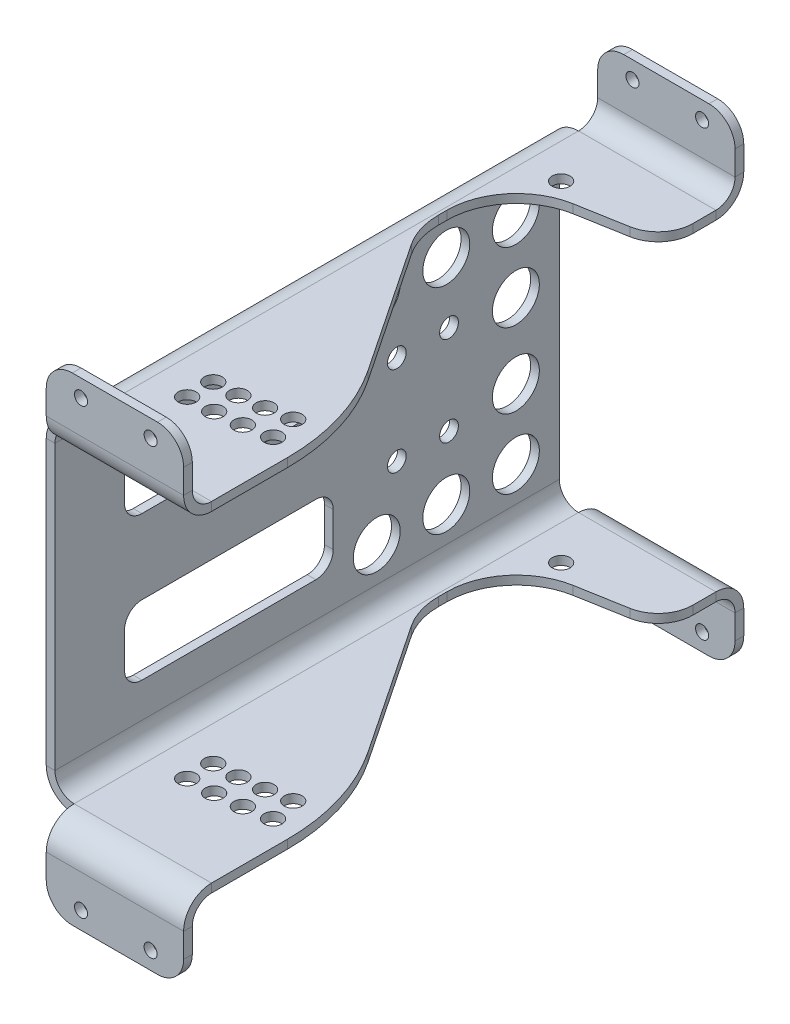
ISO-10303-21;
HEADER;
FILE_DESCRIPTION(('STEP AP214'),'2;1');
FILE_NAME('part.step','',(''),(''),'','','');
FILE_SCHEMA(('AUTOMOTIVE_DESIGN { 1 0 10303 214 1 1 1 1 }'));
ENDSEC;
DATA;
#1=APPLICATION_CONTEXT('core data for automotive mechanical design processes');
#2=APPLICATION_PROTOCOL_DEFINITION('international standard','automotive_design',2000,#1);
#3=PRODUCT_CONTEXT('',#1,'mechanical');
#4=PRODUCT('Part','Part','',(#3));
#5=PRODUCT_RELATED_PRODUCT_CATEGORY('part','',(#4));
#6=PRODUCT_DEFINITION_FORMATION('','',#4);
#7=PRODUCT_DEFINITION_CONTEXT('part definition',#1,'design');
#8=PRODUCT_DEFINITION('design','',#6,#7);
#9=PRODUCT_DEFINITION_SHAPE('','',#8);
#10=(LENGTH_UNIT() NAMED_UNIT(*) SI_UNIT(.MILLI.,.METRE.));
#11=(NAMED_UNIT(*) PLANE_ANGLE_UNIT() SI_UNIT($,.RADIAN.));
#12=(NAMED_UNIT(*) SI_UNIT($,.STERADIAN.) SOLID_ANGLE_UNIT());
#13=UNCERTAINTY_MEASURE_WITH_UNIT(LENGTH_MEASURE(1.E-05),#10,'distance_accuracy_value','');
#14=(GEOMETRIC_REPRESENTATION_CONTEXT(3) GLOBAL_UNCERTAINTY_ASSIGNED_CONTEXT((#13)) GLOBAL_UNIT_ASSIGNED_CONTEXT((#10,
#11,#12)) REPRESENTATION_CONTEXT('',''));
#15=CARTESIAN_POINT('',(0.,0.,0.));
#16=DIRECTION('',(0.,0.,1.));
#17=DIRECTION('',(1.,0.,0.));
#18=AXIS2_PLACEMENT_3D('',#15,#16,#17);
#19=CARTESIAN_POINT('',(57.15,-58.7375,184.15));
#20=DIRECTION('',(1.,0.,0.));
#21=DIRECTION('',(0.,0.,-1.));
#22=AXIS2_PLACEMENT_3D('',#19,#20,#21);
#23=PLANE('',#22);
#24=DIRECTION('',(0.,0.,-1.));
#25=VECTOR('',#24,1.);
#26=CARTESIAN_POINT('',(57.15,-61.9125,184.15));
#27=LINE('',#26,#25);
#28=CARTESIAN_POINT('',(57.15,-61.9125,184.15));
#29=VERTEX_POINT('',#28);
#30=CARTESIAN_POINT('',(57.15,-61.9125,156.486290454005));
#31=VERTEX_POINT('',#30);
#32=EDGE_CURVE('E969',#29,#31,#27,.T.);
#33=ORIENTED_EDGE('',*,*,#32,.T.);
#34=DIRECTION('',(0.,1.,0.));
#35=VECTOR('',#34,1.);
#36=CARTESIAN_POINT('',(57.15,-58.7375,156.486290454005));
#37=LINE('',#36,#35);
#38=CARTESIAN_POINT('',(57.15,-58.7375,156.486290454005));
#39=VERTEX_POINT('',#38);
#40=EDGE_CURVE('E1083',#31,#39,#37,.T.);
#41=ORIENTED_EDGE('',*,*,#40,.T.);
#42=DIRECTION('',(0.,0.,-1.));
#43=VECTOR('',#42,1.);
#44=CARTESIAN_POINT('',(57.15,-58.7375,184.15));
#45=LINE('',#44,#43);
#46=CARTESIAN_POINT('',(57.15,-58.7375,184.15));
#47=VERTEX_POINT('',#46);
#48=EDGE_CURVE('E965',#47,#39,#45,.T.);
#49=ORIENTED_EDGE('',*,*,#48,.F.);
#50=DIRECTION('',(0.,-1.,0.));
#51=VECTOR('',#50,1.);
#52=CARTESIAN_POINT('',(57.15,-58.7375,184.15));
#53=LINE('',#52,#51);
#54=EDGE_CURVE('E869',#47,#29,#53,.T.);
#55=ORIENTED_EDGE('',*,*,#54,.T.);
#56=EDGE_LOOP('',(#33,#41,#49,#55));
#57=FACE_BOUND('',#56,.T.);
#58=ADVANCED_FACE('F166',(#57),#23,.T.);
#59=CARTESIAN_POINT('',(57.15,61.9125,184.15));
#60=DIRECTION('',(1.,0.,0.));
#61=DIRECTION('',(0.,0.,-1.));
#62=AXIS2_PLACEMENT_3D('',#59,#60,#61);
#63=PLANE('',#62);
#64=DIRECTION('',(0.,0.,-1.));
#65=VECTOR('',#64,1.);
#66=CARTESIAN_POINT('',(57.15,58.7375,184.15));
#67=LINE('',#66,#65);
#68=CARTESIAN_POINT('',(57.15,58.7375,184.15));
#69=VERTEX_POINT('',#68);
#70=CARTESIAN_POINT('',(57.15,58.7375,156.486290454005));
#71=VERTEX_POINT('',#70);
#72=EDGE_CURVE('E950',#69,#71,#67,.T.);
#73=ORIENTED_EDGE('',*,*,#72,.T.);
#74=DIRECTION('',(0.,1.,0.));
#75=VECTOR('',#74,1.);
#76=CARTESIAN_POINT('',(57.15,61.9125,156.486290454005));
#77=LINE('',#76,#75);
#78=CARTESIAN_POINT('',(57.15,61.9125,156.486290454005));
#79=VERTEX_POINT('',#78);
#80=EDGE_CURVE('E1092',#71,#79,#77,.T.);
#81=ORIENTED_EDGE('',*,*,#80,.T.);
#82=DIRECTION('',(0.,0.,-1.));
#83=VECTOR('',#82,1.);
#84=CARTESIAN_POINT('',(57.15,61.9125,184.15));
#85=LINE('',#84,#83);
#86=CARTESIAN_POINT('',(57.15,61.9125,184.15));
#87=VERTEX_POINT('',#86);
#88=EDGE_CURVE('E946',#87,#79,#85,.T.);
#89=ORIENTED_EDGE('',*,*,#88,.F.);
#90=DIRECTION('',(0.,-1.,0.));
#91=VECTOR('',#90,1.);
#92=CARTESIAN_POINT('',(57.15,61.9125,184.15));
#93=LINE('',#92,#91);
#94=EDGE_CURVE('E886',#87,#69,#93,.T.);
#95=ORIENTED_EDGE('',*,*,#94,.T.);
#96=EDGE_LOOP('',(#73,#81,#89,#95));
#97=FACE_BOUND('',#96,.T.);
#98=ADVANCED_FACE('F1226',(#97),#63,.T.);
#99=CARTESIAN_POINT('',(0.,51.7375,184.15));
#100=DIRECTION('',(0.,0.,1.));
#101=DIRECTION('',(1.,0.,0.));
#102=AXIS2_PLACEMENT_3D('',#99,#100,#101);
#103=PLANE('',#102);
#104=DIRECTION('',(-1.,0.,0.));
#105=VECTOR('',#104,1.);
#106=CARTESIAN_POINT('',(0.,51.7375,184.15));
#107=LINE('',#106,#105);
#108=CARTESIAN_POINT('',(0.,51.7375,184.15));
#109=VERTEX_POINT('',#108);
#110=CARTESIAN_POINT('',(-3.17500000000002,51.7375,184.15));
#111=VERTEX_POINT('',#110);
#112=EDGE_CURVE('E989',#109,#111,#107,.T.);
#113=ORIENTED_EDGE('',*,*,#112,.F.);
#114=CARTESIAN_POINT('',(6.99999999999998,51.7375,184.15));
#115=DIRECTION('',(0.,0.,-1.));
#116=DIRECTION('',(-1.,0.,0.));
#117=AXIS2_PLACEMENT_3D('',#114,#115,#116);
#118=CIRCLE('',#117,7.);
#119=CARTESIAN_POINT('',(6.99999999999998,58.7375,184.15));
#120=VERTEX_POINT('',#119);
#121=EDGE_CURVE('E882',#120,#109,#118,.F.);
#122=ORIENTED_EDGE('',*,*,#121,.F.);
#123=DIRECTION('',(0.,-1.,0.));
#124=VECTOR('',#123,1.);
#125=CARTESIAN_POINT('',(6.99999999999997,61.9125,184.15));
#126=LINE('',#125,#124);
#127=CARTESIAN_POINT('',(6.99999999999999,61.9125,184.15));
#128=VERTEX_POINT('',#127);
#129=EDGE_CURVE('E986',#128,#120,#126,.T.);
#130=ORIENTED_EDGE('',*,*,#129,.F.);
#131=CARTESIAN_POINT('',(6.99999999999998,51.7375,184.15));
#132=DIRECTION('',(0.,0.,1.));
#133=DIRECTION('',(1.,0.,0.));
#134=AXIS2_PLACEMENT_3D('',#131,#132,#133);
#135=CIRCLE('',#134,10.175);
#136=EDGE_CURVE('E891',#128,#111,#135,.T.);
#137=ORIENTED_EDGE('',*,*,#136,.T.);
#138=EDGE_LOOP('',(#113,#122,#130,#137));
#139=FACE_BOUND('',#138,.T.);
#140=ADVANCED_FACE('F1233',(#139),#103,.T.);
#141=CARTESIAN_POINT('',(6.99999999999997,61.9125,184.15));
#142=DIRECTION('',(0.,0.,1.));
#143=DIRECTION('',(1.,0.,0.));
#144=AXIS2_PLACEMENT_3D('',#141,#142,#143);
#145=PLANE('',#144);
#146=DIRECTION('',(0.,-1.,0.));
#147=VECTOR('',#146,1.);
#148=CARTESIAN_POINT('',(0.,-58.7375,184.15));
#149=LINE('',#148,#147);
#150=CARTESIAN_POINT('',(0.,-51.7375,184.15));
#151=VERTEX_POINT('',#150);
#152=EDGE_CURVE('E879',#109,#151,#149,.T.);
#153=ORIENTED_EDGE('',*,*,#152,.F.);
#154=ORIENTED_EDGE('',*,*,#112,.T.);
#155=DIRECTION('',(0.,-1.,0.));
#156=VECTOR('',#155,1.);
#157=CARTESIAN_POINT('',(-3.175,-58.7375,184.15));
#158=LINE('',#157,#156);
#159=CARTESIAN_POINT('',(-3.175,-51.7375,184.15));
#160=VERTEX_POINT('',#159);
#161=EDGE_CURVE('E894',#111,#160,#158,.T.);
#162=ORIENTED_EDGE('',*,*,#161,.T.);
#163=DIRECTION('',(1.,0.,0.));
#164=VECTOR('',#163,1.);
#165=CARTESIAN_POINT('',(-3.175,-51.7375,184.15));
#166=LINE('',#165,#164);
#167=EDGE_CURVE('E977',#160,#151,#166,.T.);
#168=ORIENTED_EDGE('',*,*,#167,.T.);
#169=EDGE_LOOP('',(#153,#154,#162,#168));
#170=FACE_BOUND('',#169,.T.);
#171=ADVANCED_FACE('F2538',(#170),#145,.T.);
#172=CARTESIAN_POINT('',(6.99999999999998,58.7375,0.));
#173=DIRECTION('',(0.,0.,-1.));
#174=DIRECTION('',(-1.,0.,0.));
#175=AXIS2_PLACEMENT_3D('',#172,#173,#174);
#176=PLANE('',#175);
#177=DIRECTION('',(0.,1.,0.));
#178=VECTOR('',#177,1.);
#179=CARTESIAN_POINT('',(6.99999999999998,58.7375,0.));
#180=LINE('',#179,#178);
#181=CARTESIAN_POINT('',(6.99999999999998,58.7374999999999,0.));
#182=VERTEX_POINT('',#181);
#183=CARTESIAN_POINT('',(6.99999999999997,61.9125,0.));
#184=VERTEX_POINT('',#183);
#185=EDGE_CURVE('E983',#182,#184,#180,.T.);
#186=ORIENTED_EDGE('',*,*,#185,.F.);
#187=CARTESIAN_POINT('',(6.99999999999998,51.7375,0.));
#188=DIRECTION('',(0.,0.,-1.));
#189=DIRECTION('',(-1.,0.,0.));
#190=AXIS2_PLACEMENT_3D('',#187,#188,#189);
#191=CIRCLE('',#190,7.);
#192=CARTESIAN_POINT('',(0.,51.7375,0.));
#193=VERTEX_POINT('',#192);
#194=EDGE_CURVE('E915',#182,#193,#191,.F.);
#195=ORIENTED_EDGE('',*,*,#194,.T.);
#196=DIRECTION('',(1.,0.,0.));
#197=VECTOR('',#196,1.);
#198=CARTESIAN_POINT('',(-3.17500000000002,51.7375,0.));
#199=LINE('',#198,#197);
#200=CARTESIAN_POINT('',(-3.17500000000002,51.7375,0.));
#201=VERTEX_POINT('',#200);
#202=EDGE_CURVE('E981',#201,#193,#199,.T.);
#203=ORIENTED_EDGE('',*,*,#202,.F.);
#204=CARTESIAN_POINT('',(6.99999999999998,51.7375,0.));
#205=DIRECTION('',(0.,0.,1.));
#206=DIRECTION('',(1.,0.,0.));
#207=AXIS2_PLACEMENT_3D('',#204,#205,#206);
#208=CIRCLE('',#207,10.175);
#209=EDGE_CURVE('E926',#184,#201,#208,.T.);
#210=ORIENTED_EDGE('',*,*,#209,.F.);
#211=EDGE_LOOP('',(#186,#195,#203,#210));
#212=FACE_BOUND('',#211,.T.);
#213=ADVANCED_FACE('F1725',(#212),#176,.T.);
#214=CARTESIAN_POINT('',(7.,-58.7375,184.15));
#215=DIRECTION('',(0.,0.,1.));
#216=DIRECTION('',(1.,0.,0.));
#217=AXIS2_PLACEMENT_3D('',#214,#215,#216);
#218=PLANE('',#217);
#219=DIRECTION('',(0.,-1.,0.));
#220=VECTOR('',#219,1.);
#221=CARTESIAN_POINT('',(7.,-58.7375,184.15));
#222=LINE('',#221,#220);
#223=CARTESIAN_POINT('',(7.,-58.7375,184.15));
#224=VERTEX_POINT('',#223);
#225=CARTESIAN_POINT('',(7.,-61.9125,184.15));
#226=VERTEX_POINT('',#225);
#227=EDGE_CURVE('E979',#224,#226,#222,.T.);
#228=ORIENTED_EDGE('',*,*,#227,.F.);
#229=CARTESIAN_POINT('',(7.,-51.7375,184.15));
#230=DIRECTION('',(0.,0.,-1.));
#231=DIRECTION('',(-1.,0.,0.));
#232=AXIS2_PLACEMENT_3D('',#229,#230,#231);
#233=CIRCLE('',#232,7.);
#234=EDGE_CURVE('E876',#151,#224,#233,.F.);
#235=ORIENTED_EDGE('',*,*,#234,.F.);
#236=ORIENTED_EDGE('',*,*,#167,.F.);
#237=CARTESIAN_POINT('',(7.,-51.7375,184.15));
#238=DIRECTION('',(0.,0.,1.));
#239=DIRECTION('',(1.,0.,0.));
#240=AXIS2_PLACEMENT_3D('',#237,#238,#239);
#241=CIRCLE('',#240,10.175);
#242=EDGE_CURVE('E897',#160,#226,#241,.T.);
#243=ORIENTED_EDGE('',*,*,#242,.T.);
#244=EDGE_LOOP('',(#228,#235,#236,#243));
#245=FACE_BOUND('',#244,.T.);
#246=ADVANCED_FACE('F1303',(#245),#218,.T.);
#247=CARTESIAN_POINT('',(0.,-51.7375,0.));
#248=DIRECTION('',(0.,0.,-1.));
#249=DIRECTION('',(-1.,0.,0.));
#250=AXIS2_PLACEMENT_3D('',#247,#248,#249);
#251=PLANE('',#250);
#252=DIRECTION('',(-1.,0.,0.));
#253=VECTOR('',#252,1.);
#254=CARTESIAN_POINT('',(0.,-51.7375,0.));
#255=LINE('',#254,#253);
#256=CARTESIAN_POINT('',(0.,-51.7375,0.));
#257=VERTEX_POINT('',#256);
#258=CARTESIAN_POINT('',(-3.175,-51.7375,0.));
#259=VERTEX_POINT('',#258);
#260=EDGE_CURVE('E975',#257,#259,#255,.T.);
#261=ORIENTED_EDGE('',*,*,#260,.F.);
#262=CARTESIAN_POINT('',(7.,-51.7375,0.));
#263=DIRECTION('',(0.,0.,-1.));
#264=DIRECTION('',(-1.,0.,0.));
#265=AXIS2_PLACEMENT_3D('',#262,#263,#264);
#266=CIRCLE('',#265,7.);
#267=CARTESIAN_POINT('',(7.,-58.7375,0.));
#268=VERTEX_POINT('',#267);
#269=EDGE_CURVE('E909',#257,#268,#266,.F.);
#270=ORIENTED_EDGE('',*,*,#269,.T.);
#271=DIRECTION('',(0.,1.,0.));
#272=VECTOR('',#271,1.);
#273=CARTESIAN_POINT('',(7.,-61.9125,0.));
#274=LINE('',#273,#272);
#275=CARTESIAN_POINT('',(7.,-61.9125,0.));
#276=VERTEX_POINT('',#275);
#277=EDGE_CURVE('E972',#276,#268,#274,.T.);
#278=ORIENTED_EDGE('',*,*,#277,.F.);
#279=CARTESIAN_POINT('',(7.,-51.7375,0.));
#280=DIRECTION('',(0.,0.,1.));
#281=DIRECTION('',(1.,0.,0.));
#282=AXIS2_PLACEMENT_3D('',#279,#280,#281);
#283=CIRCLE('',#282,10.175);
#284=EDGE_CURVE('E870',#259,#276,#283,.T.);
#285=ORIENTED_EDGE('',*,*,#284,.F.);
#286=EDGE_LOOP('',(#261,#270,#278,#285));
#287=FACE_BOUND('',#286,.T.);
#288=ADVANCED_FACE('F2530',(#287),#251,.T.);
#289=CARTESIAN_POINT('',(7.,-61.9125,0.));
#290=DIRECTION('',(0.,0.,-1.));
#291=DIRECTION('',(-1.,0.,0.));
#292=AXIS2_PLACEMENT_3D('',#289,#290,#291);
#293=PLANE('',#292);
#294=DIRECTION('',(0.,-1.,0.));
#295=VECTOR('',#294,1.);
#296=CARTESIAN_POINT('',(0.,-58.7375,0.));
#297=LINE('',#296,#295);
#298=EDGE_CURVE('E912',#193,#257,#297,.T.);
#299=ORIENTED_EDGE('',*,*,#298,.T.);
#300=ORIENTED_EDGE('',*,*,#260,.T.);
#301=DIRECTION('',(0.,-1.,0.));
#302=VECTOR('',#301,1.);
#303=CARTESIAN_POINT('',(-3.175,-58.7375,0.));
#304=LINE('',#303,#302);
#305=EDGE_CURVE('E929',#201,#259,#304,.T.);
#306=ORIENTED_EDGE('',*,*,#305,.F.);
#307=ORIENTED_EDGE('',*,*,#202,.T.);
#308=EDGE_LOOP('',(#299,#300,#306,#307));
#309=FACE_BOUND('',#308,.T.);
#310=ADVANCED_FACE('F1249',(#309),#293,.T.);
#311=CARTESIAN_POINT('',(0.,-61.9125,184.15));
#312=DIRECTION('',(0.,1.,0.));
#313=DIRECTION('',(0.,0.,1.));
#314=AXIS2_PLACEMENT_3D('',#311,#312,#313);
#315=PLANE('',#314);
#316=CARTESIAN_POINT('',(48.0851435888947,-61.9125,152.591601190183));
#317=DIRECTION('',(0.,1.,0.));
#318=DIRECTION('',(0.,0.,1.));
#319=AXIS2_PLACEMENT_3D('',#316,#317,#318);
#320=CIRCLE('',#319,3.2639);
#321=CARTESIAN_POINT('',(48.0851435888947,-61.9125,155.855501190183));
#322=VERTEX_POINT('',#321);
#323=EDGE_CURVE('E1577',#322,#322,#320,.T.);
#324=ORIENTED_EDGE('',*,*,#323,.T.);
#325=EDGE_LOOP('',(#324));
#326=FACE_BOUND('',#325,.T.);
#327=CARTESIAN_POINT('',(46.1047847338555,-61.9125,143.274745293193));
#328=DIRECTION('',(0.,1.,0.));
#329=DIRECTION('',(0.,0.,1.));
#330=AXIS2_PLACEMENT_3D('',#327,#328,#329);
#331=CIRCLE('',#330,3.2639);
#332=CARTESIAN_POINT('',(46.1047847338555,-61.9125,146.538645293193));
#333=VERTEX_POINT('',#332);
#334=EDGE_CURVE('E1565',#333,#333,#331,.T.);
#335=ORIENTED_EDGE('',*,*,#334,.T.);
#336=EDGE_LOOP('',(#335));
#337=FACE_BOUND('',#336,.T.);
#338=CARTESIAN_POINT('',(38.700607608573,-61.9125,154.246348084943));
#339=DIRECTION('',(0.,1.,0.));
#340=DIRECTION('',(0.,0.,1.));
#341=AXIS2_PLACEMENT_3D('',#338,#339,#340);
#342=CIRCLE('',#341,3.2639);
#343=CARTESIAN_POINT('',(38.700607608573,-61.9125,157.510248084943));
#344=VERTEX_POINT('',#343);
#345=EDGE_CURVE('E1553',#344,#344,#342,.T.);
#346=ORIENTED_EDGE('',*,*,#345,.T.);
#347=EDGE_LOOP('',(#346));
#348=FACE_BOUND('',#347,.T.);
#349=CARTESIAN_POINT('',(37.3749838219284,-61.9125,144.814044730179));
#350=DIRECTION('',(0.,1.,0.));
#351=DIRECTION('',(0.,0.,1.));
#352=AXIS2_PLACEMENT_3D('',#349,#350,#351);
#353=CIRCLE('',#352,3.2639);
#354=CARTESIAN_POINT('',(37.3749838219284,-61.9125,148.077944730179));
#355=VERTEX_POINT('',#354);
#356=EDGE_CURVE('E1541',#355,#355,#353,.T.);
#357=ORIENTED_EDGE('',*,*,#356,.T.);
#358=EDGE_LOOP('',(#357));
#359=FACE_BOUND('',#358,.T.);
#360=CARTESIAN_POINT('',(29.2235025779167,-61.9125,155.242431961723));
#361=DIRECTION('',(0.,1.,0.));
#362=DIRECTION('',(0.,0.,1.));
#363=AXIS2_PLACEMENT_3D('',#360,#361,#362);
#364=CIRCLE('',#363,3.2639);
#365=CARTESIAN_POINT('',(29.2235025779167,-61.9125,158.506331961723));
#366=VERTEX_POINT('',#365);
#367=EDGE_CURVE('E1529',#366,#366,#364,.T.);
#368=ORIENTED_EDGE('',*,*,#367,.T.);
#369=EDGE_LOOP('',(#368));
#370=FACE_BOUND('',#369,.T.);
#371=CARTESIAN_POINT('',(28.5590721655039,-61.9125,145.740634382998));
#372=DIRECTION('',(0.,1.,0.));
#373=DIRECTION('',(0.,0.,1.));
#374=AXIS2_PLACEMENT_3D('',#371,#372,#373);
#375=CIRCLE('',#374,3.2639);
#376=CARTESIAN_POINT('',(28.5590721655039,-61.9125,149.004534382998));
#377=VERTEX_POINT('',#376);
#378=EDGE_CURVE('E1515',#377,#377,#375,.T.);
#379=ORIENTED_EDGE('',*,*,#378,.T.);
#380=EDGE_LOOP('',(#379));
#381=FACE_BOUND('',#380,.T.);
#382=CARTESIAN_POINT('',(19.7,-61.9125,146.05));
#383=DIRECTION('',(0.,1.,0.));
#384=DIRECTION('',(-1.,0.,0.));
#385=AXIS2_PLACEMENT_3D('',#382,#383,#384);
#386=CIRCLE('',#385,3.2639);
#387=CARTESIAN_POINT('',(16.4361,-61.9125,146.05));
#388=VERTEX_POINT('',#387);
#389=EDGE_CURVE('E830',#388,#388,#386,.T.);
#390=ORIENTED_EDGE('',*,*,#389,.T.);
#391=EDGE_LOOP('',(#390));
#392=FACE_BOUND('',#391,.T.);
#393=CARTESIAN_POINT('',(19.7,-61.9125,19.05));
#394=DIRECTION('',(0.,1.,0.));
#395=DIRECTION('',(-1.,0.,0.));
#396=AXIS2_PLACEMENT_3D('',#393,#394,#395);
#397=CIRCLE('',#396,3.2639);
#398=CARTESIAN_POINT('',(16.4361,-61.9125,19.05));
#399=VERTEX_POINT('',#398);
#400=EDGE_CURVE('E842',#399,#399,#397,.T.);
#401=ORIENTED_EDGE('',*,*,#400,.T.);
#402=EDGE_LOOP('',(#401));
#403=FACE_BOUND('',#402,.T.);
#404=CARTESIAN_POINT('',(19.7,-61.9125,155.575));
#405=DIRECTION('',(0.,1.,0.));
#406=DIRECTION('',(-1.,0.,0.));
#407=AXIS2_PLACEMENT_3D('',#404,#405,#406);
#408=CIRCLE('',#407,3.2639);
#409=CARTESIAN_POINT('',(16.4361,-61.9125,155.575));
#410=VERTEX_POINT('',#409);
#411=EDGE_CURVE('E855',#410,#410,#408,.T.);
#412=ORIENTED_EDGE('',*,*,#411,.T.);
#413=EDGE_LOOP('',(#412));
#414=FACE_BOUND('',#413,.T.);
#415=CARTESIAN_POINT('',(57.15,-61.9125,8.39879843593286));
#416=VERTEX_POINT('',#415);
#417=CARTESIAN_POINT('',(57.15,-61.9125,0.));
#418=VERTEX_POINT('',#417);
#419=EDGE_CURVE('E968',#416,#418,#27,.T.);
#420=ORIENTED_EDGE('',*,*,#419,.F.);
#421=CARTESIAN_POINT('',(44.45,-61.9125,8.39879843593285));
#422=DIRECTION('',(0.,1.,0.));
#423=DIRECTION('',(0.,0.,1.));
#424=AXIS2_PLACEMENT_3D('',#421,#422,#423);
#425=CIRCLE('',#424,12.7);
#426=CARTESIAN_POINT('',(46.6615323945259,-61.9125,20.9047619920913));
#427=VERTEX_POINT('',#426);
#428=EDGE_CURVE('E1108',#416,#427,#425,.F.);
#429=ORIENTED_EDGE('',*,*,#428,.T.);
#430=DIRECTION('',(-0.984721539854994,0.,0.174136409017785));
#431=VECTOR('',#430,1.);
#432=CARTESIAN_POINT('',(57.15,-61.9125,19.05));
#433=LINE('',#432,#431);
#434=CARTESIAN_POINT('',(29.0115819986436,-61.9125,24.0259478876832));
#435=VERTEX_POINT('',#434);
#436=EDGE_CURVE('E765',#427,#435,#433,.T.);
#437=ORIENTED_EDGE('',*,*,#436,.T.);
#438=CARTESIAN_POINT('',(33.4346467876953,-61.9125,49.037875));
#439=DIRECTION('',(0.,1.,0.));
#440=DIRECTION('',(-1.,0.,0.));
#441=AXIS2_PLACEMENT_3D('',#438,#439,#440);
#442=CIRCLE('',#441,25.4);
#443=CARTESIAN_POINT('',(8.03464678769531,-61.9125,49.037875));
#444=VERTEX_POINT('',#443);
#445=EDGE_CURVE('E767',#435,#444,#442,.T.);
#446=ORIENTED_EDGE('',*,*,#445,.T.);
#447=DIRECTION('',(0.,0.,1.));
#448=VECTOR('',#447,1.);
#449=CARTESIAN_POINT('',(8.03464678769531,-61.9125,49.037875));
#450=LINE('',#449,#448);
#451=CARTESIAN_POINT('',(8.03464678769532,-61.9125,52.212875));
#452=VERTEX_POINT('',#451);
#453=EDGE_CURVE('E771',#444,#452,#450,.T.);
#454=ORIENTED_EDGE('',*,*,#453,.T.);
#455=CARTESIAN_POINT('',(33.4346467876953,-61.9125,52.212875));
#456=DIRECTION('',(0.,1.,0.));
#457=DIRECTION('',(1.,0.,0.));
#458=AXIS2_PLACEMENT_3D('',#455,#456,#457);
#459=CIRCLE('',#458,25.4);
#460=CARTESIAN_POINT('',(12.3225360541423,-61.9125,66.3351545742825));
#461=VERTEX_POINT('',#460);
#462=EDGE_CURVE('E774',#452,#461,#459,.T.);
#463=ORIENTED_EDGE('',*,*,#462,.T.);
#464=DIRECTION('',(0.555995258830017,0.,0.831185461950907));
#465=VECTOR('',#464,1.);
#466=CARTESIAN_POINT('',(12.3225360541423,-61.9125,66.3351545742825));
#467=LINE('',#466,#465);
#468=CARTESIAN_POINT('',(44.2863322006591,-61.9125,114.119451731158));
#469=VERTEX_POINT('',#468);
#470=EDGE_CURVE('E777',#461,#469,#467,.T.);
#471=ORIENTED_EDGE('',*,*,#470,.T.);
#472=CARTESIAN_POINT('',(-19.05,-61.9125,156.486290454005));
#473=DIRECTION('',(0.,1.,0.));
#474=DIRECTION('',(0.,0.,1.));
#475=AXIS2_PLACEMENT_3D('',#472,#473,#474);
#476=CIRCLE('',#475,76.2);
#477=EDGE_CURVE('E1090',#469,#31,#476,.F.);
#478=ORIENTED_EDGE('',*,*,#477,.T.);
#479=ORIENTED_EDGE('',*,*,#32,.F.);
#480=DIRECTION('',(1.,0.,0.));
#481=VECTOR('',#480,1.);
#482=CARTESIAN_POINT('',(0.,-61.9125,184.15));
#483=LINE('',#482,#481);
#484=EDGE_CURVE('E867',#226,#29,#483,.T.);
#485=ORIENTED_EDGE('',*,*,#484,.F.);
#486=DIRECTION('',(0.,0.,-1.));
#487=VECTOR('',#486,1.);
#488=CARTESIAN_POINT('',(7.,-61.9125,184.15));
#489=LINE('',#488,#487);
#490=EDGE_CURVE('E900',#226,#276,#489,.T.);
#491=ORIENTED_EDGE('',*,*,#490,.T.);
#492=DIRECTION('',(1.,0.,0.));
#493=VECTOR('',#492,1.);
#494=CARTESIAN_POINT('',(0.,-61.9125,0.));
#495=LINE('',#494,#493);
#496=EDGE_CURVE('E866',#276,#418,#495,.T.);
#497=ORIENTED_EDGE('',*,*,#496,.T.);
#498=EDGE_LOOP('',(#420,#429,#437,#446,#454,#463,#471,#478,#479,#485,#491,#497));
#499=FACE_BOUND('',#498,.T.);
#500=ADVANCED_FACE('F1241',(#326,#337,#348,#359,#370,#381,#392,#403,#414,#499),#315,.F.);
#501=CARTESIAN_POINT('',(57.15,-58.7375,8.39879843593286));
#502=VERTEX_POINT('',#501);
#503=CARTESIAN_POINT('',(57.15,-58.7375,0.));
#504=VERTEX_POINT('',#503);
#505=EDGE_CURVE('E964',#502,#504,#45,.T.);
#506=ORIENTED_EDGE('',*,*,#505,.F.);
#507=DIRECTION('',(0.,1.,0.));
#508=VECTOR('',#507,1.);
#509=CARTESIAN_POINT('',(57.15,-61.9125,8.39879843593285));
#510=LINE('',#509,#508);
#511=EDGE_CURVE('E1106',#502,#416,#510,.F.);
#512=ORIENTED_EDGE('',*,*,#511,.T.);
#513=ORIENTED_EDGE('',*,*,#419,.T.);
#514=DIRECTION('',(0.,-1.,0.));
#515=VECTOR('',#514,1.);
#516=CARTESIAN_POINT('',(57.15,-58.7375,0.));
#517=LINE('',#516,#515);
#518=EDGE_CURVE('E903',#504,#418,#517,.T.);
#519=ORIENTED_EDGE('',*,*,#518,.F.);
#520=EDGE_LOOP('',(#506,#512,#513,#519));
#521=FACE_BOUND('',#520,.T.);
#522=ADVANCED_FACE('F1229',(#521),#23,.T.);
#523=CARTESIAN_POINT('',(0.,-58.7375,184.15));
#524=DIRECTION('',(0.,1.,0.));
#525=DIRECTION('',(0.,0.,1.));
#526=AXIS2_PLACEMENT_3D('',#523,#524,#525);
#527=PLANE('',#526);
#528=CARTESIAN_POINT('',(48.0851435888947,-58.7375,152.591601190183));
#529=DIRECTION('',(0.,1.,0.));
#530=DIRECTION('',(0.,0.,1.));
#531=AXIS2_PLACEMENT_3D('',#528,#529,#530);
#532=CIRCLE('',#531,3.2639);
#533=CARTESIAN_POINT('',(48.0851435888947,-58.7375,155.855501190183));
#534=VERTEX_POINT('',#533);
#535=EDGE_CURVE('E1580',#534,#534,#532,.T.);
#536=ORIENTED_EDGE('',*,*,#535,.F.);
#537=EDGE_LOOP('',(#536));
#538=FACE_BOUND('',#537,.T.);
#539=CARTESIAN_POINT('',(46.1047847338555,-58.7375,143.274745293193));
#540=DIRECTION('',(0.,1.,0.));
#541=DIRECTION('',(0.,0.,1.));
#542=AXIS2_PLACEMENT_3D('',#539,#540,#541);
#543=CIRCLE('',#542,3.2639);
#544=CARTESIAN_POINT('',(46.1047847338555,-58.7375,146.538645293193));
#545=VERTEX_POINT('',#544);
#546=EDGE_CURVE('E1568',#545,#545,#543,.T.);
#547=ORIENTED_EDGE('',*,*,#546,.F.);
#548=EDGE_LOOP('',(#547));
#549=FACE_BOUND('',#548,.T.);
#550=CARTESIAN_POINT('',(38.700607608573,-58.7375,154.246348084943));
#551=DIRECTION('',(0.,1.,0.));
#552=DIRECTION('',(0.,0.,1.));
#553=AXIS2_PLACEMENT_3D('',#550,#551,#552);
#554=CIRCLE('',#553,3.2639);
#555=CARTESIAN_POINT('',(38.700607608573,-58.7375,157.510248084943));
#556=VERTEX_POINT('',#555);
#557=EDGE_CURVE('E1556',#556,#556,#554,.T.);
#558=ORIENTED_EDGE('',*,*,#557,.F.);
#559=EDGE_LOOP('',(#558));
#560=FACE_BOUND('',#559,.T.);
#561=CARTESIAN_POINT('',(37.3749838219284,-58.7375,144.814044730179));
#562=DIRECTION('',(0.,1.,0.));
#563=DIRECTION('',(0.,0.,1.));
#564=AXIS2_PLACEMENT_3D('',#561,#562,#563);
#565=CIRCLE('',#564,3.2639);
#566=CARTESIAN_POINT('',(37.3749838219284,-58.7375,148.077944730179));
#567=VERTEX_POINT('',#566);
#568=EDGE_CURVE('E1544',#567,#567,#565,.T.);
#569=ORIENTED_EDGE('',*,*,#568,.F.);
#570=EDGE_LOOP('',(#569));
#571=FACE_BOUND('',#570,.T.);
#572=CARTESIAN_POINT('',(29.2235025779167,-58.7375,155.242431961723));
#573=DIRECTION('',(0.,1.,0.));
#574=DIRECTION('',(0.,0.,1.));
#575=AXIS2_PLACEMENT_3D('',#572,#573,#574);
#576=CIRCLE('',#575,3.2639);
#577=CARTESIAN_POINT('',(29.2235025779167,-58.7375,158.506331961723));
#578=VERTEX_POINT('',#577);
#579=EDGE_CURVE('E1532',#578,#578,#576,.T.);
#580=ORIENTED_EDGE('',*,*,#579,.F.);
#581=EDGE_LOOP('',(#580));
#582=FACE_BOUND('',#581,.T.);
#583=CARTESIAN_POINT('',(28.5590721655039,-58.7375,145.740634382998));
#584=DIRECTION('',(0.,1.,0.));
#585=DIRECTION('',(0.,0.,1.));
#586=AXIS2_PLACEMENT_3D('',#583,#584,#585);
#587=CIRCLE('',#586,3.2639);
#588=CARTESIAN_POINT('',(28.5590721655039,-58.7375,149.004534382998));
#589=VERTEX_POINT('',#588);
#590=EDGE_CURVE('E1520',#589,#589,#587,.T.);
#591=ORIENTED_EDGE('',*,*,#590,.F.);
#592=EDGE_LOOP('',(#591));
#593=FACE_BOUND('',#592,.T.);
#594=DIRECTION('',(-0.984721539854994,0.,0.174136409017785));
#595=VECTOR('',#594,1.);
#596=CARTESIAN_POINT('',(-26.5776792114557,-58.7375,33.8562541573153));
#597=LINE('',#596,#595);
#598=CARTESIAN_POINT('',(46.6615323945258,-58.7375,20.9047619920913));
#599=VERTEX_POINT('',#598);
#600=CARTESIAN_POINT('',(29.0115819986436,-58.7375,24.0259478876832));
#601=VERTEX_POINT('',#600);
#602=EDGE_CURVE('E811',#599,#601,#597,.T.);
#603=ORIENTED_EDGE('',*,*,#602,.F.);
#604=CARTESIAN_POINT('',(44.45,-58.7375,8.39879843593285));
#605=DIRECTION('',(0.,1.,0.));
#606=DIRECTION('',(0.,0.,1.));
#607=AXIS2_PLACEMENT_3D('',#604,#605,#606);
#608=CIRCLE('',#607,12.7);
#609=EDGE_CURVE('E1104',#599,#502,#608,.T.);
#610=ORIENTED_EDGE('',*,*,#609,.T.);
#611=ORIENTED_EDGE('',*,*,#505,.T.);
#612=DIRECTION('',(1.,0.,0.));
#613=VECTOR('',#612,1.);
#614=CARTESIAN_POINT('',(0.,-58.7375,0.));
#615=LINE('',#614,#613);
#616=EDGE_CURVE('E906',#268,#504,#615,.T.);
#617=ORIENTED_EDGE('',*,*,#616,.F.);
#618=DIRECTION('',(0.,0.,-1.));
#619=VECTOR('',#618,1.);
#620=CARTESIAN_POINT('',(7.,-58.7375,184.15));
#621=LINE('',#620,#619);
#622=EDGE_CURVE('E962',#224,#268,#621,.T.);
#623=ORIENTED_EDGE('',*,*,#622,.F.);
#624=DIRECTION('',(1.,0.,0.));
#625=VECTOR('',#624,1.);
#626=CARTESIAN_POINT('',(0.,-58.7375,184.15));
#627=LINE('',#626,#625);
#628=EDGE_CURVE('E873',#224,#47,#627,.T.);
#629=ORIENTED_EDGE('',*,*,#628,.T.);
#630=ORIENTED_EDGE('',*,*,#48,.T.);
#631=CARTESIAN_POINT('',(-19.05,-58.7375,156.486290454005));
#632=DIRECTION('',(0.,1.,0.));
#633=DIRECTION('',(0.,0.,1.));
#634=AXIS2_PLACEMENT_3D('',#631,#632,#633);
#635=CIRCLE('',#634,76.2);
#636=CARTESIAN_POINT('',(44.2863322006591,-58.7375,114.119451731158));
#637=VERTEX_POINT('',#636);
#638=EDGE_CURVE('E1086',#39,#637,#635,.T.);
#639=ORIENTED_EDGE('',*,*,#638,.T.);
#640=DIRECTION('',(0.555995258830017,0.,0.831185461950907));
#641=VECTOR('',#640,1.);
#642=CARTESIAN_POINT('',(62.9596458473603,-58.7375,142.035133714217));
#643=LINE('',#642,#641);
#644=CARTESIAN_POINT('',(12.3225360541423,-58.7375,66.3351545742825));
#645=VERTEX_POINT('',#644);
#646=EDGE_CURVE('E827',#645,#637,#643,.T.);
#647=ORIENTED_EDGE('',*,*,#646,.F.);
#648=CARTESIAN_POINT('',(33.4346467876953,-58.7375,52.212875));
#649=DIRECTION('',(0.,1.,0.));
#650=DIRECTION('',(0.,0.,1.));
#651=AXIS2_PLACEMENT_3D('',#648,#649,#650);
#652=CIRCLE('',#651,25.4);
#653=CARTESIAN_POINT('',(8.03464678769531,-58.7375,52.212875));
#654=VERTEX_POINT('',#653);
#655=EDGE_CURVE('E823',#654,#645,#652,.T.);
#656=ORIENTED_EDGE('',*,*,#655,.F.);
#657=DIRECTION('',(0.,0.,1.));
#658=VECTOR('',#657,1.);
#659=CARTESIAN_POINT('',(8.03464678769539,-58.7375,184.15));
#660=LINE('',#659,#658);
#661=CARTESIAN_POINT('',(8.03464678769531,-58.7375,49.037875));
#662=VERTEX_POINT('',#661);
#663=EDGE_CURVE('E819',#662,#654,#660,.T.);
#664=ORIENTED_EDGE('',*,*,#663,.F.);
#665=CARTESIAN_POINT('',(33.4346467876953,-58.7375,49.037875));
#666=DIRECTION('',(0.,1.,0.));
#667=DIRECTION('',(0.,0.,1.));
#668=AXIS2_PLACEMENT_3D('',#665,#666,#667);
#669=CIRCLE('',#668,25.4);
#670=EDGE_CURVE('E815',#601,#662,#669,.T.);
#671=ORIENTED_EDGE('',*,*,#670,.F.);
#672=EDGE_LOOP('',(#603,#610,#611,#617,#623,#629,#630,#639,#647,#656,#664,#671));
#673=FACE_BOUND('',#672,.T.);
#674=CARTESIAN_POINT('',(19.7,-58.7375,146.05));
#675=DIRECTION('',(0.,1.,0.));
#676=DIRECTION('',(0.,0.,1.));
#677=AXIS2_PLACEMENT_3D('',#674,#675,#676);
#678=CIRCLE('',#677,3.2639);
#679=CARTESIAN_POINT('',(16.4361,-58.7375,146.05));
#680=VERTEX_POINT('',#679);
#681=EDGE_CURVE('E839',#680,#680,#678,.T.);
#682=ORIENTED_EDGE('',*,*,#681,.F.);
#683=EDGE_LOOP('',(#682));
#684=FACE_BOUND('',#683,.T.);
#685=CARTESIAN_POINT('',(19.7,-58.7375,19.05));
#686=DIRECTION('',(0.,1.,0.));
#687=DIRECTION('',(0.,0.,1.));
#688=AXIS2_PLACEMENT_3D('',#685,#686,#687);
#689=CIRCLE('',#688,3.2639);
#690=CARTESIAN_POINT('',(16.4361,-58.7375,19.05));
#691=VERTEX_POINT('',#690);
#692=EDGE_CURVE('E851',#691,#691,#689,.T.);
#693=ORIENTED_EDGE('',*,*,#692,.F.);
#694=EDGE_LOOP('',(#693));
#695=FACE_BOUND('',#694,.T.);
#696=CARTESIAN_POINT('',(19.7,-58.7375,155.575));
#697=DIRECTION('',(0.,1.,0.));
#698=DIRECTION('',(0.,0.,1.));
#699=AXIS2_PLACEMENT_3D('',#696,#697,#698);
#700=CIRCLE('',#699,3.2639);
#701=CARTESIAN_POINT('',(16.4361,-58.7375,155.575));
#702=VERTEX_POINT('',#701);
#703=EDGE_CURVE('E863',#702,#702,#700,.T.);
#704=ORIENTED_EDGE('',*,*,#703,.F.);
#705=EDGE_LOOP('',(#704));
#706=FACE_BOUND('',#705,.T.);
#707=ADVANCED_FACE('F1240',(#538,#549,#560,#571,#582,#593,#673,#684,#695,#706),#527,.T.);
#708=CARTESIAN_POINT('',(7.,-51.7375,184.15));
#709=DIRECTION('',(0.,0.,-1.));
#710=DIRECTION('',(-1.,0.,0.));
#711=AXIS2_PLACEMENT_3D('',#708,#709,#710);
#712=CYLINDRICAL_SURFACE('',#711,7.);
#713=ORIENTED_EDGE('',*,*,#269,.F.);
#714=DIRECTION('',(0.,0.,-1.));
#715=VECTOR('',#714,1.);
#716=CARTESIAN_POINT('',(0.,-51.7375,184.15));
#717=LINE('',#716,#715);
#718=EDGE_CURVE('E959',#151,#257,#717,.T.);
#719=ORIENTED_EDGE('',*,*,#718,.F.);
#720=ORIENTED_EDGE('',*,*,#234,.T.);
#721=ORIENTED_EDGE('',*,*,#622,.T.);
#722=EDGE_LOOP('',(#713,#719,#720,#721));
#723=FACE_BOUND('',#722,.T.);
#724=ADVANCED_FACE('F1247',(#723),#712,.F.);
#725=CARTESIAN_POINT('',(0.,-58.7375,184.15));
#726=DIRECTION('',(1.,0.,0.));
#727=DIRECTION('',(0.,1.,0.));
#728=AXIS2_PLACEMENT_3D('',#725,#726,#727);
#729=PLANE('',#728);
#730=CARTESIAN_POINT('',(0.,-13.6375,15.875));
#731=DIRECTION('',(-1.,0.,0.));
#732=DIRECTION('',(0.,-1.,0.));
#733=AXIS2_PLACEMENT_3D('',#730,#731,#732);
#734=CIRCLE('',#733,8.5725);
#735=CARTESIAN_POINT('',(0.,-22.21,15.875));
#736=VERTEX_POINT('',#735);
#737=EDGE_CURVE('E1509',#736,#736,#734,.T.);
#738=ORIENTED_EDGE('',*,*,#737,.T.);
#739=EDGE_LOOP('',(#738));
#740=FACE_BOUND('',#739,.T.);
#741=CARTESIAN_POINT('',(0.,13.6375,15.875));
#742=DIRECTION('',(-1.,0.,0.));
#743=DIRECTION('',(0.,-1.,0.));
#744=AXIS2_PLACEMENT_3D('',#741,#742,#743);
#745=CIRCLE('',#744,8.5725);
#746=CARTESIAN_POINT('',(0.,5.06499999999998,15.875));
#747=VERTEX_POINT('',#746);
#748=EDGE_CURVE('E1503',#747,#747,#745,.T.);
#749=ORIENTED_EDGE('',*,*,#748,.T.);
#750=EDGE_LOOP('',(#749));
#751=FACE_BOUND('',#750,.T.);
#752=CARTESIAN_POINT('',(0.,-39.0375,41.275));
#753=DIRECTION('',(-1.,0.,0.));
#754=DIRECTION('',(0.,1.,0.));
#755=AXIS2_PLACEMENT_3D('',#752,#753,#754);
#756=CIRCLE('',#755,8.5725);
#757=CARTESIAN_POINT('',(0.,-30.465,41.275));
#758=VERTEX_POINT('',#757);
#759=EDGE_CURVE('E1497',#758,#758,#756,.T.);
#760=ORIENTED_EDGE('',*,*,#759,.T.);
#761=EDGE_LOOP('',(#760));
#762=FACE_BOUND('',#761,.T.);
#763=CARTESIAN_POINT('',(0.,-39.0375,66.675));
#764=DIRECTION('',(-1.,0.,0.));
#765=DIRECTION('',(0.,1.,0.));
#766=AXIS2_PLACEMENT_3D('',#763,#764,#765);
#767=CIRCLE('',#766,8.5725);
#768=CARTESIAN_POINT('',(0.,-30.465,66.675));
#769=VERTEX_POINT('',#768);
#770=EDGE_CURVE('E1491',#769,#769,#767,.T.);
#771=ORIENTED_EDGE('',*,*,#770,.T.);
#772=EDGE_LOOP('',(#771));
#773=FACE_BOUND('',#772,.T.);
#774=CARTESIAN_POINT('',(0.,-39.0375,15.875));
#775=DIRECTION('',(-1.,0.,0.));
#776=DIRECTION('',(0.,1.,0.));
#777=AXIS2_PLACEMENT_3D('',#774,#775,#776);
#778=CIRCLE('',#777,8.5725);
#779=CARTESIAN_POINT('',(0.,-30.465,15.875));
#780=VERTEX_POINT('',#779);
#781=EDGE_CURVE('E1485',#780,#780,#778,.T.);
#782=ORIENTED_EDGE('',*,*,#781,.T.);
#783=EDGE_LOOP('',(#782));
#784=FACE_BOUND('',#783,.T.);
#785=CARTESIAN_POINT('',(0.,39.0375,66.675));
#786=DIRECTION('',(-1.,0.,0.));
#787=DIRECTION('',(0.,-1.,0.));
#788=AXIS2_PLACEMENT_3D('',#785,#786,#787);
#789=CIRCLE('',#788,8.5725);
#790=CARTESIAN_POINT('',(0.,30.465,66.675));
#791=VERTEX_POINT('',#790);
#792=EDGE_CURVE('E1479',#791,#791,#789,.T.);
#793=ORIENTED_EDGE('',*,*,#792,.T.);
#794=EDGE_LOOP('',(#793));
#795=FACE_BOUND('',#794,.T.);
#796=CARTESIAN_POINT('',(0.,39.0375,41.275));
#797=DIRECTION('',(-1.,0.,0.));
#798=DIRECTION('',(0.,-1.,0.));
#799=AXIS2_PLACEMENT_3D('',#796,#797,#798);
#800=CIRCLE('',#799,8.5725);
#801=CARTESIAN_POINT('',(0.,30.465,41.275));
#802=VERTEX_POINT('',#801);
#803=EDGE_CURVE('E1473',#802,#802,#800,.T.);
#804=ORIENTED_EDGE('',*,*,#803,.T.);
#805=EDGE_LOOP('',(#804));
#806=FACE_BOUND('',#805,.T.);
#807=CARTESIAN_POINT('',(0.,39.0375,15.875));
#808=DIRECTION('',(-1.,0.,0.));
#809=DIRECTION('',(0.,-1.,0.));
#810=AXIS2_PLACEMENT_3D('',#807,#808,#809);
#811=CIRCLE('',#810,8.5725);
#812=CARTESIAN_POINT('',(0.,30.465,15.875));
#813=VERTEX_POINT('',#812);
#814=EDGE_CURVE('E1459',#813,#813,#811,.T.);
#815=ORIENTED_EDGE('',*,*,#814,.T.);
#816=EDGE_LOOP('',(#815));
#817=FACE_BOUND('',#816,.T.);
#818=DIRECTION('',(0.,-1.,0.));
#819=VECTOR('',#818,1.);
#820=CARTESIAN_POINT('',(0.,-39.0375,82.55));
#821=LINE('',#820,#819);
#822=CARTESIAN_POINT('',(0.,-19.9875,82.55));
#823=VERTEX_POINT('',#822);
#824=CARTESIAN_POINT('',(0.,-32.6875,82.55));
#825=VERTEX_POINT('',#824);
#826=EDGE_CURVE('E1435',#823,#825,#821,.T.);
#827=ORIENTED_EDGE('',*,*,#826,.T.);
#828=CARTESIAN_POINT('',(0.,-32.6875,88.9));
#829=DIRECTION('',(1.,0.,0.));
#830=DIRECTION('',(0.,1.,0.));
#831=AXIS2_PLACEMENT_3D('',#828,#829,#830);
#832=CIRCLE('',#831,6.35);
#833=CARTESIAN_POINT('',(0.,-39.0375,88.9));
#834=VERTEX_POINT('',#833);
#835=EDGE_CURVE('E1081',#825,#834,#832,.F.);
#836=ORIENTED_EDGE('',*,*,#835,.T.);
#837=DIRECTION('',(0.,0.,1.));
#838=VECTOR('',#837,1.);
#839=CARTESIAN_POINT('',(0.,-39.0375,82.55));
#840=LINE('',#839,#838);
#841=CARTESIAN_POINT('',(0.,-39.0375,152.4));
#842=VERTEX_POINT('',#841);
#843=EDGE_CURVE('E1449',#834,#842,#840,.T.);
#844=ORIENTED_EDGE('',*,*,#843,.T.);
#845=CARTESIAN_POINT('',(0.,-32.6875,152.4));
#846=DIRECTION('',(1.,0.,0.));
#847=DIRECTION('',(0.,1.,0.));
#848=AXIS2_PLACEMENT_3D('',#845,#846,#847);
#849=CIRCLE('',#848,6.35);
#850=CARTESIAN_POINT('',(0.,-32.6875,158.75));
#851=VERTEX_POINT('',#850);
#852=EDGE_CURVE('E1073',#842,#851,#849,.F.);
#853=ORIENTED_EDGE('',*,*,#852,.T.);
#854=DIRECTION('',(0.,1.,0.));
#855=VECTOR('',#854,1.);
#856=CARTESIAN_POINT('',(0.,-39.0375,158.75));
#857=LINE('',#856,#855);
#858=CARTESIAN_POINT('',(0.,-19.9875,158.75));
#859=VERTEX_POINT('',#858);
#860=EDGE_CURVE('E1465',#851,#859,#857,.T.);
#861=ORIENTED_EDGE('',*,*,#860,.T.);
#862=CARTESIAN_POINT('',(0.,-19.9875,152.4));
#863=DIRECTION('',(1.,0.,0.));
#864=DIRECTION('',(0.,1.,0.));
#865=AXIS2_PLACEMENT_3D('',#862,#863,#864);
#866=CIRCLE('',#865,6.35);
#867=CARTESIAN_POINT('',(0.,-13.6375,152.4));
#868=VERTEX_POINT('',#867);
#869=EDGE_CURVE('E1065',#859,#868,#866,.F.);
#870=ORIENTED_EDGE('',*,*,#869,.T.);
#871=DIRECTION('',(0.,0.,-1.));
#872=VECTOR('',#871,1.);
#873=CARTESIAN_POINT('',(0.,-13.6375,82.55));
#874=LINE('',#873,#872);
#875=CARTESIAN_POINT('',(0.,-13.6375,88.9));
#876=VERTEX_POINT('',#875);
#877=EDGE_CURVE('E1462',#868,#876,#874,.T.);
#878=ORIENTED_EDGE('',*,*,#877,.T.);
#879=CARTESIAN_POINT('',(0.,-19.9875,88.9));
#880=DIRECTION('',(1.,0.,0.));
#881=DIRECTION('',(0.,1.,0.));
#882=AXIS2_PLACEMENT_3D('',#879,#880,#881);
#883=CIRCLE('',#882,6.35);
#884=EDGE_CURVE('E1077',#876,#823,#883,.F.);
#885=ORIENTED_EDGE('',*,*,#884,.T.);
#886=EDGE_LOOP('',(#827,#836,#844,#853,#861,#870,#878,#885));
#887=FACE_BOUND('',#886,.T.);
#888=DIRECTION('',(0.,0.,-1.));
#889=VECTOR('',#888,1.);
#890=CARTESIAN_POINT('',(0.,39.0375,82.55));
#891=LINE('',#890,#889);
#892=CARTESIAN_POINT('',(0.,39.0375,152.4));
#893=VERTEX_POINT('',#892);
#894=CARTESIAN_POINT('',(0.,39.0375,88.9));
#895=VERTEX_POINT('',#894);
#896=EDGE_CURVE('E1421',#893,#895,#891,.T.);
#897=ORIENTED_EDGE('',*,*,#896,.T.);
#898=CARTESIAN_POINT('',(0.,32.6875,88.9));
#899=DIRECTION('',(1.,0.,0.));
#900=DIRECTION('',(0.,1.,0.));
#901=AXIS2_PLACEMENT_3D('',#898,#899,#900);
#902=CIRCLE('',#901,6.35);
#903=CARTESIAN_POINT('',(0.,32.6875,82.55));
#904=VERTEX_POINT('',#903);
#905=EDGE_CURVE('E1061',#895,#904,#902,.F.);
#906=ORIENTED_EDGE('',*,*,#905,.T.);
#907=DIRECTION('',(0.,-1.,0.));
#908=VECTOR('',#907,1.);
#909=CARTESIAN_POINT('',(0.,39.0375,82.55));
#910=LINE('',#909,#908);
#911=CARTESIAN_POINT('',(0.,19.9875,82.55));
#912=VERTEX_POINT('',#911);
#913=EDGE_CURVE('E1425',#904,#912,#910,.T.);
#914=ORIENTED_EDGE('',*,*,#913,.T.);
#915=CARTESIAN_POINT('',(0.,19.9875,88.9));
#916=DIRECTION('',(1.,0.,0.));
#917=DIRECTION('',(0.,1.,0.));
#918=AXIS2_PLACEMENT_3D('',#915,#916,#917);
#919=CIRCLE('',#918,6.35);
#920=CARTESIAN_POINT('',(0.,13.6375,88.9));
#921=VERTEX_POINT('',#920);
#922=EDGE_CURVE('E1057',#912,#921,#919,.F.);
#923=ORIENTED_EDGE('',*,*,#922,.T.);
#924=DIRECTION('',(0.,0.,1.));
#925=VECTOR('',#924,1.);
#926=CARTESIAN_POINT('',(0.,13.6375,82.55));
#927=LINE('',#926,#925);
#928=CARTESIAN_POINT('',(0.,13.6375,152.4));
#929=VERTEX_POINT('',#928);
#930=EDGE_CURVE('E1441',#921,#929,#927,.T.);
#931=ORIENTED_EDGE('',*,*,#930,.T.);
#932=CARTESIAN_POINT('',(0.,19.9875,152.4));
#933=DIRECTION('',(1.,0.,0.));
#934=DIRECTION('',(0.,1.,0.));
#935=AXIS2_PLACEMENT_3D('',#932,#933,#934);
#936=CIRCLE('',#935,6.35);
#937=CARTESIAN_POINT('',(0.,19.9875,158.75));
#938=VERTEX_POINT('',#937);
#939=EDGE_CURVE('E1069',#929,#938,#936,.F.);
#940=ORIENTED_EDGE('',*,*,#939,.T.);
#941=DIRECTION('',(0.,1.,0.));
#942=VECTOR('',#941,1.);
#943=CARTESIAN_POINT('',(0.,39.0375,158.75));
#944=LINE('',#943,#942);
#945=CARTESIAN_POINT('',(0.,32.6875,158.75));
#946=VERTEX_POINT('',#945);
#947=EDGE_CURVE('E1438',#938,#946,#944,.T.);
#948=ORIENTED_EDGE('',*,*,#947,.T.);
#949=CARTESIAN_POINT('',(0.,32.6875,152.4));
#950=DIRECTION('',(1.,0.,0.));
#951=DIRECTION('',(0.,1.,0.));
#952=AXIS2_PLACEMENT_3D('',#949,#950,#951);
#953=CIRCLE('',#952,6.35);
#954=EDGE_CURVE('E1053',#946,#893,#953,.F.);
#955=ORIENTED_EDGE('',*,*,#954,.T.);
#956=EDGE_LOOP('',(#897,#906,#914,#923,#931,#940,#948,#955));
#957=FACE_BOUND('',#956,.T.);
#958=CARTESIAN_POINT('',(0.,16.35505997,40.283804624));
#959=DIRECTION('',(1.,0.,0.));
#960=DIRECTION('',(0.,1.,0.));
#961=AXIS2_PLACEMENT_3D('',#958,#959,#960);
#962=CIRCLE('',#961,3.429);
#963=CARTESIAN_POINT('',(0.,19.78405997,40.283804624));
#964=VERTEX_POINT('',#963);
#965=EDGE_CURVE('E1388',#964,#964,#962,.T.);
#966=ORIENTED_EDGE('',*,*,#965,.F.);
#967=EDGE_LOOP('',(#966));
#968=FACE_BOUND('',#967,.T.);
#969=CARTESIAN_POINT('',(0.,16.35505997,59.333804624));
#970=DIRECTION('',(1.,0.,0.));
#971=DIRECTION('',(0.,1.,0.));
#972=AXIS2_PLACEMENT_3D('',#969,#970,#971);
#973=CIRCLE('',#972,3.429);
#974=CARTESIAN_POINT('',(0.,19.78405997,59.333804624));
#975=VERTEX_POINT('',#974);
#976=EDGE_CURVE('E1382',#975,#975,#973,.T.);
#977=ORIENTED_EDGE('',*,*,#976,.F.);
#978=EDGE_LOOP('',(#977));
#979=FACE_BOUND('',#978,.T.);
#980=CARTESIAN_POINT('',(0.,-16.35506003,40.283804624));
#981=DIRECTION('',(1.,0.,0.));
#982=DIRECTION('',(0.,1.,0.));
#983=AXIS2_PLACEMENT_3D('',#980,#981,#982);
#984=CIRCLE('',#983,3.429);
#985=CARTESIAN_POINT('',(0.,-12.92606003,40.283804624));
#986=VERTEX_POINT('',#985);
#987=EDGE_CURVE('E1376',#986,#986,#984,.T.);
#988=ORIENTED_EDGE('',*,*,#987,.F.);
#989=EDGE_LOOP('',(#988));
#990=FACE_BOUND('',#989,.T.);
#991=CARTESIAN_POINT('',(0.,-16.35506003,59.333804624));
#992=DIRECTION('',(1.,0.,0.));
#993=DIRECTION('',(0.,1.,0.));
#994=AXIS2_PLACEMENT_3D('',#991,#992,#993);
#995=CIRCLE('',#994,3.429);
#996=CARTESIAN_POINT('',(0.,-12.92606003,59.333804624));
#997=VERTEX_POINT('',#996);
#998=EDGE_CURVE('E1370',#997,#997,#995,.T.);
#999=ORIENTED_EDGE('',*,*,#998,.F.);
#1000=EDGE_LOOP('',(#999));
#1001=FACE_BOUND('',#1000,.T.);
#1002=ORIENTED_EDGE('',*,*,#298,.F.);
#1003=DIRECTION('',(0.,0.,-1.));
#1004=VECTOR('',#1003,1.);
#1005=CARTESIAN_POINT('',(0.,51.7375,184.15));
#1006=LINE('',#1005,#1004);
#1007=EDGE_CURVE('E956',#109,#193,#1006,.T.);
#1008=ORIENTED_EDGE('',*,*,#1007,.F.);
#1009=ORIENTED_EDGE('',*,*,#152,.T.);
#1010=ORIENTED_EDGE('',*,*,#718,.T.);
#1011=EDGE_LOOP('',(#1002,#1008,#1009,#1010));
#1012=FACE_BOUND('',#1011,.T.);
#1013=ADVANCED_FACE('F1706',(#740,#751,#762,#773,#784,#795,#806,#817,#887,#957,#968,#979,#990,
#1001,#1012),#729,.T.);
#1014=CARTESIAN_POINT('',(6.99999999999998,51.7375,184.15));
#1015=DIRECTION('',(0.,0.,-1.));
#1016=DIRECTION('',(-1.,0.,0.));
#1017=AXIS2_PLACEMENT_3D('',#1014,#1015,#1016);
#1018=CYLINDRICAL_SURFACE('',#1017,7.);
#1019=ORIENTED_EDGE('',*,*,#194,.F.);
#1020=DIRECTION('',(0.,0.,-1.));
#1021=VECTOR('',#1020,1.);
#1022=CARTESIAN_POINT('',(6.99999999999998,58.7375,184.15));
#1023=LINE('',#1022,#1021);
#1024=EDGE_CURVE('E953',#120,#182,#1023,.T.);
#1025=ORIENTED_EDGE('',*,*,#1024,.F.);
#1026=ORIENTED_EDGE('',*,*,#121,.T.);
#1027=ORIENTED_EDGE('',*,*,#1007,.T.);
#1028=EDGE_LOOP('',(#1019,#1025,#1026,#1027));
#1029=FACE_BOUND('',#1028,.T.);
#1030=ADVANCED_FACE('F1702',(#1029),#1018,.F.);
#1031=CARTESIAN_POINT('',(0.,58.7375,184.15));
#1032=DIRECTION('',(0.,-1.,0.));
#1033=DIRECTION('',(1.,0.,0.));
#1034=AXIS2_PLACEMENT_3D('',#1031,#1032,#1033);
#1035=PLANE('',#1034);
#1036=CARTESIAN_POINT('',(48.0851435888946,58.7375,152.591601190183));
#1037=DIRECTION('',(0.,-1.,0.));
#1038=DIRECTION('',(1.,0.,0.));
#1039=AXIS2_PLACEMENT_3D('',#1036,#1037,#1038);
#1040=CIRCLE('',#1039,3.2639);
#1041=CARTESIAN_POINT('',(51.3490435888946,58.7375,152.591601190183));
#1042=VERTEX_POINT('',#1041);
#1043=EDGE_CURVE('E1583',#1042,#1042,#1040,.T.);
#1044=ORIENTED_EDGE('',*,*,#1043,.F.);
#1045=EDGE_LOOP('',(#1044));
#1046=FACE_BOUND('',#1045,.T.);
#1047=CARTESIAN_POINT('',(46.1047847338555,58.7375,143.274745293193));
#1048=DIRECTION('',(0.,-1.,0.));
#1049=DIRECTION('',(1.,0.,0.));
#1050=AXIS2_PLACEMENT_3D('',#1047,#1048,#1049);
#1051=CIRCLE('',#1050,3.2639);
#1052=CARTESIAN_POINT('',(49.3686847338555,58.7375,143.274745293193));
#1053=VERTEX_POINT('',#1052);
#1054=EDGE_CURVE('E1571',#1053,#1053,#1051,.T.);
#1055=ORIENTED_EDGE('',*,*,#1054,.F.);
#1056=EDGE_LOOP('',(#1055));
#1057=FACE_BOUND('',#1056,.T.);
#1058=CARTESIAN_POINT('',(38.700607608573,58.7375,154.246348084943));
#1059=DIRECTION('',(0.,-1.,0.));
#1060=DIRECTION('',(1.,0.,0.));
#1061=AXIS2_PLACEMENT_3D('',#1058,#1059,#1060);
#1062=CIRCLE('',#1061,3.2639);
#1063=CARTESIAN_POINT('',(41.964507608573,58.7375,154.246348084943));
#1064=VERTEX_POINT('',#1063);
#1065=EDGE_CURVE('E1559',#1064,#1064,#1062,.T.);
#1066=ORIENTED_EDGE('',*,*,#1065,.F.);
#1067=EDGE_LOOP('',(#1066));
#1068=FACE_BOUND('',#1067,.T.);
#1069=CARTESIAN_POINT('',(37.3749838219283,58.7375,144.814044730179));
#1070=DIRECTION('',(0.,-1.,0.));
#1071=DIRECTION('',(1.,0.,0.));
#1072=AXIS2_PLACEMENT_3D('',#1069,#1070,#1071);
#1073=CIRCLE('',#1072,3.2639);
#1074=CARTESIAN_POINT('',(40.6388838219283,58.7375,144.814044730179));
#1075=VERTEX_POINT('',#1074);
#1076=EDGE_CURVE('E1547',#1075,#1075,#1073,.T.);
#1077=ORIENTED_EDGE('',*,*,#1076,.F.);
#1078=EDGE_LOOP('',(#1077));
#1079=FACE_BOUND('',#1078,.T.);
#1080=CARTESIAN_POINT('',(29.2235025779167,58.7375,155.242431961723));
#1081=DIRECTION('',(0.,-1.,0.));
#1082=DIRECTION('',(1.,0.,0.));
#1083=AXIS2_PLACEMENT_3D('',#1080,#1081,#1082);
#1084=CIRCLE('',#1083,3.2639);
#1085=CARTESIAN_POINT('',(32.4874025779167,58.7375,155.242431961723));
#1086=VERTEX_POINT('',#1085);
#1087=EDGE_CURVE('E1535',#1086,#1086,#1084,.T.);
#1088=ORIENTED_EDGE('',*,*,#1087,.F.);
#1089=EDGE_LOOP('',(#1088));
#1090=FACE_BOUND('',#1089,.T.);
#1091=CARTESIAN_POINT('',(28.5590721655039,58.7375,145.740634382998));
#1092=DIRECTION('',(0.,-1.,0.));
#1093=DIRECTION('',(1.,0.,0.));
#1094=AXIS2_PLACEMENT_3D('',#1091,#1092,#1093);
#1095=CIRCLE('',#1094,3.2639);
#1096=CARTESIAN_POINT('',(31.8229721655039,58.7375,145.740634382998));
#1097=VERTEX_POINT('',#1096);
#1098=EDGE_CURVE('E1523',#1097,#1097,#1095,.T.);
#1099=ORIENTED_EDGE('',*,*,#1098,.F.);
#1100=EDGE_LOOP('',(#1099));
#1101=FACE_BOUND('',#1100,.T.);
#1102=CARTESIAN_POINT('',(57.15,58.7375,8.39879843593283));
#1103=VERTEX_POINT('',#1102);
#1104=CARTESIAN_POINT('',(57.15,58.7375,0.));
#1105=VERTEX_POINT('',#1104);
#1106=EDGE_CURVE('E949',#1103,#1105,#67,.T.);
#1107=ORIENTED_EDGE('',*,*,#1106,.F.);
#1108=CARTESIAN_POINT('',(44.45,58.7375,8.39879843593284));
#1109=DIRECTION('',(0.,-1.,0.));
#1110=DIRECTION('',(1.,0.,0.));
#1111=AXIS2_PLACEMENT_3D('',#1108,#1109,#1110);
#1112=CIRCLE('',#1111,12.7);
#1113=CARTESIAN_POINT('',(46.6615323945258,58.7375,20.9047619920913));
#1114=VERTEX_POINT('',#1113);
#1115=EDGE_CURVE('E1117',#1103,#1114,#1112,.T.);
#1116=ORIENTED_EDGE('',*,*,#1115,.T.);
#1117=DIRECTION('',(0.984721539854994,0.,-0.174136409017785));
#1118=VECTOR('',#1117,1.);
#1119=CARTESIAN_POINT('',(-26.5776792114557,58.7375,33.8562541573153));
#1120=LINE('',#1119,#1118);
#1121=CARTESIAN_POINT('',(29.0115819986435,58.7375,24.0259478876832));
#1122=VERTEX_POINT('',#1121);
#1123=EDGE_CURVE('E796',#1122,#1114,#1120,.T.);
#1124=ORIENTED_EDGE('',*,*,#1123,.F.);
#1125=CARTESIAN_POINT('',(33.4346467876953,58.7375,49.037875));
#1126=DIRECTION('',(0.,-1.,0.));
#1127=DIRECTION('',(1.,0.,0.));
#1128=AXIS2_PLACEMENT_3D('',#1125,#1126,#1127);
#1129=CIRCLE('',#1128,25.4);
#1130=CARTESIAN_POINT('',(8.03464678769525,58.7375,49.037875));
#1131=VERTEX_POINT('',#1130);
#1132=EDGE_CURVE('E813',#1131,#1122,#1129,.T.);
#1133=ORIENTED_EDGE('',*,*,#1132,.F.);
#1134=DIRECTION('',(0.,0.,-1.));
#1135=VECTOR('',#1134,1.);
#1136=CARTESIAN_POINT('',(8.03464678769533,58.7375,184.15));
#1137=LINE('',#1136,#1135);
#1138=CARTESIAN_POINT('',(8.03464678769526,58.7375,52.212875));
#1139=VERTEX_POINT('',#1138);
#1140=EDGE_CURVE('E817',#1139,#1131,#1137,.T.);
#1141=ORIENTED_EDGE('',*,*,#1140,.F.);
#1142=CARTESIAN_POINT('',(33.4346467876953,58.7375,52.212875));
#1143=DIRECTION('',(0.,-1.,0.));
#1144=DIRECTION('',(1.,0.,0.));
#1145=AXIS2_PLACEMENT_3D('',#1142,#1143,#1144);
#1146=CIRCLE('',#1145,25.4);
#1147=CARTESIAN_POINT('',(12.3225360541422,58.7375,66.3351545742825));
#1148=VERTEX_POINT('',#1147);
#1149=EDGE_CURVE('E821',#1148,#1139,#1146,.T.);
#1150=ORIENTED_EDGE('',*,*,#1149,.F.);
#1151=DIRECTION('',(-0.555995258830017,0.,-0.831185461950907));
#1152=VECTOR('',#1151,1.);
#1153=CARTESIAN_POINT('',(62.9596458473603,58.7375,142.035133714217));
#1154=LINE('',#1153,#1152);
#1155=CARTESIAN_POINT('',(44.2863322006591,58.7375,114.119451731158));
#1156=VERTEX_POINT('',#1155);
#1157=EDGE_CURVE('E825',#1156,#1148,#1154,.T.);
#1158=ORIENTED_EDGE('',*,*,#1157,.F.);
#1159=CARTESIAN_POINT('',(-19.05,58.7375,156.486290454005));
#1160=DIRECTION('',(0.,-1.,0.));
#1161=DIRECTION('',(1.,0.,0.));
#1162=AXIS2_PLACEMENT_3D('',#1159,#1160,#1161);
#1163=CIRCLE('',#1162,76.2);
#1164=EDGE_CURVE('E1099',#1156,#71,#1163,.T.);
#1165=ORIENTED_EDGE('',*,*,#1164,.T.);
#1166=ORIENTED_EDGE('',*,*,#72,.F.);
#1167=DIRECTION('',(-1.,0.,0.));
#1168=VECTOR('',#1167,1.);
#1169=CARTESIAN_POINT('',(0.,58.7375,184.15));
#1170=LINE('',#1169,#1168);
#1171=EDGE_CURVE('E600',#69,#120,#1170,.T.);
#1172=ORIENTED_EDGE('',*,*,#1171,.T.);
#1173=ORIENTED_EDGE('',*,*,#1024,.T.);
#1174=DIRECTION('',(-1.,0.,0.));
#1175=VECTOR('',#1174,1.);
#1176=CARTESIAN_POINT('',(0.,58.7375,0.));
#1177=LINE('',#1176,#1175);
#1178=EDGE_CURVE('E918',#1105,#182,#1177,.T.);
#1179=ORIENTED_EDGE('',*,*,#1178,.F.);
#1180=EDGE_LOOP('',(#1107,#1116,#1124,#1133,#1141,#1150,#1158,#1165,#1166,#1172,#1173,#1179));
#1181=FACE_BOUND('',#1180,.T.);
#1182=CARTESIAN_POINT('',(19.7,58.7375,146.05));
#1183=DIRECTION('',(0.,-1.,0.));
#1184=DIRECTION('',(1.,0.,0.));
#1185=AXIS2_PLACEMENT_3D('',#1182,#1183,#1184);
#1186=CIRCLE('',#1185,3.2639);
#1187=CARTESIAN_POINT('',(16.4361,58.7375,146.05));
#1188=VERTEX_POINT('',#1187);
#1189=EDGE_CURVE('E834',#1188,#1188,#1186,.T.);
#1190=ORIENTED_EDGE('',*,*,#1189,.F.);
#1191=EDGE_LOOP('',(#1190));
#1192=FACE_BOUND('',#1191,.T.);
#1193=CARTESIAN_POINT('',(19.7,58.7375,19.05));
#1194=DIRECTION('',(0.,-1.,0.));
#1195=DIRECTION('',(1.,0.,0.));
#1196=AXIS2_PLACEMENT_3D('',#1193,#1194,#1195);
#1197=CIRCLE('',#1196,3.2639);
#1198=CARTESIAN_POINT('',(16.4361,58.7375,19.05));
#1199=VERTEX_POINT('',#1198);
#1200=EDGE_CURVE('E846',#1199,#1199,#1197,.T.);
#1201=ORIENTED_EDGE('',*,*,#1200,.F.);
#1202=EDGE_LOOP('',(#1201));
#1203=FACE_BOUND('',#1202,.T.);
#1204=CARTESIAN_POINT('',(19.7,58.7375,155.575));
#1205=DIRECTION('',(0.,-1.,0.));
#1206=DIRECTION('',(1.,0.,0.));
#1207=AXIS2_PLACEMENT_3D('',#1204,#1205,#1206);
#1208=CIRCLE('',#1207,3.2639);
#1209=CARTESIAN_POINT('',(16.4361,58.7375,155.575));
#1210=VERTEX_POINT('',#1209);
#1211=EDGE_CURVE('E858',#1210,#1210,#1208,.T.);
#1212=ORIENTED_EDGE('',*,*,#1211,.F.);
#1213=EDGE_LOOP('',(#1212));
#1214=FACE_BOUND('',#1213,.T.);
#1215=ADVANCED_FACE('F1630',(#1046,#1057,#1068,#1079,#1090,#1101,#1181,#1192,#1203,#1214),#1035,.T.);
#1216=CARTESIAN_POINT('',(57.15,61.9125,8.39879843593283));
#1217=VERTEX_POINT('',#1216);
#1218=CARTESIAN_POINT('',(57.15,61.9125,0.));
#1219=VERTEX_POINT('',#1218);
#1220=EDGE_CURVE('E945',#1217,#1219,#85,.T.);
#1221=ORIENTED_EDGE('',*,*,#1220,.F.);
#1222=DIRECTION('',(0.,1.,0.));
#1223=VECTOR('',#1222,1.);
#1224=CARTESIAN_POINT('',(57.15,58.7375,8.39879843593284));
#1225=LINE('',#1224,#1223);
#1226=EDGE_CURVE('E1115',#1217,#1103,#1225,.F.);
#1227=ORIENTED_EDGE('',*,*,#1226,.T.);
#1228=ORIENTED_EDGE('',*,*,#1106,.T.);
#1229=DIRECTION('',(0.,-1.,0.));
#1230=VECTOR('',#1229,1.);
#1231=CARTESIAN_POINT('',(57.15,61.9125,0.));
#1232=LINE('',#1231,#1230);
#1233=EDGE_CURVE('E921',#1219,#1105,#1232,.T.);
#1234=ORIENTED_EDGE('',*,*,#1233,.F.);
#1235=EDGE_LOOP('',(#1221,#1227,#1228,#1234));
#1236=FACE_BOUND('',#1235,.T.);
#1237=ADVANCED_FACE('F1236',(#1236),#63,.T.);
#1238=CARTESIAN_POINT('',(0.,61.9125,184.15));
#1239=DIRECTION('',(0.,-1.,0.));
#1240=DIRECTION('',(1.,0.,0.));
#1241=AXIS2_PLACEMENT_3D('',#1238,#1239,#1240);
#1242=PLANE('',#1241);
#1243=CARTESIAN_POINT('',(48.0851435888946,61.9125,152.591601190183));
#1244=DIRECTION('',(0.,1.,0.));
#1245=DIRECTION('',(-0.978147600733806,0.,0.20791169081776));
#1246=AXIS2_PLACEMENT_3D('',#1243,#1244,#1245);
#1247=CIRCLE('',#1246,3.2639);
#1248=CARTESIAN_POINT('',(44.8925676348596,61.9125,153.270204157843));
#1249=VERTEX_POINT('',#1248);
#1250=EDGE_CURVE('E1586',#1249,#1249,#1247,.T.);
#1251=ORIENTED_EDGE('',*,*,#1250,.F.);
#1252=EDGE_LOOP('',(#1251));
#1253=FACE_BOUND('',#1252,.T.);
#1254=CARTESIAN_POINT('',(46.1047847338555,61.9125,143.274745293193));
#1255=DIRECTION('',(0.,1.,0.));
#1256=DIRECTION('',(-0.978147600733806,0.,0.20791169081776));
#1257=AXIS2_PLACEMENT_3D('',#1254,#1255,#1256);
#1258=CIRCLE('',#1257,3.2639);
#1259=CARTESIAN_POINT('',(42.9122087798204,61.9125,143.953348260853));
#1260=VERTEX_POINT('',#1259);
#1261=EDGE_CURVE('E1574',#1260,#1260,#1258,.T.);
#1262=ORIENTED_EDGE('',*,*,#1261,.F.);
#1263=EDGE_LOOP('',(#1262));
#1264=FACE_BOUND('',#1263,.T.);
#1265=CARTESIAN_POINT('',(38.700607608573,61.9125,154.246348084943));
#1266=DIRECTION('',(0.,1.,0.));
#1267=DIRECTION('',(-0.99026806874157,0.,0.139173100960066));
#1268=AXIS2_PLACEMENT_3D('',#1265,#1266,#1267);
#1269=CIRCLE('',#1268,3.2639);
#1270=CARTESIAN_POINT('',(35.4684716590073,61.9125,154.700595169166));
#1271=VERTEX_POINT('',#1270);
#1272=EDGE_CURVE('E1562',#1271,#1271,#1269,.T.);
#1273=ORIENTED_EDGE('',*,*,#1272,.F.);
#1274=EDGE_LOOP('',(#1273));
#1275=FACE_BOUND('',#1274,.T.);
#1276=CARTESIAN_POINT('',(37.3749838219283,61.9125,144.814044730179));
#1277=DIRECTION('',(0.,1.,0.));
#1278=DIRECTION('',(-0.99026806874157,0.,0.139173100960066));
#1279=AXIS2_PLACEMENT_3D('',#1276,#1277,#1278);
#1280=CIRCLE('',#1279,3.2639);
#1281=CARTESIAN_POINT('',(34.1428478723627,61.9125,145.268291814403));
#1282=VERTEX_POINT('',#1281);
#1283=EDGE_CURVE('E1550',#1282,#1282,#1280,.T.);
#1284=ORIENTED_EDGE('',*,*,#1283,.F.);
#1285=EDGE_LOOP('',(#1284));
#1286=FACE_BOUND('',#1285,.T.);
#1287=CARTESIAN_POINT('',(29.2235025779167,61.9125,155.242431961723));
#1288=DIRECTION('',(0.,1.,0.));
#1289=DIRECTION('',(-0.997564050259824,0.,0.0697564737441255));
#1290=AXIS2_PLACEMENT_3D('',#1287,#1288,#1289);
#1291=CIRCLE('',#1290,3.2639);
#1292=CARTESIAN_POINT('',(25.9675532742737,61.9125,155.470110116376));
#1293=VERTEX_POINT('',#1292);
#1294=EDGE_CURVE('E1538',#1293,#1293,#1291,.T.);
#1295=ORIENTED_EDGE('',*,*,#1294,.F.);
#1296=EDGE_LOOP('',(#1295));
#1297=FACE_BOUND('',#1296,.T.);
#1298=CARTESIAN_POINT('',(28.5590721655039,61.9125,145.740634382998));
#1299=DIRECTION('',(0.,1.,0.));
#1300=DIRECTION('',(-0.997564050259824,0.,0.0697564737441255));
#1301=AXIS2_PLACEMENT_3D('',#1298,#1299,#1300);
#1302=CIRCLE('',#1301,3.2639);
#1303=CARTESIAN_POINT('',(25.3031228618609,61.9125,145.968312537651));
#1304=VERTEX_POINT('',#1303);
#1305=EDGE_CURVE('E1526',#1304,#1304,#1302,.T.);
#1306=ORIENTED_EDGE('',*,*,#1305,.F.);
#1307=EDGE_LOOP('',(#1306));
#1308=FACE_BOUND('',#1307,.T.);
#1309=CARTESIAN_POINT('',(19.7,61.9125,146.05));
#1310=DIRECTION('',(0.,1.,0.));
#1311=DIRECTION('',(-1.,0.,0.));
#1312=AXIS2_PLACEMENT_3D('',#1309,#1310,#1311);
#1313=CIRCLE('',#1312,3.2639);
#1314=CARTESIAN_POINT('',(16.4361,61.9125,146.05));
#1315=VERTEX_POINT('',#1314);
#1316=EDGE_CURVE('E831',#1315,#1315,#1313,.T.);
#1317=ORIENTED_EDGE('',*,*,#1316,.F.);
#1318=EDGE_LOOP('',(#1317));
#1319=FACE_BOUND('',#1318,.T.);
#1320=CARTESIAN_POINT('',(19.7,61.9125,19.05));
#1321=DIRECTION('',(0.,1.,0.));
#1322=DIRECTION('',(-1.,0.,0.));
#1323=AXIS2_PLACEMENT_3D('',#1320,#1321,#1322);
#1324=CIRCLE('',#1323,3.2639);
#1325=CARTESIAN_POINT('',(16.4361,61.9125,19.05));
#1326=VERTEX_POINT('',#1325);
#1327=EDGE_CURVE('E843',#1326,#1326,#1324,.T.);
#1328=ORIENTED_EDGE('',*,*,#1327,.F.);
#1329=EDGE_LOOP('',(#1328));
#1330=FACE_BOUND('',#1329,.T.);
#1331=CARTESIAN_POINT('',(19.7,61.9125,155.575));
#1332=DIRECTION('',(0.,1.,0.));
#1333=DIRECTION('',(-1.,0.,0.));
#1334=AXIS2_PLACEMENT_3D('',#1331,#1332,#1333);
#1335=CIRCLE('',#1334,3.2639);
#1336=CARTESIAN_POINT('',(16.4361,61.9125,155.575));
#1337=VERTEX_POINT('',#1336);
#1338=EDGE_CURVE('E854',#1337,#1337,#1335,.T.);
#1339=ORIENTED_EDGE('',*,*,#1338,.F.);
#1340=EDGE_LOOP('',(#1339));
#1341=FACE_BOUND('',#1340,.T.);
#1342=DIRECTION('',(-0.984721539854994,0.,0.174136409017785));
#1343=VECTOR('',#1342,1.);
#1344=CARTESIAN_POINT('',(57.15,61.9125,19.05));
#1345=LINE('',#1344,#1343);
#1346=CARTESIAN_POINT('',(46.6615323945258,61.9125,20.9047619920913));
#1347=VERTEX_POINT('',#1346);
#1348=CARTESIAN_POINT('',(29.0115819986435,61.9125,24.0259478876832));
#1349=VERTEX_POINT('',#1348);
#1350=EDGE_CURVE('E756',#1347,#1349,#1345,.T.);
#1351=ORIENTED_EDGE('',*,*,#1350,.F.);
#1352=CARTESIAN_POINT('',(44.45,61.9125,8.39879843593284));
#1353=DIRECTION('',(0.,-1.,0.));
#1354=DIRECTION('',(1.,0.,0.));
#1355=AXIS2_PLACEMENT_3D('',#1352,#1353,#1354);
#1356=CIRCLE('',#1355,12.7);
#1357=EDGE_CURVE('E1113',#1347,#1217,#1356,.F.);
#1358=ORIENTED_EDGE('',*,*,#1357,.T.);
#1359=ORIENTED_EDGE('',*,*,#1220,.T.);
#1360=DIRECTION('',(-1.,0.,0.));
#1361=VECTOR('',#1360,1.);
#1362=CARTESIAN_POINT('',(0.,61.9125,0.));
#1363=LINE('',#1362,#1361);
#1364=EDGE_CURVE('E924',#1219,#184,#1363,.T.);
#1365=ORIENTED_EDGE('',*,*,#1364,.T.);
#1366=DIRECTION('',(0.,0.,-1.));
#1367=VECTOR('',#1366,1.);
#1368=CARTESIAN_POINT('',(6.99999999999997,61.9125,184.15));
#1369=LINE('',#1368,#1367);
#1370=EDGE_CURVE('E942',#128,#184,#1369,.T.);
#1371=ORIENTED_EDGE('',*,*,#1370,.F.);
#1372=DIRECTION('',(-1.,0.,0.));
#1373=VECTOR('',#1372,1.);
#1374=CARTESIAN_POINT('',(0.,61.9125,184.15));
#1375=LINE('',#1374,#1373);
#1376=EDGE_CURVE('E889',#87,#128,#1375,.T.);
#1377=ORIENTED_EDGE('',*,*,#1376,.F.);
#1378=ORIENTED_EDGE('',*,*,#88,.T.);
#1379=CARTESIAN_POINT('',(-19.05,61.9125,156.486290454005));
#1380=DIRECTION('',(0.,-1.,0.));
#1381=DIRECTION('',(1.,0.,0.));
#1382=AXIS2_PLACEMENT_3D('',#1379,#1380,#1381);
#1383=CIRCLE('',#1382,76.2);
#1384=CARTESIAN_POINT('',(44.2863322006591,61.9125,114.119451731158));
#1385=VERTEX_POINT('',#1384);
#1386=EDGE_CURVE('E1095',#79,#1385,#1383,.F.);
#1387=ORIENTED_EDGE('',*,*,#1386,.T.);
#1388=DIRECTION('',(0.555995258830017,0.,0.831185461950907));
#1389=VECTOR('',#1388,1.);
#1390=CARTESIAN_POINT('',(12.3225360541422,61.9125,66.3351545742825));
#1391=LINE('',#1390,#1389);
#1392=CARTESIAN_POINT('',(12.3225360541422,61.9125,66.3351545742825));
#1393=VERTEX_POINT('',#1392);
#1394=EDGE_CURVE('E768',#1393,#1385,#1391,.T.);
#1395=ORIENTED_EDGE('',*,*,#1394,.F.);
#1396=CARTESIAN_POINT('',(33.4346467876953,61.9125,52.212875));
#1397=DIRECTION('',(0.,1.,0.));
#1398=DIRECTION('',(1.,0.,0.));
#1399=AXIS2_PLACEMENT_3D('',#1396,#1397,#1398);
#1400=CIRCLE('',#1399,25.4);
#1401=CARTESIAN_POINT('',(8.03464678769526,61.9125,52.212875));
#1402=VERTEX_POINT('',#1401);
#1403=EDGE_CURVE('E788',#1402,#1393,#1400,.T.);
#1404=ORIENTED_EDGE('',*,*,#1403,.F.);
#1405=DIRECTION('',(0.,0.,1.));
#1406=VECTOR('',#1405,1.);
#1407=CARTESIAN_POINT('',(8.03464678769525,61.9125,49.037875));
#1408=LINE('',#1407,#1406);
#1409=CARTESIAN_POINT('',(8.03464678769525,61.9125,49.037875));
#1410=VERTEX_POINT('',#1409);
#1411=EDGE_CURVE('E785',#1410,#1402,#1408,.T.);
#1412=ORIENTED_EDGE('',*,*,#1411,.F.);
#1413=CARTESIAN_POINT('',(33.4346467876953,61.9125,49.037875));
#1414=DIRECTION('',(0.,1.,0.));
#1415=DIRECTION('',(-1.,0.,0.));
#1416=AXIS2_PLACEMENT_3D('',#1413,#1414,#1415);
#1417=CIRCLE('',#1416,25.4);
#1418=EDGE_CURVE('E782',#1349,#1410,#1417,.T.);
#1419=ORIENTED_EDGE('',*,*,#1418,.F.);
#1420=EDGE_LOOP('',(#1351,#1358,#1359,#1365,#1371,#1377,#1378,#1387,#1395,#1404,#1412,#1419));
#1421=FACE_BOUND('',#1420,.T.);
#1422=ADVANCED_FACE('F1592',(#1253,#1264,#1275,#1286,#1297,#1308,#1319,#1330,#1341,#1421),#1242,.F.);
#1423=CARTESIAN_POINT('',(6.99999999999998,51.7375,184.15));
#1424=DIRECTION('',(0.,0.,-1.));
#1425=DIRECTION('',(-1.,0.,0.));
#1426=AXIS2_PLACEMENT_3D('',#1423,#1424,#1425);
#1427=CYLINDRICAL_SURFACE('',#1426,10.175);
#1428=ORIENTED_EDGE('',*,*,#209,.T.);
#1429=DIRECTION('',(0.,0.,-1.));
#1430=VECTOR('',#1429,1.);
#1431=CARTESIAN_POINT('',(-3.17500000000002,51.7375,184.15));
#1432=LINE('',#1431,#1430);
#1433=EDGE_CURVE('E939',#111,#201,#1432,.T.);
#1434=ORIENTED_EDGE('',*,*,#1433,.F.);
#1435=ORIENTED_EDGE('',*,*,#136,.F.);
#1436=ORIENTED_EDGE('',*,*,#1370,.T.);
#1437=EDGE_LOOP('',(#1428,#1434,#1435,#1436));
#1438=FACE_BOUND('',#1437,.T.);
#1439=ADVANCED_FACE('F1595',(#1438),#1427,.T.);
#1440=CARTESIAN_POINT('',(-3.175,-58.7375,184.15));
#1441=DIRECTION('',(1.,0.,0.));
#1442=DIRECTION('',(0.,1.,0.));
#1443=AXIS2_PLACEMENT_3D('',#1440,#1441,#1442);
#1444=PLANE('',#1443);
#1445=CARTESIAN_POINT('',(-3.17500000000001,-13.6375,15.875));
#1446=DIRECTION('',(-1.,0.,0.));
#1447=DIRECTION('',(0.,-1.,0.));
#1448=AXIS2_PLACEMENT_3D('',#1445,#1446,#1447);
#1449=CIRCLE('',#1448,8.5725);
#1450=CARTESIAN_POINT('',(-3.17500000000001,-22.21,15.875));
#1451=VERTEX_POINT('',#1450);
#1452=EDGE_CURVE('E1512',#1451,#1451,#1449,.T.);
#1453=ORIENTED_EDGE('',*,*,#1452,.F.);
#1454=EDGE_LOOP('',(#1453));
#1455=FACE_BOUND('',#1454,.T.);
#1456=CARTESIAN_POINT('',(-3.17500000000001,13.6375,15.875));
#1457=DIRECTION('',(-1.,0.,0.));
#1458=DIRECTION('',(0.,-1.,0.));
#1459=AXIS2_PLACEMENT_3D('',#1456,#1457,#1458);
#1460=CIRCLE('',#1459,8.5725);
#1461=CARTESIAN_POINT('',(-3.17500000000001,5.06499999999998,15.875));
#1462=VERTEX_POINT('',#1461);
#1463=EDGE_CURVE('E1506',#1462,#1462,#1460,.T.);
#1464=ORIENTED_EDGE('',*,*,#1463,.F.);
#1465=EDGE_LOOP('',(#1464));
#1466=FACE_BOUND('',#1465,.T.);
#1467=CARTESIAN_POINT('',(-3.175,-39.0375,41.275));
#1468=DIRECTION('',(-1.,0.,0.));
#1469=DIRECTION('',(0.,1.,0.));
#1470=AXIS2_PLACEMENT_3D('',#1467,#1468,#1469);
#1471=CIRCLE('',#1470,8.5725);
#1472=CARTESIAN_POINT('',(-3.17500000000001,-30.465,41.275));
#1473=VERTEX_POINT('',#1472);
#1474=EDGE_CURVE('E1500',#1473,#1473,#1471,.T.);
#1475=ORIENTED_EDGE('',*,*,#1474,.F.);
#1476=EDGE_LOOP('',(#1475));
#1477=FACE_BOUND('',#1476,.T.);
#1478=CARTESIAN_POINT('',(-3.175,-39.0375,66.675));
#1479=DIRECTION('',(-1.,0.,0.));
#1480=DIRECTION('',(0.,1.,0.));
#1481=AXIS2_PLACEMENT_3D('',#1478,#1479,#1480);
#1482=CIRCLE('',#1481,8.5725);
#1483=CARTESIAN_POINT('',(-3.17500000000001,-30.465,66.675));
#1484=VERTEX_POINT('',#1483);
#1485=EDGE_CURVE('E1494',#1484,#1484,#1482,.T.);
#1486=ORIENTED_EDGE('',*,*,#1485,.F.);
#1487=EDGE_LOOP('',(#1486));
#1488=FACE_BOUND('',#1487,.T.);
#1489=CARTESIAN_POINT('',(-3.175,-39.0375,15.875));
#1490=DIRECTION('',(-1.,0.,0.));
#1491=DIRECTION('',(0.,1.,0.));
#1492=AXIS2_PLACEMENT_3D('',#1489,#1490,#1491);
#1493=CIRCLE('',#1492,8.5725);
#1494=CARTESIAN_POINT('',(-3.17500000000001,-30.465,15.875));
#1495=VERTEX_POINT('',#1494);
#1496=EDGE_CURVE('E1488',#1495,#1495,#1493,.T.);
#1497=ORIENTED_EDGE('',*,*,#1496,.F.);
#1498=EDGE_LOOP('',(#1497));
#1499=FACE_BOUND('',#1498,.T.);
#1500=CARTESIAN_POINT('',(-3.17500000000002,39.0375,66.675));
#1501=DIRECTION('',(-1.,0.,0.));
#1502=DIRECTION('',(0.,-1.,0.));
#1503=AXIS2_PLACEMENT_3D('',#1500,#1501,#1502);
#1504=CIRCLE('',#1503,8.5725);
#1505=CARTESIAN_POINT('',(-3.17500000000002,30.465,66.675));
#1506=VERTEX_POINT('',#1505);
#1507=EDGE_CURVE('E1482',#1506,#1506,#1504,.T.);
#1508=ORIENTED_EDGE('',*,*,#1507,.F.);
#1509=EDGE_LOOP('',(#1508));
#1510=FACE_BOUND('',#1509,.T.);
#1511=CARTESIAN_POINT('',(-3.17500000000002,39.0375,41.275));
#1512=DIRECTION('',(-1.,0.,0.));
#1513=DIRECTION('',(0.,-1.,0.));
#1514=AXIS2_PLACEMENT_3D('',#1511,#1512,#1513);
#1515=CIRCLE('',#1514,8.5725);
#1516=CARTESIAN_POINT('',(-3.17500000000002,30.465,41.275));
#1517=VERTEX_POINT('',#1516);
#1518=EDGE_CURVE('E1476',#1517,#1517,#1515,.T.);
#1519=ORIENTED_EDGE('',*,*,#1518,.F.);
#1520=EDGE_LOOP('',(#1519));
#1521=FACE_BOUND('',#1520,.T.);
#1522=CARTESIAN_POINT('',(-3.17500000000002,39.0375,15.875));
#1523=DIRECTION('',(-1.,0.,0.));
#1524=DIRECTION('',(0.,-1.,0.));
#1525=AXIS2_PLACEMENT_3D('',#1522,#1523,#1524);
#1526=CIRCLE('',#1525,8.5725);
#1527=CARTESIAN_POINT('',(-3.17500000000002,30.465,15.875));
#1528=VERTEX_POINT('',#1527);
#1529=EDGE_CURVE('E1470',#1528,#1528,#1526,.T.);
#1530=ORIENTED_EDGE('',*,*,#1529,.F.);
#1531=EDGE_LOOP('',(#1530));
#1532=FACE_BOUND('',#1531,.T.);
#1533=DIRECTION('',(0.,1.,0.));
#1534=VECTOR('',#1533,1.);
#1535=CARTESIAN_POINT('',(-3.175,-39.0375,158.75));
#1536=LINE('',#1535,#1534);
#1537=CARTESIAN_POINT('',(-3.175,-32.6875,158.75));
#1538=VERTEX_POINT('',#1537);
#1539=CARTESIAN_POINT('',(-3.17500000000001,-19.9875,158.75));
#1540=VERTEX_POINT('',#1539);
#1541=EDGE_CURVE('E1453',#1538,#1540,#1536,.T.);
#1542=ORIENTED_EDGE('',*,*,#1541,.F.);
#1543=CARTESIAN_POINT('',(-3.175,-32.6875,152.4));
#1544=DIRECTION('',(1.,0.,0.));
#1545=DIRECTION('',(0.,1.,0.));
#1546=AXIS2_PLACEMENT_3D('',#1543,#1544,#1545);
#1547=CIRCLE('',#1546,6.35);
#1548=CARTESIAN_POINT('',(-3.175,-39.0375,152.4));
#1549=VERTEX_POINT('',#1548);
#1550=EDGE_CURVE('E1071',#1538,#1549,#1547,.T.);
#1551=ORIENTED_EDGE('',*,*,#1550,.T.);
#1552=DIRECTION('',(0.,0.,1.));
#1553=VECTOR('',#1552,1.);
#1554=CARTESIAN_POINT('',(-3.175,-39.0375,82.55));
#1555=LINE('',#1554,#1553);
#1556=CARTESIAN_POINT('',(-3.175,-39.0375,88.9));
#1557=VERTEX_POINT('',#1556);
#1558=EDGE_CURVE('E1456',#1557,#1549,#1555,.T.);
#1559=ORIENTED_EDGE('',*,*,#1558,.F.);
#1560=CARTESIAN_POINT('',(-3.175,-32.6875,88.9));
#1561=DIRECTION('',(1.,0.,0.));
#1562=DIRECTION('',(0.,1.,0.));
#1563=AXIS2_PLACEMENT_3D('',#1560,#1561,#1562);
#1564=CIRCLE('',#1563,6.35);
#1565=CARTESIAN_POINT('',(-3.175,-32.6875,82.55));
#1566=VERTEX_POINT('',#1565);
#1567=EDGE_CURVE('E1079',#1557,#1566,#1564,.T.);
#1568=ORIENTED_EDGE('',*,*,#1567,.T.);
#1569=DIRECTION('',(0.,-1.,0.));
#1570=VECTOR('',#1569,1.);
#1571=CARTESIAN_POINT('',(-3.175,-39.0375,82.55));
#1572=LINE('',#1571,#1570);
#1573=CARTESIAN_POINT('',(-3.17500000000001,-19.9875,82.55));
#1574=VERTEX_POINT('',#1573);
#1575=EDGE_CURVE('E1446',#1574,#1566,#1572,.T.);
#1576=ORIENTED_EDGE('',*,*,#1575,.F.);
#1577=CARTESIAN_POINT('',(-3.17500000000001,-19.9875,88.9));
#1578=DIRECTION('',(1.,0.,0.));
#1579=DIRECTION('',(0.,1.,0.));
#1580=AXIS2_PLACEMENT_3D('',#1577,#1578,#1579);
#1581=CIRCLE('',#1580,6.35);
#1582=CARTESIAN_POINT('',(-3.17500000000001,-13.6375,88.9));
#1583=VERTEX_POINT('',#1582);
#1584=EDGE_CURVE('E1075',#1574,#1583,#1581,.T.);
#1585=ORIENTED_EDGE('',*,*,#1584,.T.);
#1586=DIRECTION('',(0.,0.,-1.));
#1587=VECTOR('',#1586,1.);
#1588=CARTESIAN_POINT('',(-3.17500000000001,-13.6375,82.55));
#1589=LINE('',#1588,#1587);
#1590=CARTESIAN_POINT('',(-3.17500000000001,-13.6375,152.4));
#1591=VERTEX_POINT('',#1590);
#1592=EDGE_CURVE('E1450',#1591,#1583,#1589,.T.);
#1593=ORIENTED_EDGE('',*,*,#1592,.F.);
#1594=CARTESIAN_POINT('',(-3.17500000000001,-19.9875,152.4));
#1595=DIRECTION('',(1.,0.,0.));
#1596=DIRECTION('',(0.,1.,0.));
#1597=AXIS2_PLACEMENT_3D('',#1594,#1595,#1596);
#1598=CIRCLE('',#1597,6.35);
#1599=EDGE_CURVE('E1063',#1591,#1540,#1598,.T.);
#1600=ORIENTED_EDGE('',*,*,#1599,.T.);
#1601=EDGE_LOOP('',(#1542,#1551,#1559,#1568,#1576,#1585,#1593,#1600));
#1602=FACE_BOUND('',#1601,.T.);
#1603=DIRECTION('',(0.,0.,1.));
#1604=VECTOR('',#1603,1.);
#1605=CARTESIAN_POINT('',(-3.17500000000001,13.6375,82.55));
#1606=LINE('',#1605,#1604);
#1607=CARTESIAN_POINT('',(-3.17500000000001,13.6375,88.9));
#1608=VERTEX_POINT('',#1607);
#1609=CARTESIAN_POINT('',(-3.17500000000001,13.6375,152.4));
#1610=VERTEX_POINT('',#1609);
#1611=EDGE_CURVE('E1429',#1608,#1610,#1606,.T.);
#1612=ORIENTED_EDGE('',*,*,#1611,.F.);
#1613=CARTESIAN_POINT('',(-3.17500000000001,19.9875,88.9));
#1614=DIRECTION('',(1.,0.,0.));
#1615=DIRECTION('',(0.,1.,0.));
#1616=AXIS2_PLACEMENT_3D('',#1613,#1614,#1615);
#1617=CIRCLE('',#1616,6.35);
#1618=CARTESIAN_POINT('',(-3.17500000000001,19.9875,82.55));
#1619=VERTEX_POINT('',#1618);
#1620=EDGE_CURVE('E1055',#1608,#1619,#1617,.T.);
#1621=ORIENTED_EDGE('',*,*,#1620,.T.);
#1622=DIRECTION('',(0.,-1.,0.));
#1623=VECTOR('',#1622,1.);
#1624=CARTESIAN_POINT('',(-3.17500000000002,39.0375,82.55));
#1625=LINE('',#1624,#1623);
#1626=CARTESIAN_POINT('',(-3.17500000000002,32.6875,82.55));
#1627=VERTEX_POINT('',#1626);
#1628=EDGE_CURVE('E1432',#1627,#1619,#1625,.T.);
#1629=ORIENTED_EDGE('',*,*,#1628,.F.);
#1630=CARTESIAN_POINT('',(-3.17500000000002,32.6875,88.9));
#1631=DIRECTION('',(1.,0.,0.));
#1632=DIRECTION('',(0.,1.,0.));
#1633=AXIS2_PLACEMENT_3D('',#1630,#1631,#1632);
#1634=CIRCLE('',#1633,6.35);
#1635=CARTESIAN_POINT('',(-3.17500000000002,39.0375,88.9));
#1636=VERTEX_POINT('',#1635);
#1637=EDGE_CURVE('E1059',#1627,#1636,#1634,.T.);
#1638=ORIENTED_EDGE('',*,*,#1637,.T.);
#1639=DIRECTION('',(0.,0.,-1.));
#1640=VECTOR('',#1639,1.);
#1641=CARTESIAN_POINT('',(-3.17500000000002,39.0375,82.55));
#1642=LINE('',#1641,#1640);
#1643=CARTESIAN_POINT('',(-3.17500000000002,39.0375,152.4));
#1644=VERTEX_POINT('',#1643);
#1645=EDGE_CURVE('E1422',#1644,#1636,#1642,.T.);
#1646=ORIENTED_EDGE('',*,*,#1645,.F.);
#1647=CARTESIAN_POINT('',(-3.17500000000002,32.6875,152.4));
#1648=DIRECTION('',(1.,0.,0.));
#1649=DIRECTION('',(0.,1.,0.));
#1650=AXIS2_PLACEMENT_3D('',#1647,#1648,#1649);
#1651=CIRCLE('',#1650,6.35);
#1652=CARTESIAN_POINT('',(-3.17500000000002,32.6875,158.75));
#1653=VERTEX_POINT('',#1652);
#1654=EDGE_CURVE('E1051',#1644,#1653,#1651,.T.);
#1655=ORIENTED_EDGE('',*,*,#1654,.T.);
#1656=DIRECTION('',(0.,1.,0.));
#1657=VECTOR('',#1656,1.);
#1658=CARTESIAN_POINT('',(-3.17500000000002,39.0375,158.75));
#1659=LINE('',#1658,#1657);
#1660=CARTESIAN_POINT('',(-3.17500000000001,19.9875,158.75));
#1661=VERTEX_POINT('',#1660);
#1662=EDGE_CURVE('E1426',#1661,#1653,#1659,.T.);
#1663=ORIENTED_EDGE('',*,*,#1662,.F.);
#1664=CARTESIAN_POINT('',(-3.17500000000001,19.9875,152.4));
#1665=DIRECTION('',(1.,0.,0.));
#1666=DIRECTION('',(0.,1.,0.));
#1667=AXIS2_PLACEMENT_3D('',#1664,#1665,#1666);
#1668=CIRCLE('',#1667,6.35);
#1669=EDGE_CURVE('E1067',#1661,#1610,#1668,.T.);
#1670=ORIENTED_EDGE('',*,*,#1669,.T.);
#1671=EDGE_LOOP('',(#1612,#1621,#1629,#1638,#1646,#1655,#1663,#1670));
#1672=FACE_BOUND('',#1671,.T.);
#1673=CARTESIAN_POINT('',(-3.175,16.35505997,40.283804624));
#1674=DIRECTION('',(1.,0.,0.));
#1675=DIRECTION('',(0.,1.,0.));
#1676=AXIS2_PLACEMENT_3D('',#1673,#1674,#1675);
#1677=CIRCLE('',#1676,3.429);
#1678=CARTESIAN_POINT('',(-3.175,19.78405997,40.283804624));
#1679=VERTEX_POINT('',#1678);
#1680=EDGE_CURVE('E1385',#1679,#1679,#1677,.T.);
#1681=ORIENTED_EDGE('',*,*,#1680,.T.);
#1682=EDGE_LOOP('',(#1681));
#1683=FACE_BOUND('',#1682,.T.);
#1684=CARTESIAN_POINT('',(-3.175,16.35505997,59.333804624));
#1685=DIRECTION('',(1.,0.,0.));
#1686=DIRECTION('',(0.,1.,0.));
#1687=AXIS2_PLACEMENT_3D('',#1684,#1685,#1686);
#1688=CIRCLE('',#1687,3.429);
#1689=CARTESIAN_POINT('',(-3.175,19.78405997,59.333804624));
#1690=VERTEX_POINT('',#1689);
#1691=EDGE_CURVE('E1379',#1690,#1690,#1688,.T.);
#1692=ORIENTED_EDGE('',*,*,#1691,.T.);
#1693=EDGE_LOOP('',(#1692));
#1694=FACE_BOUND('',#1693,.T.);
#1695=CARTESIAN_POINT('',(-3.175,-16.35506003,40.283804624));
#1696=DIRECTION('',(1.,0.,0.));
#1697=DIRECTION('',(0.,1.,0.));
#1698=AXIS2_PLACEMENT_3D('',#1695,#1696,#1697);
#1699=CIRCLE('',#1698,3.429);
#1700=CARTESIAN_POINT('',(-3.175,-12.92606003,40.283804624));
#1701=VERTEX_POINT('',#1700);
#1702=EDGE_CURVE('E1373',#1701,#1701,#1699,.T.);
#1703=ORIENTED_EDGE('',*,*,#1702,.T.);
#1704=EDGE_LOOP('',(#1703));
#1705=FACE_BOUND('',#1704,.T.);
#1706=CARTESIAN_POINT('',(-3.175,-16.35506003,59.333804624));
#1707=DIRECTION('',(1.,0.,0.));
#1708=DIRECTION('',(0.,1.,0.));
#1709=AXIS2_PLACEMENT_3D('',#1706,#1707,#1708);
#1710=CIRCLE('',#1709,3.429);
#1711=CARTESIAN_POINT('',(-3.175,-12.92606003,59.333804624));
#1712=VERTEX_POINT('',#1711);
#1713=EDGE_CURVE('E645',#1712,#1712,#1710,.T.);
#1714=ORIENTED_EDGE('',*,*,#1713,.T.);
#1715=EDGE_LOOP('',(#1714));
#1716=FACE_BOUND('',#1715,.T.);
#1717=ORIENTED_EDGE('',*,*,#305,.T.);
#1718=DIRECTION('',(0.,0.,-1.));
#1719=VECTOR('',#1718,1.);
#1720=CARTESIAN_POINT('',(-3.175,-51.7375,184.15));
#1721=LINE('',#1720,#1719);
#1722=EDGE_CURVE('E936',#160,#259,#1721,.T.);
#1723=ORIENTED_EDGE('',*,*,#1722,.F.);
#1724=ORIENTED_EDGE('',*,*,#161,.F.);
#1725=ORIENTED_EDGE('',*,*,#1433,.T.);
#1726=EDGE_LOOP('',(#1717,#1723,#1724,#1725));
#1727=FACE_BOUND('',#1726,.T.);
#1728=ADVANCED_FACE('F1692',(#1455,#1466,#1477,#1488,#1499,#1510,#1521,#1532,#1602,#1672,#1683,
#1694,#1705,#1716,#1727),#1444,.F.);
#1729=CARTESIAN_POINT('',(7.,-51.7375,184.15));
#1730=DIRECTION('',(0.,0.,-1.));
#1731=DIRECTION('',(-1.,0.,0.));
#1732=AXIS2_PLACEMENT_3D('',#1729,#1730,#1731);
#1733=CYLINDRICAL_SURFACE('',#1732,10.175);
#1734=ORIENTED_EDGE('',*,*,#284,.T.);
#1735=ORIENTED_EDGE('',*,*,#490,.F.);
#1736=ORIENTED_EDGE('',*,*,#242,.F.);
#1737=ORIENTED_EDGE('',*,*,#1722,.T.);
#1738=EDGE_LOOP('',(#1734,#1735,#1736,#1737));
#1739=FACE_BOUND('',#1738,.T.);
#1740=ADVANCED_FACE('F1308',(#1739),#1733,.T.);
#1741=CARTESIAN_POINT('',(19.7,-61.9125,155.575));
#1742=DIRECTION('',(0.,1.,0.));
#1743=DIRECTION('',(-1.,0.,0.));
#1744=AXIS2_PLACEMENT_3D('',#1741,#1742,#1743);
#1745=CYLINDRICAL_SURFACE('',#1744,3.2639);
#1746=CARTESIAN_POINT('',(16.4361,58.7375,155.575));
#1747=CARTESIAN_POINT('',(16.4361,58.7705729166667,155.575));
#1748=CARTESIAN_POINT('',(16.4361,58.8036458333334,155.575));
#1749=CARTESIAN_POINT('',(16.4361,58.8697916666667,155.575));
#1750=CARTESIAN_POINT('',(16.4361,58.9028645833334,155.575));
#1751=CARTESIAN_POINT('',(16.4361,58.9690104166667,155.575));
#1752=CARTESIAN_POINT('',(16.4361,59.0020833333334,155.575));
#1753=CARTESIAN_POINT('',(16.4361,59.0682291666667,155.575));
#1754=CARTESIAN_POINT('',(16.4361,59.1013020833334,155.575));
#1755=CARTESIAN_POINT('',(16.4361,59.1674479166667,155.575));
#1756=CARTESIAN_POINT('',(16.4361,59.2005208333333,155.575));
#1757=CARTESIAN_POINT('',(16.4361,59.2666666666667,155.575));
#1758=CARTESIAN_POINT('',(16.4361,59.2997395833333,155.575));
#1759=CARTESIAN_POINT('',(16.4361,59.3658854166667,155.575));
#1760=CARTESIAN_POINT('',(16.4361,59.3989583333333,155.575));
#1761=CARTESIAN_POINT('',(16.4361,59.4651041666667,155.575));
#1762=CARTESIAN_POINT('',(16.4361,59.4981770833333,155.575));
#1763=CARTESIAN_POINT('',(16.4361,59.5643229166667,155.575));
#1764=CARTESIAN_POINT('',(16.4361,59.5973958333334,155.575));
#1765=CARTESIAN_POINT('',(16.4361,59.6635416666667,155.575));
#1766=CARTESIAN_POINT('',(16.4361,59.6966145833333,155.575));
#1767=CARTESIAN_POINT('',(16.4361,59.7627604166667,155.575));
#1768=CARTESIAN_POINT('',(16.4361,59.7958333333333,155.575));
#1769=CARTESIAN_POINT('',(16.4361,59.8619791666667,155.575));
#1770=CARTESIAN_POINT('',(16.4361,59.8950520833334,155.575));
#1771=CARTESIAN_POINT('',(16.4361,59.9611979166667,155.575));
#1772=CARTESIAN_POINT('',(16.4361,59.9942708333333,155.575));
#1773=CARTESIAN_POINT('',(16.4361,60.0604166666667,155.575));
#1774=CARTESIAN_POINT('',(16.4361,60.0934895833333,155.575));
#1775=CARTESIAN_POINT('',(16.4361,60.1596354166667,155.575));
#1776=CARTESIAN_POINT('',(16.4361,60.1927083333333,155.575));
#1777=CARTESIAN_POINT('',(16.4361,60.2588541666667,155.575));
#1778=CARTESIAN_POINT('',(16.4361,60.2919270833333,155.575));
#1779=CARTESIAN_POINT('',(16.4361,60.3580729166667,155.575));
#1780=CARTESIAN_POINT('',(16.4361,60.3911458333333,155.575));
#1781=CARTESIAN_POINT('',(16.4361,60.4572916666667,155.575));
#1782=CARTESIAN_POINT('',(16.4361,60.4903645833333,155.575));
#1783=CARTESIAN_POINT('',(16.4361,60.5565104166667,155.575));
#1784=CARTESIAN_POINT('',(16.4361,60.5895833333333,155.575));
#1785=CARTESIAN_POINT('',(16.4361,60.6557291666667,155.575));
#1786=CARTESIAN_POINT('',(16.4361,60.6888020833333,155.575));
#1787=CARTESIAN_POINT('',(16.4361,60.7549479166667,155.575));
#1788=CARTESIAN_POINT('',(16.4361,60.7880208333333,155.575));
#1789=CARTESIAN_POINT('',(16.4361,60.8541666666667,155.575));
#1790=CARTESIAN_POINT('',(16.4361,60.8872395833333,155.575));
#1791=CARTESIAN_POINT('',(16.4361,60.9533854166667,155.575));
#1792=CARTESIAN_POINT('',(16.4361,60.9864583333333,155.575));
#1793=CARTESIAN_POINT('',(16.4361,61.0526041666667,155.575));
#1794=CARTESIAN_POINT('',(16.4361,61.0856770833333,155.575));
#1795=CARTESIAN_POINT('',(16.4361,61.1518229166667,155.575));
#1796=CARTESIAN_POINT('',(16.4361,61.1848958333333,155.575));
#1797=CARTESIAN_POINT('',(16.4361,61.2510416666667,155.575));
#1798=CARTESIAN_POINT('',(16.4361,61.2841145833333,155.575));
#1799=CARTESIAN_POINT('',(16.4361,61.3502604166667,155.575));
#1800=CARTESIAN_POINT('',(16.4361,61.3833333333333,155.575));
#1801=CARTESIAN_POINT('',(16.4361,61.4494791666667,155.575));
#1802=CARTESIAN_POINT('',(16.4361,61.4825520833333,155.575));
#1803=CARTESIAN_POINT('',(16.4361,61.5486979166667,155.575));
#1804=CARTESIAN_POINT('',(16.4361,61.5817708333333,155.575));
#1805=CARTESIAN_POINT('',(16.4361,61.6479166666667,155.575));
#1806=CARTESIAN_POINT('',(16.4361,61.6809895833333,155.575));
#1807=CARTESIAN_POINT('',(16.4361,61.7471354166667,155.575));
#1808=CARTESIAN_POINT('',(16.4361,61.7802083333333,155.575));
#1809=CARTESIAN_POINT('',(16.4361,61.8463541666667,155.575));
#1810=CARTESIAN_POINT('',(16.4361,61.8794270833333,155.575));
#1811=CARTESIAN_POINT('',(16.4361,61.9125,155.575));
#1812=B_SPLINE_CURVE_WITH_KNOTS('',3,(#1746,#1747,#1748,#1749,#1750,#1751,#1752,#1753,#1754,
#1755,#1756,#1757,#1758,#1759,#1760,#1761,#1762,#1763,#1764,#1765,#1766,#1767,#1768,#1769,#1770,
#1771,#1772,#1773,#1774,#1775,#1776,#1777,#1778,#1779,#1780,#1781,#1782,#1783,#1784,#1785,#1786,
#1787,#1788,#1789,#1790,#1791,#1792,#1793,#1794,#1795,#1796,#1797,#1798,#1799,#1800,#1801,#1802,
#1803,#1804,#1805,#1806,#1807,#1808,#1809,#1810,#1811),.UNSPECIFIED.,.F.,.F.,(4,2,2,2,2,2,2,2,2,
2,2,2,2,2,2,2,2,2,2,2,2,2,2,2,2,2,2,2,2,2,2,2,4),(0.,0.0992187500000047,0.198437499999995,
0.29765625,0.396874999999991,0.496093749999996,0.5953125,0.694531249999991,0.793749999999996,
0.892968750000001,0.992187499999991,1.09140625,1.190625,1.28984374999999,1.3890625,
1.48828124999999,1.58749999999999,1.68671875,1.78593749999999,1.88515624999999,1.98437499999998,
2.08359374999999,2.18281249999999,2.28203124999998,2.38124999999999,2.48046874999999,
2.57968749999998,2.67890624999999,2.77812499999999,2.87734374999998,2.97656249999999,
3.07578124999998,3.17499999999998),.UNSPECIFIED.);
#1813=EDGE_CURVE('BSEAM1686',#1210,#1337,#1812,.T.);
#1814=ORIENTED_EDGE('',*,*,#1211,.T.);
#1815=ORIENTED_EDGE('',*,*,#1338,.T.);
#1816=ORIENTED_EDGE('',*,*,#1813,.T.);
#1817=ORIENTED_EDGE('',*,*,#1813,.F.);
#1818=EDGE_LOOP('',(#1814,#1816,#1815,#1817));
#1819=FACE_BOUND('',#1818,.T.);
#1820=ADVANCED_FACE('F1686',(#1819),#1745,.F.);
#1821=CARTESIAN_POINT('',(16.4361,-58.7375,155.575));
#1822=CARTESIAN_POINT('',(16.4361,-58.7705729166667,155.575));
#1823=CARTESIAN_POINT('',(16.4361,-58.8036458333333,155.575));
#1824=CARTESIAN_POINT('',(16.4361,-58.8697916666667,155.575));
#1825=CARTESIAN_POINT('',(16.4361,-58.9028645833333,155.575));
#1826=CARTESIAN_POINT('',(16.4361,-58.9690104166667,155.575));
#1827=CARTESIAN_POINT('',(16.4361,-59.0020833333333,155.575));
#1828=CARTESIAN_POINT('',(16.4361,-59.0682291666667,155.575));
#1829=CARTESIAN_POINT('',(16.4361,-59.1013020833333,155.575));
#1830=CARTESIAN_POINT('',(16.4361,-59.1674479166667,155.575));
#1831=CARTESIAN_POINT('',(16.4361,-59.2005208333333,155.575));
#1832=CARTESIAN_POINT('',(16.4361,-59.2666666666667,155.575));
#1833=CARTESIAN_POINT('',(16.4361,-59.2997395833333,155.575));
#1834=CARTESIAN_POINT('',(16.4361,-59.3658854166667,155.575));
#1835=CARTESIAN_POINT('',(16.4361,-59.3989583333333,155.575));
#1836=CARTESIAN_POINT('',(16.4361,-59.4651041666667,155.575));
#1837=CARTESIAN_POINT('',(16.4361,-59.4981770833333,155.575));
#1838=CARTESIAN_POINT('',(16.4361,-59.5643229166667,155.575));
#1839=CARTESIAN_POINT('',(16.4361,-59.5973958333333,155.575));
#1840=CARTESIAN_POINT('',(16.4361,-59.6635416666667,155.575));
#1841=CARTESIAN_POINT('',(16.4361,-59.6966145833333,155.575));
#1842=CARTESIAN_POINT('',(16.4361,-59.7627604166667,155.575));
#1843=CARTESIAN_POINT('',(16.4361,-59.7958333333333,155.575));
#1844=CARTESIAN_POINT('',(16.4361,-59.8619791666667,155.575));
#1845=CARTESIAN_POINT('',(16.4361,-59.8950520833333,155.575));
#1846=CARTESIAN_POINT('',(16.4361,-59.9611979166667,155.575));
#1847=CARTESIAN_POINT('',(16.4361,-59.9942708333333,155.575));
#1848=CARTESIAN_POINT('',(16.4361,-60.0604166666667,155.575));
#1849=CARTESIAN_POINT('',(16.4361,-60.0934895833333,155.575));
#1850=CARTESIAN_POINT('',(16.4361,-60.1596354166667,155.575));
#1851=CARTESIAN_POINT('',(16.4361,-60.1927083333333,155.575));
#1852=CARTESIAN_POINT('',(16.4361,-60.2588541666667,155.575));
#1853=CARTESIAN_POINT('',(16.4361,-60.2919270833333,155.575));
#1854=CARTESIAN_POINT('',(16.4361,-60.3580729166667,155.575));
#1855=CARTESIAN_POINT('',(16.4361,-60.3911458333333,155.575));
#1856=CARTESIAN_POINT('',(16.4361,-60.4572916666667,155.575));
#1857=CARTESIAN_POINT('',(16.4361,-60.4903645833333,155.575));
#1858=CARTESIAN_POINT('',(16.4361,-60.5565104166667,155.575));
#1859=CARTESIAN_POINT('',(16.4361,-60.5895833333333,155.575));
#1860=CARTESIAN_POINT('',(16.4361,-60.6557291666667,155.575));
#1861=CARTESIAN_POINT('',(16.4361,-60.6888020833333,155.575));
#1862=CARTESIAN_POINT('',(16.4361,-60.7549479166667,155.575));
#1863=CARTESIAN_POINT('',(16.4361,-60.7880208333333,155.575));
#1864=CARTESIAN_POINT('',(16.4361,-60.8541666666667,155.575));
#1865=CARTESIAN_POINT('',(16.4361,-60.8872395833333,155.575));
#1866=CARTESIAN_POINT('',(16.4361,-60.9533854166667,155.575));
#1867=CARTESIAN_POINT('',(16.4361,-60.9864583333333,155.575));
#1868=CARTESIAN_POINT('',(16.4361,-61.0526041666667,155.575));
#1869=CARTESIAN_POINT('',(16.4361,-61.0856770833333,155.575));
#1870=CARTESIAN_POINT('',(16.4361,-61.1518229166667,155.575));
#1871=CARTESIAN_POINT('',(16.4361,-61.1848958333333,155.575));
#1872=CARTESIAN_POINT('',(16.4361,-61.2510416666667,155.575));
#1873=CARTESIAN_POINT('',(16.4361,-61.2841145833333,155.575));
#1874=CARTESIAN_POINT('',(16.4361,-61.3502604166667,155.575));
#1875=CARTESIAN_POINT('',(16.4361,-61.3833333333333,155.575));
#1876=CARTESIAN_POINT('',(16.4361,-61.4494791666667,155.575));
#1877=CARTESIAN_POINT('',(16.4361,-61.4825520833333,155.575));
#1878=CARTESIAN_POINT('',(16.4361,-61.5486979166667,155.575));
#1879=CARTESIAN_POINT('',(16.4361,-61.5817708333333,155.575));
#1880=CARTESIAN_POINT('',(16.4361,-61.6479166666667,155.575));
#1881=CARTESIAN_POINT('',(16.4361,-61.6809895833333,155.575));
#1882=CARTESIAN_POINT('',(16.4361,-61.7471354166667,155.575));
#1883=CARTESIAN_POINT('',(16.4361,-61.7802083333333,155.575));
#1884=CARTESIAN_POINT('',(16.4361,-61.8463541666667,155.575));
#1885=CARTESIAN_POINT('',(16.4361,-61.8794270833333,155.575));
#1886=CARTESIAN_POINT('',(16.4361,-61.9125,155.575));
#1887=B_SPLINE_CURVE_WITH_KNOTS('',3,(#1821,#1822,#1823,#1824,#1825,#1826,#1827,#1828,#1829,
#1830,#1831,#1832,#1833,#1834,#1835,#1836,#1837,#1838,#1839,#1840,#1841,#1842,#1843,#1844,#1845,
#1846,#1847,#1848,#1849,#1850,#1851,#1852,#1853,#1854,#1855,#1856,#1857,#1858,#1859,#1860,#1861,
#1862,#1863,#1864,#1865,#1866,#1867,#1868,#1869,#1870,#1871,#1872,#1873,#1874,#1875,#1876,#1877,
#1878,#1879,#1880,#1881,#1882,#1883,#1884,#1885,#1886),.UNSPECIFIED.,.F.,.F.,(4,2,2,2,2,2,2,2,2,
2,2,2,2,2,2,2,2,2,2,2,2,2,2,2,2,2,2,2,2,2,2,2,4),(0.,0.0992187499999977,0.198437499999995,
0.29765625,0.396874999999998,0.496093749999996,0.5953125,0.694531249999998,0.793749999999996,
0.892968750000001,0.992187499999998,1.09140625,1.190625,1.28984375,1.3890625,1.48828125,1.5875,
1.68671875,1.7859375,1.88515625,1.984375,2.08359375,2.1828125,2.28203125,2.38125,2.48046875,
2.5796875,2.67890625,2.778125,2.87734375,2.9765625,3.07578125,3.175),.UNSPECIFIED.);
#1888=EDGE_CURVE('BSEAM1684',#702,#410,#1887,.T.);
#1889=ORIENTED_EDGE('',*,*,#703,.T.);
#1890=ORIENTED_EDGE('',*,*,#411,.F.);
#1891=ORIENTED_EDGE('',*,*,#1888,.T.);
#1892=ORIENTED_EDGE('',*,*,#1888,.F.);
#1893=EDGE_LOOP('',(#1889,#1891,#1890,#1892));
#1894=FACE_BOUND('',#1893,.T.);
#1895=ADVANCED_FACE('F1684',(#1894),#1745,.F.);
#1896=CARTESIAN_POINT('',(19.7,-61.9125,19.05));
#1897=DIRECTION('',(0.,1.,0.));
#1898=DIRECTION('',(-1.,0.,0.));
#1899=AXIS2_PLACEMENT_3D('',#1896,#1897,#1898);
#1900=CYLINDRICAL_SURFACE('',#1899,3.2639);
#1901=CARTESIAN_POINT('',(16.4361,58.7375,19.05));
#1902=CARTESIAN_POINT('',(16.4361,58.7705729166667,19.05));
#1903=CARTESIAN_POINT('',(16.4361,58.8036458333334,19.05));
#1904=CARTESIAN_POINT('',(16.4361,58.8697916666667,19.05));
#1905=CARTESIAN_POINT('',(16.4361,58.9028645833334,19.05));
#1906=CARTESIAN_POINT('',(16.4361,58.9690104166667,19.05));
#1907=CARTESIAN_POINT('',(16.4361,59.0020833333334,19.05));
#1908=CARTESIAN_POINT('',(16.4361,59.0682291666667,19.05));
#1909=CARTESIAN_POINT('',(16.4361,59.1013020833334,19.05));
#1910=CARTESIAN_POINT('',(16.4361,59.1674479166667,19.05));
#1911=CARTESIAN_POINT('',(16.4361,59.2005208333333,19.05));
#1912=CARTESIAN_POINT('',(16.4361,59.2666666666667,19.05));
#1913=CARTESIAN_POINT('',(16.4361,59.2997395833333,19.05));
#1914=CARTESIAN_POINT('',(16.4361,59.3658854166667,19.05));
#1915=CARTESIAN_POINT('',(16.4361,59.3989583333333,19.05));
#1916=CARTESIAN_POINT('',(16.4361,59.4651041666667,19.05));
#1917=CARTESIAN_POINT('',(16.4361,59.4981770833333,19.05));
#1918=CARTESIAN_POINT('',(16.4361,59.5643229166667,19.05));
#1919=CARTESIAN_POINT('',(16.4361,59.5973958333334,19.05));
#1920=CARTESIAN_POINT('',(16.4361,59.6635416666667,19.05));
#1921=CARTESIAN_POINT('',(16.4361,59.6966145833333,19.05));
#1922=CARTESIAN_POINT('',(16.4361,59.7627604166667,19.05));
#1923=CARTESIAN_POINT('',(16.4361,59.7958333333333,19.05));
#1924=CARTESIAN_POINT('',(16.4361,59.8619791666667,19.05));
#1925=CARTESIAN_POINT('',(16.4361,59.8950520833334,19.05));
#1926=CARTESIAN_POINT('',(16.4361,59.9611979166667,19.05));
#1927=CARTESIAN_POINT('',(16.4361,59.9942708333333,19.05));
#1928=CARTESIAN_POINT('',(16.4361,60.0604166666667,19.05));
#1929=CARTESIAN_POINT('',(16.4361,60.0934895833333,19.05));
#1930=CARTESIAN_POINT('',(16.4361,60.1596354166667,19.05));
#1931=CARTESIAN_POINT('',(16.4361,60.1927083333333,19.05));
#1932=CARTESIAN_POINT('',(16.4361,60.2588541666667,19.05));
#1933=CARTESIAN_POINT('',(16.4361,60.2919270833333,19.05));
#1934=CARTESIAN_POINT('',(16.4361,60.3580729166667,19.05));
#1935=CARTESIAN_POINT('',(16.4361,60.3911458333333,19.05));
#1936=CARTESIAN_POINT('',(16.4361,60.4572916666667,19.05));
#1937=CARTESIAN_POINT('',(16.4361,60.4903645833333,19.05));
#1938=CARTESIAN_POINT('',(16.4361,60.5565104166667,19.05));
#1939=CARTESIAN_POINT('',(16.4361,60.5895833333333,19.05));
#1940=CARTESIAN_POINT('',(16.4361,60.6557291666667,19.05));
#1941=CARTESIAN_POINT('',(16.4361,60.6888020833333,19.05));
#1942=CARTESIAN_POINT('',(16.4361,60.7549479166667,19.05));
#1943=CARTESIAN_POINT('',(16.4361,60.7880208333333,19.05));
#1944=CARTESIAN_POINT('',(16.4361,60.8541666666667,19.05));
#1945=CARTESIAN_POINT('',(16.4361,60.8872395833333,19.05));
#1946=CARTESIAN_POINT('',(16.4361,60.9533854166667,19.05));
#1947=CARTESIAN_POINT('',(16.4361,60.9864583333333,19.05));
#1948=CARTESIAN_POINT('',(16.4361,61.0526041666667,19.05));
#1949=CARTESIAN_POINT('',(16.4361,61.0856770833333,19.05));
#1950=CARTESIAN_POINT('',(16.4361,61.1518229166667,19.05));
#1951=CARTESIAN_POINT('',(16.4361,61.1848958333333,19.05));
#1952=CARTESIAN_POINT('',(16.4361,61.2510416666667,19.05));
#1953=CARTESIAN_POINT('',(16.4361,61.2841145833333,19.05));
#1954=CARTESIAN_POINT('',(16.4361,61.3502604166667,19.05));
#1955=CARTESIAN_POINT('',(16.4361,61.3833333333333,19.05));
#1956=CARTESIAN_POINT('',(16.4361,61.4494791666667,19.05));
#1957=CARTESIAN_POINT('',(16.4361,61.4825520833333,19.05));
#1958=CARTESIAN_POINT('',(16.4361,61.5486979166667,19.05));
#1959=CARTESIAN_POINT('',(16.4361,61.5817708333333,19.05));
#1960=CARTESIAN_POINT('',(16.4361,61.6479166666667,19.05));
#1961=CARTESIAN_POINT('',(16.4361,61.6809895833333,19.05));
#1962=CARTESIAN_POINT('',(16.4361,61.7471354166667,19.05));
#1963=CARTESIAN_POINT('',(16.4361,61.7802083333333,19.05));
#1964=CARTESIAN_POINT('',(16.4361,61.8463541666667,19.05));
#1965=CARTESIAN_POINT('',(16.4361,61.8794270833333,19.05));
#1966=CARTESIAN_POINT('',(16.4361,61.9125,19.05));
#1967=B_SPLINE_CURVE_WITH_KNOTS('',3,(#1901,#1902,#1903,#1904,#1905,#1906,#1907,#1908,#1909,
#1910,#1911,#1912,#1913,#1914,#1915,#1916,#1917,#1918,#1919,#1920,#1921,#1922,#1923,#1924,#1925,
#1926,#1927,#1928,#1929,#1930,#1931,#1932,#1933,#1934,#1935,#1936,#1937,#1938,#1939,#1940,#1941,
#1942,#1943,#1944,#1945,#1946,#1947,#1948,#1949,#1950,#1951,#1952,#1953,#1954,#1955,#1956,#1957,
#1958,#1959,#1960,#1961,#1962,#1963,#1964,#1965,#1966),.UNSPECIFIED.,.F.,.F.,(4,2,2,2,2,2,2,2,2,
2,2,2,2,2,2,2,2,2,2,2,2,2,2,2,2,2,2,2,2,2,2,2,4),(0.,0.0992187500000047,0.198437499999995,
0.29765625,0.396874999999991,0.496093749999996,0.5953125,0.694531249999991,0.793749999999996,
0.892968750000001,0.992187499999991,1.09140625,1.190625,1.28984374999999,1.3890625,
1.48828124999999,1.58749999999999,1.68671875,1.78593749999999,1.88515624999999,1.98437499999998,
2.08359374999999,2.18281249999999,2.28203124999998,2.38124999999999,2.48046874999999,
2.57968749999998,2.67890624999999,2.77812499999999,2.87734374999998,2.97656249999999,
3.07578124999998,3.17499999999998),.UNSPECIFIED.);
#1968=EDGE_CURVE('BSEAM1681',#1199,#1326,#1967,.T.);
#1969=ORIENTED_EDGE('',*,*,#1200,.T.);
#1970=ORIENTED_EDGE('',*,*,#1327,.T.);
#1971=ORIENTED_EDGE('',*,*,#1968,.T.);
#1972=ORIENTED_EDGE('',*,*,#1968,.F.);
#1973=EDGE_LOOP('',(#1969,#1971,#1970,#1972));
#1974=FACE_BOUND('',#1973,.T.);
#1975=ADVANCED_FACE('F1681',(#1974),#1900,.F.);
#1976=CARTESIAN_POINT('',(16.4361,-58.7375,19.05));
#1977=CARTESIAN_POINT('',(16.4361,-58.7705729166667,19.05));
#1978=CARTESIAN_POINT('',(16.4361,-58.8036458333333,19.05));
#1979=CARTESIAN_POINT('',(16.4361,-58.8697916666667,19.05));
#1980=CARTESIAN_POINT('',(16.4361,-58.9028645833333,19.05));
#1981=CARTESIAN_POINT('',(16.4361,-58.9690104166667,19.05));
#1982=CARTESIAN_POINT('',(16.4361,-59.0020833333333,19.05));
#1983=CARTESIAN_POINT('',(16.4361,-59.0682291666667,19.05));
#1984=CARTESIAN_POINT('',(16.4361,-59.1013020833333,19.05));
#1985=CARTESIAN_POINT('',(16.4361,-59.1674479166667,19.05));
#1986=CARTESIAN_POINT('',(16.4361,-59.2005208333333,19.05));
#1987=CARTESIAN_POINT('',(16.4361,-59.2666666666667,19.05));
#1988=CARTESIAN_POINT('',(16.4361,-59.2997395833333,19.05));
#1989=CARTESIAN_POINT('',(16.4361,-59.3658854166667,19.05));
#1990=CARTESIAN_POINT('',(16.4361,-59.3989583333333,19.05));
#1991=CARTESIAN_POINT('',(16.4361,-59.4651041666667,19.05));
#1992=CARTESIAN_POINT('',(16.4361,-59.4981770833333,19.05));
#1993=CARTESIAN_POINT('',(16.4361,-59.5643229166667,19.05));
#1994=CARTESIAN_POINT('',(16.4361,-59.5973958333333,19.05));
#1995=CARTESIAN_POINT('',(16.4361,-59.6635416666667,19.05));
#1996=CARTESIAN_POINT('',(16.4361,-59.6966145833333,19.05));
#1997=CARTESIAN_POINT('',(16.4361,-59.7627604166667,19.05));
#1998=CARTESIAN_POINT('',(16.4361,-59.7958333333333,19.05));
#1999=CARTESIAN_POINT('',(16.4361,-59.8619791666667,19.05));
#2000=CARTESIAN_POINT('',(16.4361,-59.8950520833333,19.05));
#2001=CARTESIAN_POINT('',(16.4361,-59.9611979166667,19.05));
#2002=CARTESIAN_POINT('',(16.4361,-59.9942708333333,19.05));
#2003=CARTESIAN_POINT('',(16.4361,-60.0604166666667,19.05));
#2004=CARTESIAN_POINT('',(16.4361,-60.0934895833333,19.05));
#2005=CARTESIAN_POINT('',(16.4361,-60.1596354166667,19.05));
#2006=CARTESIAN_POINT('',(16.4361,-60.1927083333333,19.05));
#2007=CARTESIAN_POINT('',(16.4361,-60.2588541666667,19.05));
#2008=CARTESIAN_POINT('',(16.4361,-60.2919270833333,19.05));
#2009=CARTESIAN_POINT('',(16.4361,-60.3580729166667,19.05));
#2010=CARTESIAN_POINT('',(16.4361,-60.3911458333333,19.05));
#2011=CARTESIAN_POINT('',(16.4361,-60.4572916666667,19.05));
#2012=CARTESIAN_POINT('',(16.4361,-60.4903645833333,19.05));
#2013=CARTESIAN_POINT('',(16.4361,-60.5565104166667,19.05));
#2014=CARTESIAN_POINT('',(16.4361,-60.5895833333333,19.05));
#2015=CARTESIAN_POINT('',(16.4361,-60.6557291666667,19.05));
#2016=CARTESIAN_POINT('',(16.4361,-60.6888020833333,19.05));
#2017=CARTESIAN_POINT('',(16.4361,-60.7549479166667,19.05));
#2018=CARTESIAN_POINT('',(16.4361,-60.7880208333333,19.05));
#2019=CARTESIAN_POINT('',(16.4361,-60.8541666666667,19.05));
#2020=CARTESIAN_POINT('',(16.4361,-60.8872395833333,19.05));
#2021=CARTESIAN_POINT('',(16.4361,-60.9533854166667,19.05));
#2022=CARTESIAN_POINT('',(16.4361,-60.9864583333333,19.05));
#2023=CARTESIAN_POINT('',(16.4361,-61.0526041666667,19.05));
#2024=CARTESIAN_POINT('',(16.4361,-61.0856770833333,19.05));
#2025=CARTESIAN_POINT('',(16.4361,-61.1518229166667,19.05));
#2026=CARTESIAN_POINT('',(16.4361,-61.1848958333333,19.05));
#2027=CARTESIAN_POINT('',(16.4361,-61.2510416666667,19.05));
#2028=CARTESIAN_POINT('',(16.4361,-61.2841145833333,19.05));
#2029=CARTESIAN_POINT('',(16.4361,-61.3502604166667,19.05));
#2030=CARTESIAN_POINT('',(16.4361,-61.3833333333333,19.05));
#2031=CARTESIAN_POINT('',(16.4361,-61.4494791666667,19.05));
#2032=CARTESIAN_POINT('',(16.4361,-61.4825520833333,19.05));
#2033=CARTESIAN_POINT('',(16.4361,-61.5486979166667,19.05));
#2034=CARTESIAN_POINT('',(16.4361,-61.5817708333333,19.05));
#2035=CARTESIAN_POINT('',(16.4361,-61.6479166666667,19.05));
#2036=CARTESIAN_POINT('',(16.4361,-61.6809895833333,19.05));
#2037=CARTESIAN_POINT('',(16.4361,-61.7471354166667,19.05));
#2038=CARTESIAN_POINT('',(16.4361,-61.7802083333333,19.05));
#2039=CARTESIAN_POINT('',(16.4361,-61.8463541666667,19.05));
#2040=CARTESIAN_POINT('',(16.4361,-61.8794270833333,19.05));
#2041=CARTESIAN_POINT('',(16.4361,-61.9125,19.05));
#2042=B_SPLINE_CURVE_WITH_KNOTS('',3,(#1976,#1977,#1978,#1979,#1980,#1981,#1982,#1983,#1984,
#1985,#1986,#1987,#1988,#1989,#1990,#1991,#1992,#1993,#1994,#1995,#1996,#1997,#1998,#1999,#2000,
#2001,#2002,#2003,#2004,#2005,#2006,#2007,#2008,#2009,#2010,#2011,#2012,#2013,#2014,#2015,#2016,
#2017,#2018,#2019,#2020,#2021,#2022,#2023,#2024,#2025,#2026,#2027,#2028,#2029,#2030,#2031,#2032,
#2033,#2034,#2035,#2036,#2037,#2038,#2039,#2040,#2041),.UNSPECIFIED.,.F.,.F.,(4,2,2,2,2,2,2,2,2,
2,2,2,2,2,2,2,2,2,2,2,2,2,2,2,2,2,2,2,2,2,2,2,4),(0.,0.0992187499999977,0.198437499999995,
0.29765625,0.396874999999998,0.496093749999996,0.5953125,0.694531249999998,0.793749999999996,
0.892968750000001,0.992187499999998,1.09140625,1.190625,1.28984375,1.3890625,1.48828125,1.5875,
1.68671875,1.7859375,1.88515625,1.984375,2.08359375,2.1828125,2.28203125,2.38125,2.48046875,
2.5796875,2.67890625,2.778125,2.87734375,2.9765625,3.07578125,3.175),.UNSPECIFIED.);
#2043=EDGE_CURVE('BSEAM1679',#691,#399,#2042,.T.);
#2044=ORIENTED_EDGE('',*,*,#692,.T.);
#2045=ORIENTED_EDGE('',*,*,#400,.F.);
#2046=ORIENTED_EDGE('',*,*,#2043,.T.);
#2047=ORIENTED_EDGE('',*,*,#2043,.F.);
#2048=EDGE_LOOP('',(#2044,#2046,#2045,#2047));
#2049=FACE_BOUND('',#2048,.T.);
#2050=ADVANCED_FACE('F1679',(#2049),#1900,.F.);
#2051=CARTESIAN_POINT('',(19.7,-61.9125,146.05));
#2052=DIRECTION('',(0.,1.,0.));
#2053=DIRECTION('',(-1.,0.,0.));
#2054=AXIS2_PLACEMENT_3D('',#2051,#2052,#2053);
#2055=CYLINDRICAL_SURFACE('',#2054,3.2639);
#2056=CARTESIAN_POINT('',(16.4361,58.7375,146.05));
#2057=CARTESIAN_POINT('',(16.4361,58.7705729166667,146.05));
#2058=CARTESIAN_POINT('',(16.4361,58.8036458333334,146.05));
#2059=CARTESIAN_POINT('',(16.4361,58.8697916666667,146.05));
#2060=CARTESIAN_POINT('',(16.4361,58.9028645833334,146.05));
#2061=CARTESIAN_POINT('',(16.4361,58.9690104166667,146.05));
#2062=CARTESIAN_POINT('',(16.4361,59.0020833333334,146.05));
#2063=CARTESIAN_POINT('',(16.4361,59.0682291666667,146.05));
#2064=CARTESIAN_POINT('',(16.4361,59.1013020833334,146.05));
#2065=CARTESIAN_POINT('',(16.4361,59.1674479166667,146.05));
#2066=CARTESIAN_POINT('',(16.4361,59.2005208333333,146.05));
#2067=CARTESIAN_POINT('',(16.4361,59.2666666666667,146.05));
#2068=CARTESIAN_POINT('',(16.4361,59.2997395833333,146.05));
#2069=CARTESIAN_POINT('',(16.4361,59.3658854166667,146.05));
#2070=CARTESIAN_POINT('',(16.4361,59.3989583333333,146.05));
#2071=CARTESIAN_POINT('',(16.4361,59.4651041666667,146.05));
#2072=CARTESIAN_POINT('',(16.4361,59.4981770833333,146.05));
#2073=CARTESIAN_POINT('',(16.4361,59.5643229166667,146.05));
#2074=CARTESIAN_POINT('',(16.4361,59.5973958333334,146.05));
#2075=CARTESIAN_POINT('',(16.4361,59.6635416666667,146.05));
#2076=CARTESIAN_POINT('',(16.4361,59.6966145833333,146.05));
#2077=CARTESIAN_POINT('',(16.4361,59.7627604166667,146.05));
#2078=CARTESIAN_POINT('',(16.4361,59.7958333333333,146.05));
#2079=CARTESIAN_POINT('',(16.4361,59.8619791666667,146.05));
#2080=CARTESIAN_POINT('',(16.4361,59.8950520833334,146.05));
#2081=CARTESIAN_POINT('',(16.4361,59.9611979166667,146.05));
#2082=CARTESIAN_POINT('',(16.4361,59.9942708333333,146.05));
#2083=CARTESIAN_POINT('',(16.4361,60.0604166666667,146.05));
#2084=CARTESIAN_POINT('',(16.4361,60.0934895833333,146.05));
#2085=CARTESIAN_POINT('',(16.4361,60.1596354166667,146.05));
#2086=CARTESIAN_POINT('',(16.4361,60.1927083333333,146.05));
#2087=CARTESIAN_POINT('',(16.4361,60.2588541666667,146.05));
#2088=CARTESIAN_POINT('',(16.4361,60.2919270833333,146.05));
#2089=CARTESIAN_POINT('',(16.4361,60.3580729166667,146.05));
#2090=CARTESIAN_POINT('',(16.4361,60.3911458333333,146.05));
#2091=CARTESIAN_POINT('',(16.4361,60.4572916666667,146.05));
#2092=CARTESIAN_POINT('',(16.4361,60.4903645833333,146.05));
#2093=CARTESIAN_POINT('',(16.4361,60.5565104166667,146.05));
#2094=CARTESIAN_POINT('',(16.4361,60.5895833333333,146.05));
#2095=CARTESIAN_POINT('',(16.4361,60.6557291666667,146.05));
#2096=CARTESIAN_POINT('',(16.4361,60.6888020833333,146.05));
#2097=CARTESIAN_POINT('',(16.4361,60.7549479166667,146.05));
#2098=CARTESIAN_POINT('',(16.4361,60.7880208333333,146.05));
#2099=CARTESIAN_POINT('',(16.4361,60.8541666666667,146.05));
#2100=CARTESIAN_POINT('',(16.4361,60.8872395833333,146.05));
#2101=CARTESIAN_POINT('',(16.4361,60.9533854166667,146.05));
#2102=CARTESIAN_POINT('',(16.4361,60.9864583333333,146.05));
#2103=CARTESIAN_POINT('',(16.4361,61.0526041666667,146.05));
#2104=CARTESIAN_POINT('',(16.4361,61.0856770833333,146.05));
#2105=CARTESIAN_POINT('',(16.4361,61.1518229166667,146.05));
#2106=CARTESIAN_POINT('',(16.4361,61.1848958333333,146.05));
#2107=CARTESIAN_POINT('',(16.4361,61.2510416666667,146.05));
#2108=CARTESIAN_POINT('',(16.4361,61.2841145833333,146.05));
#2109=CARTESIAN_POINT('',(16.4361,61.3502604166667,146.05));
#2110=CARTESIAN_POINT('',(16.4361,61.3833333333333,146.05));
#2111=CARTESIAN_POINT('',(16.4361,61.4494791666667,146.05));
#2112=CARTESIAN_POINT('',(16.4361,61.4825520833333,146.05));
#2113=CARTESIAN_POINT('',(16.4361,61.5486979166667,146.05));
#2114=CARTESIAN_POINT('',(16.4361,61.5817708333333,146.05));
#2115=CARTESIAN_POINT('',(16.4361,61.6479166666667,146.05));
#2116=CARTESIAN_POINT('',(16.4361,61.6809895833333,146.05));
#2117=CARTESIAN_POINT('',(16.4361,61.7471354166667,146.05));
#2118=CARTESIAN_POINT('',(16.4361,61.7802083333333,146.05));
#2119=CARTESIAN_POINT('',(16.4361,61.8463541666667,146.05));
#2120=CARTESIAN_POINT('',(16.4361,61.8794270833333,146.05));
#2121=CARTESIAN_POINT('',(16.4361,61.9125,146.05));
#2122=B_SPLINE_CURVE_WITH_KNOTS('',3,(#2056,#2057,#2058,#2059,#2060,#2061,#2062,#2063,#2064,
#2065,#2066,#2067,#2068,#2069,#2070,#2071,#2072,#2073,#2074,#2075,#2076,#2077,#2078,#2079,#2080,
#2081,#2082,#2083,#2084,#2085,#2086,#2087,#2088,#2089,#2090,#2091,#2092,#2093,#2094,#2095,#2096,
#2097,#2098,#2099,#2100,#2101,#2102,#2103,#2104,#2105,#2106,#2107,#2108,#2109,#2110,#2111,#2112,
#2113,#2114,#2115,#2116,#2117,#2118,#2119,#2120,#2121),.UNSPECIFIED.,.F.,.F.,(4,2,2,2,2,2,2,2,2,
2,2,2,2,2,2,2,2,2,2,2,2,2,2,2,2,2,2,2,2,2,2,2,4),(0.,0.0992187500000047,0.198437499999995,
0.29765625,0.396874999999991,0.496093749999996,0.5953125,0.694531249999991,0.793749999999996,
0.892968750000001,0.992187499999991,1.09140625,1.190625,1.28984374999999,1.3890625,
1.48828124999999,1.58749999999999,1.68671875,1.78593749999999,1.88515624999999,1.98437499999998,
2.08359374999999,2.18281249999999,2.28203124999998,2.38124999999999,2.48046874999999,
2.57968749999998,2.67890624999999,2.77812499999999,2.87734374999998,2.97656249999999,
3.07578124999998,3.17499999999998),.UNSPECIFIED.);
#2123=EDGE_CURVE('BSEAM1676',#1188,#1315,#2122,.T.);
#2124=ORIENTED_EDGE('',*,*,#1189,.T.);
#2125=ORIENTED_EDGE('',*,*,#1316,.T.);
#2126=ORIENTED_EDGE('',*,*,#2123,.T.);
#2127=ORIENTED_EDGE('',*,*,#2123,.F.);
#2128=EDGE_LOOP('',(#2124,#2126,#2125,#2127));
#2129=FACE_BOUND('',#2128,.T.);
#2130=ADVANCED_FACE('F1676',(#2129),#2055,.F.);
#2131=CARTESIAN_POINT('',(16.4361,-58.7375,146.05));
#2132=CARTESIAN_POINT('',(16.4361,-58.7705729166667,146.05));
#2133=CARTESIAN_POINT('',(16.4361,-58.8036458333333,146.05));
#2134=CARTESIAN_POINT('',(16.4361,-58.8697916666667,146.05));
#2135=CARTESIAN_POINT('',(16.4361,-58.9028645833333,146.05));
#2136=CARTESIAN_POINT('',(16.4361,-58.9690104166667,146.05));
#2137=CARTESIAN_POINT('',(16.4361,-59.0020833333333,146.05));
#2138=CARTESIAN_POINT('',(16.4361,-59.0682291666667,146.05));
#2139=CARTESIAN_POINT('',(16.4361,-59.1013020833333,146.05));
#2140=CARTESIAN_POINT('',(16.4361,-59.1674479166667,146.05));
#2141=CARTESIAN_POINT('',(16.4361,-59.2005208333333,146.05));
#2142=CARTESIAN_POINT('',(16.4361,-59.2666666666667,146.05));
#2143=CARTESIAN_POINT('',(16.4361,-59.2997395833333,146.05));
#2144=CARTESIAN_POINT('',(16.4361,-59.3658854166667,146.05));
#2145=CARTESIAN_POINT('',(16.4361,-59.3989583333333,146.05));
#2146=CARTESIAN_POINT('',(16.4361,-59.4651041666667,146.05));
#2147=CARTESIAN_POINT('',(16.4361,-59.4981770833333,146.05));
#2148=CARTESIAN_POINT('',(16.4361,-59.5643229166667,146.05));
#2149=CARTESIAN_POINT('',(16.4361,-59.5973958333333,146.05));
#2150=CARTESIAN_POINT('',(16.4361,-59.6635416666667,146.05));
#2151=CARTESIAN_POINT('',(16.4361,-59.6966145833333,146.05));
#2152=CARTESIAN_POINT('',(16.4361,-59.7627604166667,146.05));
#2153=CARTESIAN_POINT('',(16.4361,-59.7958333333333,146.05));
#2154=CARTESIAN_POINT('',(16.4361,-59.8619791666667,146.05));
#2155=CARTESIAN_POINT('',(16.4361,-59.8950520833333,146.05));
#2156=CARTESIAN_POINT('',(16.4361,-59.9611979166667,146.05));
#2157=CARTESIAN_POINT('',(16.4361,-59.9942708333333,146.05));
#2158=CARTESIAN_POINT('',(16.4361,-60.0604166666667,146.05));
#2159=CARTESIAN_POINT('',(16.4361,-60.0934895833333,146.05));
#2160=CARTESIAN_POINT('',(16.4361,-60.1596354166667,146.05));
#2161=CARTESIAN_POINT('',(16.4361,-60.1927083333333,146.05));
#2162=CARTESIAN_POINT('',(16.4361,-60.2588541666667,146.05));
#2163=CARTESIAN_POINT('',(16.4361,-60.2919270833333,146.05));
#2164=CARTESIAN_POINT('',(16.4361,-60.3580729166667,146.05));
#2165=CARTESIAN_POINT('',(16.4361,-60.3911458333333,146.05));
#2166=CARTESIAN_POINT('',(16.4361,-60.4572916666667,146.05));
#2167=CARTESIAN_POINT('',(16.4361,-60.4903645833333,146.05));
#2168=CARTESIAN_POINT('',(16.4361,-60.5565104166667,146.05));
#2169=CARTESIAN_POINT('',(16.4361,-60.5895833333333,146.05));
#2170=CARTESIAN_POINT('',(16.4361,-60.6557291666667,146.05));
#2171=CARTESIAN_POINT('',(16.4361,-60.6888020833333,146.05));
#2172=CARTESIAN_POINT('',(16.4361,-60.7549479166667,146.05));
#2173=CARTESIAN_POINT('',(16.4361,-60.7880208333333,146.05));
#2174=CARTESIAN_POINT('',(16.4361,-60.8541666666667,146.05));
#2175=CARTESIAN_POINT('',(16.4361,-60.8872395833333,146.05));
#2176=CARTESIAN_POINT('',(16.4361,-60.9533854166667,146.05));
#2177=CARTESIAN_POINT('',(16.4361,-60.9864583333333,146.05));
#2178=CARTESIAN_POINT('',(16.4361,-61.0526041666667,146.05));
#2179=CARTESIAN_POINT('',(16.4361,-61.0856770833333,146.05));
#2180=CARTESIAN_POINT('',(16.4361,-61.1518229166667,146.05));
#2181=CARTESIAN_POINT('',(16.4361,-61.1848958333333,146.05));
#2182=CARTESIAN_POINT('',(16.4361,-61.2510416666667,146.05));
#2183=CARTESIAN_POINT('',(16.4361,-61.2841145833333,146.05));
#2184=CARTESIAN_POINT('',(16.4361,-61.3502604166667,146.05));
#2185=CARTESIAN_POINT('',(16.4361,-61.3833333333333,146.05));
#2186=CARTESIAN_POINT('',(16.4361,-61.4494791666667,146.05));
#2187=CARTESIAN_POINT('',(16.4361,-61.4825520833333,146.05));
#2188=CARTESIAN_POINT('',(16.4361,-61.5486979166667,146.05));
#2189=CARTESIAN_POINT('',(16.4361,-61.5817708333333,146.05));
#2190=CARTESIAN_POINT('',(16.4361,-61.6479166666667,146.05));
#2191=CARTESIAN_POINT('',(16.4361,-61.6809895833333,146.05));
#2192=CARTESIAN_POINT('',(16.4361,-61.7471354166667,146.05));
#2193=CARTESIAN_POINT('',(16.4361,-61.7802083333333,146.05));
#2194=CARTESIAN_POINT('',(16.4361,-61.8463541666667,146.05));
#2195=CARTESIAN_POINT('',(16.4361,-61.8794270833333,146.05));
#2196=CARTESIAN_POINT('',(16.4361,-61.9125,146.05));
#2197=B_SPLINE_CURVE_WITH_KNOTS('',3,(#2131,#2132,#2133,#2134,#2135,#2136,#2137,#2138,#2139,
#2140,#2141,#2142,#2143,#2144,#2145,#2146,#2147,#2148,#2149,#2150,#2151,#2152,#2153,#2154,#2155,
#2156,#2157,#2158,#2159,#2160,#2161,#2162,#2163,#2164,#2165,#2166,#2167,#2168,#2169,#2170,#2171,
#2172,#2173,#2174,#2175,#2176,#2177,#2178,#2179,#2180,#2181,#2182,#2183,#2184,#2185,#2186,#2187,
#2188,#2189,#2190,#2191,#2192,#2193,#2194,#2195,#2196),.UNSPECIFIED.,.F.,.F.,(4,2,2,2,2,2,2,2,2,
2,2,2,2,2,2,2,2,2,2,2,2,2,2,2,2,2,2,2,2,2,2,2,4),(0.,0.0992187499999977,0.198437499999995,
0.29765625,0.396874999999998,0.496093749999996,0.5953125,0.694531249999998,0.793749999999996,
0.892968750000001,0.992187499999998,1.09140625,1.190625,1.28984375,1.3890625,1.48828125,1.5875,
1.68671875,1.7859375,1.88515625,1.984375,2.08359375,2.1828125,2.28203125,2.38125,2.48046875,
2.5796875,2.67890625,2.778125,2.87734375,2.9765625,3.07578125,3.175),.UNSPECIFIED.);
#2198=EDGE_CURVE('BSEAM1675',#680,#388,#2197,.T.);
#2199=ORIENTED_EDGE('',*,*,#681,.T.);
#2200=ORIENTED_EDGE('',*,*,#389,.F.);
#2201=ORIENTED_EDGE('',*,*,#2198,.T.);
#2202=ORIENTED_EDGE('',*,*,#2198,.F.);
#2203=EDGE_LOOP('',(#2199,#2201,#2200,#2202));
#2204=FACE_BOUND('',#2203,.T.);
#2205=ADVANCED_FACE('F1675',(#2204),#2055,.F.);
#2206=CARTESIAN_POINT('',(57.15,-61.9125,19.05));
#2207=DIRECTION('',(-0.174136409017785,0.,-0.984721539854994));
#2208=DIRECTION('',(-0.984721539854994,0.,0.174136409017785));
#2209=AXIS2_PLACEMENT_3D('',#2206,#2207,#2208);
#2210=PLANE('',#2209);
#2211=ORIENTED_EDGE('',*,*,#1123,.T.);
#2212=DIRECTION('',(0.,1.,0.));
#2213=VECTOR('',#2212,1.);
#2214=CARTESIAN_POINT('',(46.6615323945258,61.9125,20.9047619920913));
#2215=LINE('',#2214,#2213);
#2216=EDGE_CURVE('E1110',#1114,#1347,#2215,.T.);
#2217=ORIENTED_EDGE('',*,*,#2216,.T.);
#2218=ORIENTED_EDGE('',*,*,#1350,.T.);
#2219=DIRECTION('',(0.,1.,0.));
#2220=VECTOR('',#2219,1.);
#2221=CARTESIAN_POINT('',(29.0115819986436,-61.9125,24.0259478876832));
#2222=LINE('',#2221,#2220);
#2223=EDGE_CURVE('E780',#1122,#1349,#2222,.T.);
#2224=ORIENTED_EDGE('',*,*,#2223,.F.);
#2225=EDGE_LOOP('',(#2211,#2217,#2218,#2224));
#2226=FACE_BOUND('',#2225,.T.);
#2227=ADVANCED_FACE('F1620',(#2226),#2210,.F.);
#2228=CARTESIAN_POINT('',(33.4346467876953,-61.9125,49.037875));
#2229=DIRECTION('',(0.,1.,0.));
#2230=DIRECTION('',(-1.,0.,0.));
#2231=AXIS2_PLACEMENT_3D('',#2228,#2229,#2230);
#2232=CYLINDRICAL_SURFACE('',#2231,25.4);
#2233=ORIENTED_EDGE('',*,*,#1132,.T.);
#2234=ORIENTED_EDGE('',*,*,#2223,.T.);
#2235=ORIENTED_EDGE('',*,*,#1418,.T.);
#2236=DIRECTION('',(0.,1.,0.));
#2237=VECTOR('',#2236,1.);
#2238=CARTESIAN_POINT('',(8.03464678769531,-61.9125,49.037875));
#2239=LINE('',#2238,#2237);
#2240=EDGE_CURVE('E805',#1131,#1410,#2239,.T.);
#2241=ORIENTED_EDGE('',*,*,#2240,.F.);
#2242=EDGE_LOOP('',(#2233,#2234,#2235,#2241));
#2243=FACE_BOUND('',#2242,.T.);
#2244=ADVANCED_FACE('F1624',(#2243),#2232,.F.);
#2245=CARTESIAN_POINT('',(8.03464678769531,-61.9125,49.037875));
#2246=DIRECTION('',(-1.,0.,0.));
#2247=DIRECTION('',(0.,0.,1.));
#2248=AXIS2_PLACEMENT_3D('',#2245,#2246,#2247);
#2249=PLANE('',#2248);
#2250=ORIENTED_EDGE('',*,*,#1140,.T.);
#2251=ORIENTED_EDGE('',*,*,#2240,.T.);
#2252=ORIENTED_EDGE('',*,*,#1411,.T.);
#2253=DIRECTION('',(0.,1.,0.));
#2254=VECTOR('',#2253,1.);
#2255=CARTESIAN_POINT('',(8.03464678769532,-61.9125,52.212875));
#2256=LINE('',#2255,#2254);
#2257=EDGE_CURVE('E801',#1139,#1402,#2256,.T.);
#2258=ORIENTED_EDGE('',*,*,#2257,.F.);
#2259=EDGE_LOOP('',(#2250,#2251,#2252,#2258));
#2260=FACE_BOUND('',#2259,.T.);
#2261=ADVANCED_FACE('F1666',(#2260),#2249,.F.);
#2262=CARTESIAN_POINT('',(33.4346467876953,-61.9125,52.212875));
#2263=DIRECTION('',(0.,1.,0.));
#2264=DIRECTION('',(-1.,0.,0.));
#2265=AXIS2_PLACEMENT_3D('',#2262,#2263,#2264);
#2266=CYLINDRICAL_SURFACE('',#2265,25.4);
#2267=ORIENTED_EDGE('',*,*,#1149,.T.);
#2268=ORIENTED_EDGE('',*,*,#2257,.T.);
#2269=ORIENTED_EDGE('',*,*,#1403,.T.);
#2270=DIRECTION('',(0.,1.,0.));
#2271=VECTOR('',#2270,1.);
#2272=CARTESIAN_POINT('',(12.3225360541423,-61.9125,66.3351545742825));
#2273=LINE('',#2272,#2271);
#2274=EDGE_CURVE('E797',#1148,#1393,#2273,.T.);
#2275=ORIENTED_EDGE('',*,*,#2274,.F.);
#2276=EDGE_LOOP('',(#2267,#2268,#2269,#2275));
#2277=FACE_BOUND('',#2276,.T.);
#2278=ADVANCED_FACE('F1662',(#2277),#2266,.F.);
#2279=CARTESIAN_POINT('',(12.3225360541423,-61.9125,66.3351545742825));
#2280=DIRECTION('',(-0.831185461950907,0.,0.555995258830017));
#2281=DIRECTION('',(0.555995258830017,0.,0.831185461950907));
#2282=AXIS2_PLACEMENT_3D('',#2279,#2280,#2281);
#2283=PLANE('',#2282);
#2284=ORIENTED_EDGE('',*,*,#1394,.T.);
#2285=DIRECTION('',(0.,1.,0.));
#2286=VECTOR('',#2285,1.);
#2287=CARTESIAN_POINT('',(44.2863322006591,58.7375,114.119451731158));
#2288=LINE('',#2287,#2286);
#2289=EDGE_CURVE('E1097',#1385,#1156,#2288,.F.);
#2290=ORIENTED_EDGE('',*,*,#2289,.T.);
#2291=ORIENTED_EDGE('',*,*,#1157,.T.);
#2292=ORIENTED_EDGE('',*,*,#2274,.T.);
#2293=EDGE_LOOP('',(#2284,#2290,#2291,#2292));
#2294=FACE_BOUND('',#2293,.T.);
#2295=ADVANCED_FACE('F1659',(#2294),#2283,.F.);
#2296=ORIENTED_EDGE('',*,*,#646,.T.);
#2297=DIRECTION('',(0.,1.,0.));
#2298=VECTOR('',#2297,1.);
#2299=CARTESIAN_POINT('',(44.2863322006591,-61.9125,114.119451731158));
#2300=LINE('',#2299,#2298);
#2301=EDGE_CURVE('E1088',#637,#469,#2300,.F.);
#2302=ORIENTED_EDGE('',*,*,#2301,.T.);
#2303=ORIENTED_EDGE('',*,*,#470,.F.);
#2304=EDGE_CURVE('E793',#461,#645,#2273,.T.);
#2305=ORIENTED_EDGE('',*,*,#2304,.T.);
#2306=EDGE_LOOP('',(#2296,#2302,#2303,#2305));
#2307=FACE_BOUND('',#2306,.T.);
#2308=ADVANCED_FACE('F1282',(#2307),#2283,.F.);
#2309=ORIENTED_EDGE('',*,*,#655,.T.);
#2310=ORIENTED_EDGE('',*,*,#2304,.F.);
#2311=ORIENTED_EDGE('',*,*,#462,.F.);
#2312=EDGE_CURVE('E798',#452,#654,#2256,.T.);
#2313=ORIENTED_EDGE('',*,*,#2312,.T.);
#2314=EDGE_LOOP('',(#2309,#2310,#2311,#2313));
#2315=FACE_BOUND('',#2314,.T.);
#2316=ADVANCED_FACE('F1278',(#2315),#2266,.F.);
#2317=ORIENTED_EDGE('',*,*,#663,.T.);
#2318=ORIENTED_EDGE('',*,*,#2312,.F.);
#2319=ORIENTED_EDGE('',*,*,#453,.F.);
#2320=EDGE_CURVE('E802',#444,#662,#2239,.T.);
#2321=ORIENTED_EDGE('',*,*,#2320,.T.);
#2322=EDGE_LOOP('',(#2317,#2318,#2319,#2321));
#2323=FACE_BOUND('',#2322,.T.);
#2324=ADVANCED_FACE('F1274',(#2323),#2249,.F.);
#2325=ORIENTED_EDGE('',*,*,#670,.T.);
#2326=ORIENTED_EDGE('',*,*,#2320,.F.);
#2327=ORIENTED_EDGE('',*,*,#445,.F.);
#2328=EDGE_CURVE('E806',#435,#601,#2222,.T.);
#2329=ORIENTED_EDGE('',*,*,#2328,.T.);
#2330=EDGE_LOOP('',(#2325,#2326,#2327,#2329));
#2331=FACE_BOUND('',#2330,.T.);
#2332=ADVANCED_FACE('F1270',(#2331),#2232,.F.);
#2333=ORIENTED_EDGE('',*,*,#436,.F.);
#2334=DIRECTION('',(0.,1.,0.));
#2335=VECTOR('',#2334,1.);
#2336=CARTESIAN_POINT('',(46.6615323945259,-58.7375,20.9047619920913));
#2337=LINE('',#2336,#2335);
#2338=EDGE_CURVE('E1101',#427,#599,#2337,.T.);
#2339=ORIENTED_EDGE('',*,*,#2338,.T.);
#2340=ORIENTED_EDGE('',*,*,#602,.T.);
#2341=ORIENTED_EDGE('',*,*,#2328,.F.);
#2342=EDGE_LOOP('',(#2333,#2339,#2340,#2341));
#2343=FACE_BOUND('',#2342,.T.);
#2344=ADVANCED_FACE('F1265',(#2343),#2210,.F.);
#2345=CARTESIAN_POINT('',(57.15,68.9125,0.));
#2346=DIRECTION('',(1.,0.,0.));
#2347=DIRECTION('',(0.,1.,0.));
#2348=AXIS2_PLACEMENT_3D('',#2345,#2346,#2347);
#2349=PLANE('',#2348);
#2350=DIRECTION('',(0.,0.,1.));
#2351=VECTOR('',#2350,1.);
#2352=CARTESIAN_POINT('',(57.15,68.9125,-10.1749999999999));
#2353=LINE('',#2352,#2351);
#2354=CARTESIAN_POINT('',(57.15,68.9125,-7.));
#2355=VERTEX_POINT('',#2354);
#2356=CARTESIAN_POINT('',(57.1499999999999,68.9124999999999,-10.175));
#2357=VERTEX_POINT('',#2356);
#2358=EDGE_CURVE('E720',#2355,#2357,#2353,.F.);
#2359=ORIENTED_EDGE('',*,*,#2358,.F.);
#2360=CARTESIAN_POINT('',(57.15,68.9125,0.));
#2361=DIRECTION('',(-1.,0.,0.));
#2362=DIRECTION('',(0.,-1.,0.));
#2363=AXIS2_PLACEMENT_3D('',#2360,#2361,#2362);
#2364=CIRCLE('',#2363,7.);
#2365=EDGE_CURVE('E760',#1219,#2355,#2364,.F.);
#2366=ORIENTED_EDGE('',*,*,#2365,.F.);
#2367=ORIENTED_EDGE('',*,*,#1233,.T.);
#2368=CARTESIAN_POINT('',(57.1499999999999,68.9125,0.));
#2369=DIRECTION('',(-1.,0.,0.));
#2370=DIRECTION('',(0.,-1.,0.));
#2371=AXIS2_PLACEMENT_3D('',#2368,#2369,#2370);
#2372=CIRCLE('',#2371,10.175);
#2373=EDGE_CURVE('E753',#1105,#2357,#2372,.F.);
#2374=ORIENTED_EDGE('',*,*,#2373,.T.);
#2375=EDGE_LOOP('',(#2359,#2366,#2367,#2374));
#2376=FACE_BOUND('',#2375,.T.);
#2377=ADVANCED_FACE('F1644',(#2376),#2349,.T.);
#2378=CARTESIAN_POINT('',(6.99999999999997,68.9124999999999,0.));
#2379=DIRECTION('',(1.,0.,0.));
#2380=DIRECTION('',(0.,1.,0.));
#2381=AXIS2_PLACEMENT_3D('',#2378,#2379,#2380);
#2382=PLANE('',#2381);
#2383=CARTESIAN_POINT('',(6.99999999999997,68.9124999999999,0.));
#2384=DIRECTION('',(-1.,0.,0.));
#2385=DIRECTION('',(0.,-1.,0.));
#2386=AXIS2_PLACEMENT_3D('',#2383,#2384,#2385);
#2387=CIRCLE('',#2386,7.);
#2388=CARTESIAN_POINT('',(6.99999999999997,68.9124999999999,-7.));
#2389=VERTEX_POINT('',#2388);
#2390=EDGE_CURVE('E731',#2389,#184,#2387,.T.);
#2391=ORIENTED_EDGE('',*,*,#2390,.F.);
#2392=DIRECTION('',(0.,0.,1.));
#2393=VECTOR('',#2392,1.);
#2394=CARTESIAN_POINT('',(6.99999999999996,68.9125,-7.));
#2395=LINE('',#2394,#2393);
#2396=CARTESIAN_POINT('',(6.99999999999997,68.9125,-10.175));
#2397=VERTEX_POINT('',#2396);
#2398=EDGE_CURVE('E746',#2389,#2397,#2395,.F.);
#2399=ORIENTED_EDGE('',*,*,#2398,.T.);
#2400=CARTESIAN_POINT('',(6.99999999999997,68.9124999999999,0.));
#2401=DIRECTION('',(-1.,0.,0.));
#2402=DIRECTION('',(0.,-1.,0.));
#2403=AXIS2_PLACEMENT_3D('',#2400,#2401,#2402);
#2404=CIRCLE('',#2403,10.175);
#2405=EDGE_CURVE('E757',#2397,#182,#2404,.T.);
#2406=ORIENTED_EDGE('',*,*,#2405,.T.);
#2407=ORIENTED_EDGE('',*,*,#185,.T.);
#2408=EDGE_LOOP('',(#2391,#2399,#2406,#2407));
#2409=FACE_BOUND('',#2408,.T.);
#2410=ADVANCED_FACE('F1202',(#2409),#2382,.F.);
#2411=CARTESIAN_POINT('',(6.99999999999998,68.9124999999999,0.));
#2412=DIRECTION('',(-1.,0.,0.));
#2413=DIRECTION('',(0.,0.,-1.));
#2414=AXIS2_PLACEMENT_3D('',#2411,#2412,#2413);
#2415=CYLINDRICAL_SURFACE('',#2414,10.175);
#2416=ORIENTED_EDGE('',*,*,#1178,.T.);
#2417=ORIENTED_EDGE('',*,*,#2405,.F.);
#2418=DIRECTION('',(-1.,0.,0.));
#2419=VECTOR('',#2418,1.);
#2420=CARTESIAN_POINT('',(57.15,68.9125,-10.175));
#2421=LINE('',#2420,#2419);
#2422=EDGE_CURVE('E743',#2397,#2357,#2421,.F.);
#2423=ORIENTED_EDGE('',*,*,#2422,.T.);
#2424=ORIENTED_EDGE('',*,*,#2373,.F.);
#2425=EDGE_LOOP('',(#2416,#2417,#2423,#2424));
#2426=FACE_BOUND('',#2425,.T.);
#2427=ADVANCED_FACE('F1645',(#2426),#2415,.T.);
#2428=CARTESIAN_POINT('',(6.99999999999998,68.9124999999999,0.));
#2429=DIRECTION('',(-1.,0.,0.));
#2430=DIRECTION('',(0.,0.,-1.));
#2431=AXIS2_PLACEMENT_3D('',#2428,#2429,#2430);
#2432=CYLINDRICAL_SURFACE('',#2431,7.);
#2433=ORIENTED_EDGE('',*,*,#1364,.F.);
#2434=ORIENTED_EDGE('',*,*,#2365,.T.);
#2435=DIRECTION('',(-1.,0.,0.));
#2436=VECTOR('',#2435,1.);
#2437=CARTESIAN_POINT('',(57.15,68.9125,-7.));
#2438=LINE('',#2437,#2436);
#2439=EDGE_CURVE('E749',#2355,#2389,#2438,.T.);
#2440=ORIENTED_EDGE('',*,*,#2439,.T.);
#2441=ORIENTED_EDGE('',*,*,#2390,.T.);
#2442=EDGE_LOOP('',(#2433,#2434,#2440,#2441));
#2443=FACE_BOUND('',#2442,.T.);
#2444=ADVANCED_FACE('F1198',(#2443),#2432,.F.);
#2445=CARTESIAN_POINT('',(57.15,61.9125,-10.175));
#2446=DIRECTION('',(-1.,0.,0.));
#2447=DIRECTION('',(0.,-1.,0.));
#2448=AXIS2_PLACEMENT_3D('',#2445,#2446,#2447);
#2449=PLANE('',#2448);
#2450=DIRECTION('',(0.,-1.,0.));
#2451=VECTOR('',#2450,1.);
#2452=CARTESIAN_POINT('',(57.15,0.,-10.1749999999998));
#2453=LINE('',#2452,#2451);
#2454=CARTESIAN_POINT('',(57.15,77.7875,-10.175));
#2455=VERTEX_POINT('',#2454);
#2456=EDGE_CURVE('E734',#2455,#2357,#2453,.T.);
#2457=ORIENTED_EDGE('',*,*,#2456,.F.);
#2458=DIRECTION('',(0.,0.,1.));
#2459=VECTOR('',#2458,1.);
#2460=CARTESIAN_POINT('',(57.15,77.7875,-10.175));
#2461=LINE('',#2460,#2459);
#2462=CARTESIAN_POINT('',(57.15,77.7875,-7.00000000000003));
#2463=VERTEX_POINT('',#2462);
#2464=EDGE_CURVE('E174',#2455,#2463,#2461,.T.);
#2465=ORIENTED_EDGE('',*,*,#2464,.T.);
#2466=DIRECTION('',(0.,1.,0.));
#2467=VECTOR('',#2466,1.);
#2468=CARTESIAN_POINT('',(57.15,61.9125,-6.99999999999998));
#2469=LINE('',#2468,#2467);
#2470=EDGE_CURVE('E741',#2463,#2355,#2469,.F.);
#2471=ORIENTED_EDGE('',*,*,#2470,.T.);
#2472=ORIENTED_EDGE('',*,*,#2358,.T.);
#2473=EDGE_LOOP('',(#2457,#2465,#2471,#2472));
#2474=FACE_BOUND('',#2473,.T.);
#2475=ADVANCED_FACE('F1187',(#2474),#2449,.F.);
#2476=CARTESIAN_POINT('',(6.99999999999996,87.3125,-10.1750000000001));
#2477=DIRECTION('',(1.,0.,0.));
#2478=DIRECTION('',(0.,1.,0.));
#2479=AXIS2_PLACEMENT_3D('',#2476,#2477,#2478);
#2480=PLANE('',#2479);
#2481=DIRECTION('',(0.,-1.,0.));
#2482=VECTOR('',#2481,1.);
#2483=CARTESIAN_POINT('',(6.99999999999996,87.3125,-7.00000000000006));
#2484=LINE('',#2483,#2482);
#2485=CARTESIAN_POINT('',(6.99999999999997,77.7875,-7.00000000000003));
#2486=VERTEX_POINT('',#2485);
#2487=EDGE_CURVE('E739',#2389,#2486,#2484,.F.);
#2488=ORIENTED_EDGE('',*,*,#2487,.T.);
#2489=DIRECTION('',(0.,0.,1.));
#2490=VECTOR('',#2489,1.);
#2491=CARTESIAN_POINT('',(6.99999999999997,77.7875,-10.175));
#2492=LINE('',#2491,#2490);
#2493=CARTESIAN_POINT('',(6.99999999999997,77.7875,-10.175));
#2494=VERTEX_POINT('',#2493);
#2495=EDGE_CURVE('E189',#2486,#2494,#2492,.F.);
#2496=ORIENTED_EDGE('',*,*,#2495,.T.);
#2497=DIRECTION('',(0.,1.,0.));
#2498=VECTOR('',#2497,1.);
#2499=CARTESIAN_POINT('',(7.00000000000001,0.,-10.1749999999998));
#2500=LINE('',#2499,#2498);
#2501=EDGE_CURVE('E732',#2397,#2494,#2500,.T.);
#2502=ORIENTED_EDGE('',*,*,#2501,.F.);
#2503=ORIENTED_EDGE('',*,*,#2398,.F.);
#2504=EDGE_LOOP('',(#2488,#2496,#2502,#2503));
#2505=FACE_BOUND('',#2504,.T.);
#2506=ADVANCED_FACE('F1205',(#2505),#2480,.F.);
#2507=CARTESIAN_POINT('',(0.,0.,-10.1749999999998));
#2508=DIRECTION('',(0.,0.,1.));
#2509=DIRECTION('',(0.,-1.,0.));
#2510=AXIS2_PLACEMENT_3D('',#2507,#2508,#2509);
#2511=PLANE('',#2510);
#2512=CARTESIAN_POINT('',(19.7,80.9625,-10.175));
#2513=DIRECTION('',(0.,0.,-1.));
#2514=DIRECTION('',(0.,1.,0.));
#2515=AXIS2_PLACEMENT_3D('',#2512,#2513,#2514);
#2516=CIRCLE('',#2515,2.38125);
#2517=CARTESIAN_POINT('',(19.7,83.34375,-10.1750000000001));
#2518=VERTEX_POINT('',#2517);
#2519=EDGE_CURVE('E1001',#2518,#2518,#2516,.T.);
#2520=ORIENTED_EDGE('',*,*,#2519,.F.);
#2521=EDGE_LOOP('',(#2520));
#2522=FACE_BOUND('',#2521,.T.);
#2523=CARTESIAN_POINT('',(45.1,80.9625,-10.175));
#2524=DIRECTION('',(0.,0.,-1.));
#2525=DIRECTION('',(0.,1.,0.));
#2526=AXIS2_PLACEMENT_3D('',#2523,#2524,#2525);
#2527=CIRCLE('',#2526,2.38125);
#2528=CARTESIAN_POINT('',(45.1,83.34375,-10.1750000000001));
#2529=VERTEX_POINT('',#2528);
#2530=EDGE_CURVE('E996',#2529,#2529,#2527,.T.);
#2531=ORIENTED_EDGE('',*,*,#2530,.F.);
#2532=EDGE_LOOP('',(#2531));
#2533=FACE_BOUND('',#2532,.T.);
#2534=ORIENTED_EDGE('',*,*,#2501,.T.);
#2535=CARTESIAN_POINT('',(16.525,77.7875,-10.175));
#2536=DIRECTION('',(0.,0.,1.));
#2537=DIRECTION('',(0.,-1.,0.));
#2538=AXIS2_PLACEMENT_3D('',#2535,#2536,#2537);
#2539=CIRCLE('',#2538,9.525);
#2540=CARTESIAN_POINT('',(16.525,87.3125,-10.1750000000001));
#2541=VERTEX_POINT('',#2540);
#2542=EDGE_CURVE('E1182',#2494,#2541,#2539,.F.);
#2543=ORIENTED_EDGE('',*,*,#2542,.T.);
#2544=DIRECTION('',(1.,0.,0.));
#2545=VECTOR('',#2544,1.);
#2546=CARTESIAN_POINT('',(0.,87.3125,-10.1750000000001));
#2547=LINE('',#2546,#2545);
#2548=CARTESIAN_POINT('',(47.625,87.3125,-10.1750000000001));
#2549=VERTEX_POINT('',#2548);
#2550=EDGE_CURVE('E729',#2541,#2549,#2547,.T.);
#2551=ORIENTED_EDGE('',*,*,#2550,.T.);
#2552=CARTESIAN_POINT('',(47.625,77.7875,-10.175));
#2553=DIRECTION('',(0.,0.,1.));
#2554=DIRECTION('',(0.,-1.,0.));
#2555=AXIS2_PLACEMENT_3D('',#2552,#2553,#2554);
#2556=CIRCLE('',#2555,9.525);
#2557=EDGE_CURVE('E181',#2549,#2455,#2556,.F.);
#2558=ORIENTED_EDGE('',*,*,#2557,.T.);
#2559=ORIENTED_EDGE('',*,*,#2456,.T.);
#2560=ORIENTED_EDGE('',*,*,#2422,.F.);
#2561=EDGE_LOOP('',(#2534,#2543,#2551,#2558,#2559,#2560));
#2562=FACE_BOUND('',#2561,.T.);
#2563=ADVANCED_FACE('F1207',(#2522,#2533,#2562),#2511,.F.);
#2564=CARTESIAN_POINT('',(0.,0.,-6.99999999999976));
#2565=DIRECTION('',(0.,0.,1.));
#2566=DIRECTION('',(0.,-1.,0.));
#2567=AXIS2_PLACEMENT_3D('',#2564,#2565,#2566);
#2568=PLANE('',#2567);
#2569=CARTESIAN_POINT('',(19.7,80.9625,-7.00000000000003));
#2570=DIRECTION('',(0.,0.,1.));
#2571=DIRECTION('',(0.,-1.,0.));
#2572=AXIS2_PLACEMENT_3D('',#2569,#2570,#2571);
#2573=CIRCLE('',#2572,2.38125);
#2574=CARTESIAN_POINT('',(19.7,78.58125,-7.00000000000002));
#2575=VERTEX_POINT('',#2574);
#2576=EDGE_CURVE('E1400',#2575,#2575,#2573,.T.);
#2577=ORIENTED_EDGE('',*,*,#2576,.F.);
#2578=EDGE_LOOP('',(#2577));
#2579=FACE_BOUND('',#2578,.T.);
#2580=CARTESIAN_POINT('',(45.1,80.9625,-7.00000000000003));
#2581=DIRECTION('',(0.,0.,1.));
#2582=DIRECTION('',(0.,-1.,0.));
#2583=AXIS2_PLACEMENT_3D('',#2580,#2581,#2582);
#2584=CIRCLE('',#2583,2.38125);
#2585=CARTESIAN_POINT('',(45.1,78.58125,-7.00000000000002));
#2586=VERTEX_POINT('',#2585);
#2587=EDGE_CURVE('E1391',#2586,#2586,#2584,.T.);
#2588=ORIENTED_EDGE('',*,*,#2587,.F.);
#2589=EDGE_LOOP('',(#2588));
#2590=FACE_BOUND('',#2589,.T.);
#2591=DIRECTION('',(-1.,0.,0.));
#2592=VECTOR('',#2591,1.);
#2593=CARTESIAN_POINT('',(57.15,87.3125,-7.00000000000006));
#2594=LINE('',#2593,#2592);
#2595=CARTESIAN_POINT('',(16.525,87.3125,-7.00000000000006));
#2596=VERTEX_POINT('',#2595);
#2597=CARTESIAN_POINT('',(47.625,87.3125,-7.00000000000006));
#2598=VERTEX_POINT('',#2597);
#2599=EDGE_CURVE('E736',#2596,#2598,#2594,.F.);
#2600=ORIENTED_EDGE('',*,*,#2599,.F.);
#2601=CARTESIAN_POINT('',(16.525,77.7875,-7.00000000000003));
#2602=DIRECTION('',(0.,0.,1.));
#2603=DIRECTION('',(0.,-1.,0.));
#2604=AXIS2_PLACEMENT_3D('',#2601,#2602,#2603);
#2605=CIRCLE('',#2604,9.525);
#2606=EDGE_CURVE('E1178',#2596,#2486,#2605,.T.);
#2607=ORIENTED_EDGE('',*,*,#2606,.T.);
#2608=ORIENTED_EDGE('',*,*,#2487,.F.);
#2609=ORIENTED_EDGE('',*,*,#2439,.F.);
#2610=ORIENTED_EDGE('',*,*,#2470,.F.);
#2611=CARTESIAN_POINT('',(47.625,77.7875,-7.00000000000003));
#2612=DIRECTION('',(0.,0.,1.));
#2613=DIRECTION('',(0.,-1.,0.));
#2614=AXIS2_PLACEMENT_3D('',#2611,#2612,#2613);
#2615=CIRCLE('',#2614,9.525);
#2616=EDGE_CURVE('E1176',#2463,#2598,#2615,.T.);
#2617=ORIENTED_EDGE('',*,*,#2616,.T.);
#2618=EDGE_LOOP('',(#2600,#2607,#2608,#2609,#2610,#2617));
#2619=FACE_BOUND('',#2618,.T.);
#2620=ADVANCED_FACE('F1193',(#2579,#2590,#2619),#2568,.T.);
#2621=CARTESIAN_POINT('',(57.15,87.3125,-10.1750000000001));
#2622=DIRECTION('',(0.,-1.,0.));
#2623=DIRECTION('',(0.,0.,-1.));
#2624=AXIS2_PLACEMENT_3D('',#2621,#2622,#2623);
#2625=PLANE('',#2624);
#2626=ORIENTED_EDGE('',*,*,#2550,.F.);
#2627=DIRECTION('',(0.,0.,1.));
#2628=VECTOR('',#2627,1.);
#2629=CARTESIAN_POINT('',(16.525,87.3125,-10.1750000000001));
#2630=LINE('',#2629,#2628);
#2631=EDGE_CURVE('E1173',#2541,#2596,#2630,.T.);
#2632=ORIENTED_EDGE('',*,*,#2631,.T.);
#2633=ORIENTED_EDGE('',*,*,#2599,.T.);
#2634=DIRECTION('',(0.,0.,1.));
#2635=VECTOR('',#2634,1.);
#2636=CARTESIAN_POINT('',(47.625,87.3125,-10.1750000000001));
#2637=LINE('',#2636,#2635);
#2638=EDGE_CURVE('E1171',#2598,#2549,#2637,.F.);
#2639=ORIENTED_EDGE('',*,*,#2638,.T.);
#2640=EDGE_LOOP('',(#2626,#2632,#2633,#2639));
#2641=FACE_BOUND('',#2640,.T.);
#2642=ADVANCED_FACE('F1213',(#2641),#2625,.F.);
#2643=CARTESIAN_POINT('',(7.,-68.9125,0.));
#2644=DIRECTION('',(-1.,0.,0.));
#2645=DIRECTION('',(0.,0.,1.));
#2646=AXIS2_PLACEMENT_3D('',#2643,#2644,#2645);
#2647=PLANE('',#2646);
#2648=DIRECTION('',(0.,0.,1.));
#2649=VECTOR('',#2648,1.);
#2650=CARTESIAN_POINT('',(7.,-68.9125,-10.175));
#2651=LINE('',#2650,#2649);
#2652=CARTESIAN_POINT('',(7.,-68.9125,-7.));
#2653=VERTEX_POINT('',#2652);
#2654=CARTESIAN_POINT('',(7.,-68.9125,-10.175));
#2655=VERTEX_POINT('',#2654);
#2656=EDGE_CURVE('E681',#2653,#2655,#2651,.F.);
#2657=ORIENTED_EDGE('',*,*,#2656,.F.);
#2658=CARTESIAN_POINT('',(7.,-68.9125,0.));
#2659=DIRECTION('',(1.,0.,0.));
#2660=DIRECTION('',(0.,0.,-1.));
#2661=AXIS2_PLACEMENT_3D('',#2658,#2659,#2660);
#2662=CIRCLE('',#2661,7.);
#2663=EDGE_CURVE('E724',#276,#2653,#2662,.F.);
#2664=ORIENTED_EDGE('',*,*,#2663,.F.);
#2665=ORIENTED_EDGE('',*,*,#277,.T.);
#2666=CARTESIAN_POINT('',(7.,-68.9125,0.));
#2667=DIRECTION('',(1.,0.,0.));
#2668=DIRECTION('',(0.,0.,-1.));
#2669=AXIS2_PLACEMENT_3D('',#2666,#2667,#2668);
#2670=CIRCLE('',#2669,10.175);
#2671=EDGE_CURVE('E717',#268,#2655,#2670,.F.);
#2672=ORIENTED_EDGE('',*,*,#2671,.T.);
#2673=EDGE_LOOP('',(#2657,#2664,#2665,#2672));
#2674=FACE_BOUND('',#2673,.T.);
#2675=ADVANCED_FACE('F1821',(#2674),#2647,.T.);
#2676=CARTESIAN_POINT('',(57.15,-68.9125,0.));
#2677=DIRECTION('',(-1.,0.,0.));
#2678=DIRECTION('',(0.,0.,1.));
#2679=AXIS2_PLACEMENT_3D('',#2676,#2677,#2678);
#2680=PLANE('',#2679);
#2681=CARTESIAN_POINT('',(57.15,-68.9125,0.));
#2682=DIRECTION('',(1.,0.,0.));
#2683=DIRECTION('',(0.,0.,-1.));
#2684=AXIS2_PLACEMENT_3D('',#2681,#2682,#2683);
#2685=CIRCLE('',#2684,7.);
#2686=CARTESIAN_POINT('',(57.15,-68.9125,-7.));
#2687=VERTEX_POINT('',#2686);
#2688=EDGE_CURVE('E693',#2687,#418,#2685,.T.);
#2689=ORIENTED_EDGE('',*,*,#2688,.F.);
#2690=DIRECTION('',(0.,0.,1.));
#2691=VECTOR('',#2690,1.);
#2692=CARTESIAN_POINT('',(57.15,-68.9125,-7.));
#2693=LINE('',#2692,#2691);
#2694=CARTESIAN_POINT('',(57.15,-68.9125,-10.175));
#2695=VERTEX_POINT('',#2694);
#2696=EDGE_CURVE('E710',#2687,#2695,#2693,.F.);
#2697=ORIENTED_EDGE('',*,*,#2696,.T.);
#2698=CARTESIAN_POINT('',(57.15,-68.9125,0.));
#2699=DIRECTION('',(1.,0.,0.));
#2700=DIRECTION('',(0.,0.,-1.));
#2701=AXIS2_PLACEMENT_3D('',#2698,#2699,#2700);
#2702=CIRCLE('',#2701,10.175);
#2703=EDGE_CURVE('E721',#2695,#504,#2702,.T.);
#2704=ORIENTED_EDGE('',*,*,#2703,.T.);
#2705=ORIENTED_EDGE('',*,*,#518,.T.);
#2706=EDGE_LOOP('',(#2689,#2697,#2704,#2705));
#2707=FACE_BOUND('',#2706,.T.);
#2708=ADVANCED_FACE('F1816',(#2707),#2680,.F.);
#2709=CARTESIAN_POINT('',(57.15,-68.9125,0.));
#2710=DIRECTION('',(1.,0.,0.));
#2711=DIRECTION('',(0.,0.,-1.));
#2712=AXIS2_PLACEMENT_3D('',#2709,#2710,#2711);
#2713=CYLINDRICAL_SURFACE('',#2712,10.175);
#2714=ORIENTED_EDGE('',*,*,#616,.T.);
#2715=ORIENTED_EDGE('',*,*,#2703,.F.);
#2716=DIRECTION('',(1.,0.,0.));
#2717=VECTOR('',#2716,1.);
#2718=CARTESIAN_POINT('',(7.,-68.9125,-10.175));
#2719=LINE('',#2718,#2717);
#2720=EDGE_CURVE('E707',#2695,#2655,#2719,.F.);
#2721=ORIENTED_EDGE('',*,*,#2720,.T.);
#2722=ORIENTED_EDGE('',*,*,#2671,.F.);
#2723=EDGE_LOOP('',(#2714,#2715,#2721,#2722));
#2724=FACE_BOUND('',#2723,.T.);
#2725=ADVANCED_FACE('F1813',(#2724),#2713,.T.);
#2726=CARTESIAN_POINT('',(57.15,-68.9125,0.));
#2727=DIRECTION('',(1.,0.,0.));
#2728=DIRECTION('',(0.,0.,-1.));
#2729=AXIS2_PLACEMENT_3D('',#2726,#2727,#2728);
#2730=CYLINDRICAL_SURFACE('',#2729,7.);
#2731=ORIENTED_EDGE('',*,*,#496,.F.);
#2732=ORIENTED_EDGE('',*,*,#2663,.T.);
#2733=DIRECTION('',(1.,0.,0.));
#2734=VECTOR('',#2733,1.);
#2735=CARTESIAN_POINT('',(7.,-68.9125,-7.));
#2736=LINE('',#2735,#2734);
#2737=EDGE_CURVE('E713',#2653,#2687,#2736,.T.);
#2738=ORIENTED_EDGE('',*,*,#2737,.T.);
#2739=ORIENTED_EDGE('',*,*,#2688,.T.);
#2740=EDGE_LOOP('',(#2731,#2732,#2738,#2739));
#2741=FACE_BOUND('',#2740,.T.);
#2742=ADVANCED_FACE('F1811',(#2741),#2730,.F.);
#2743=CARTESIAN_POINT('',(7.,-61.9125,-10.175));
#2744=DIRECTION('',(1.,0.,0.));
#2745=DIRECTION('',(0.,0.,-1.));
#2746=AXIS2_PLACEMENT_3D('',#2743,#2744,#2745);
#2747=PLANE('',#2746);
#2748=DIRECTION('',(0.,1.,0.));
#2749=VECTOR('',#2748,1.);
#2750=CARTESIAN_POINT('',(7.,0.,-10.1749999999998));
#2751=LINE('',#2750,#2749);
#2752=CARTESIAN_POINT('',(7.,-77.7875,-10.175));
#2753=VERTEX_POINT('',#2752);
#2754=EDGE_CURVE('E697',#2753,#2655,#2751,.T.);
#2755=ORIENTED_EDGE('',*,*,#2754,.F.);
#2756=DIRECTION('',(0.,0.,1.));
#2757=VECTOR('',#2756,1.);
#2758=CARTESIAN_POINT('',(7.,-77.7875,-10.175));
#2759=LINE('',#2758,#2757);
#2760=CARTESIAN_POINT('',(7.,-77.7875,-7.00000000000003));
#2761=VERTEX_POINT('',#2760);
#2762=EDGE_CURVE('E1134',#2753,#2761,#2759,.T.);
#2763=ORIENTED_EDGE('',*,*,#2762,.T.);
#2764=DIRECTION('',(0.,-1.,0.));
#2765=VECTOR('',#2764,1.);
#2766=CARTESIAN_POINT('',(7.,-61.9125,-6.99999999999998));
#2767=LINE('',#2766,#2765);
#2768=EDGE_CURVE('E705',#2761,#2653,#2767,.F.);
#2769=ORIENTED_EDGE('',*,*,#2768,.T.);
#2770=ORIENTED_EDGE('',*,*,#2656,.T.);
#2771=EDGE_LOOP('',(#2755,#2763,#2769,#2770));
#2772=FACE_BOUND('',#2771,.T.);
#2773=ADVANCED_FACE('F1807',(#2772),#2747,.F.);
#2774=CARTESIAN_POINT('',(57.15,-87.3125,-10.1750000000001));
#2775=DIRECTION('',(-1.,0.,0.));
#2776=DIRECTION('',(0.,0.,1.));
#2777=AXIS2_PLACEMENT_3D('',#2774,#2775,#2776);
#2778=PLANE('',#2777);
#2779=DIRECTION('',(0.,1.,0.));
#2780=VECTOR('',#2779,1.);
#2781=CARTESIAN_POINT('',(57.15,-87.3125,-7.00000000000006));
#2782=LINE('',#2781,#2780);
#2783=CARTESIAN_POINT('',(57.15,-77.7875,-7.00000000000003));
#2784=VERTEX_POINT('',#2783);
#2785=EDGE_CURVE('E702',#2687,#2784,#2782,.F.);
#2786=ORIENTED_EDGE('',*,*,#2785,.T.);
#2787=DIRECTION('',(0.,0.,1.));
#2788=VECTOR('',#2787,1.);
#2789=CARTESIAN_POINT('',(57.15,-77.7875,-10.175));
#2790=LINE('',#2789,#2788);
#2791=CARTESIAN_POINT('',(57.15,-77.7875,-10.175));
#2792=VERTEX_POINT('',#2791);
#2793=EDGE_CURVE('E1128',#2784,#2792,#2790,.F.);
#2794=ORIENTED_EDGE('',*,*,#2793,.T.);
#2795=DIRECTION('',(0.,-1.,0.));
#2796=VECTOR('',#2795,1.);
#2797=CARTESIAN_POINT('',(57.15,0.,-10.1749999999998));
#2798=LINE('',#2797,#2796);
#2799=EDGE_CURVE('E694',#2695,#2792,#2798,.T.);
#2800=ORIENTED_EDGE('',*,*,#2799,.F.);
#2801=ORIENTED_EDGE('',*,*,#2696,.F.);
#2802=EDGE_LOOP('',(#2786,#2794,#2800,#2801));
#2803=FACE_BOUND('',#2802,.T.);
#2804=ADVANCED_FACE('F1797',(#2803),#2778,.F.);
#2805=CARTESIAN_POINT('',(0.,0.,-10.1749999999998));
#2806=DIRECTION('',(0.,0.,1.));
#2807=DIRECTION('',(0.,-1.,0.));
#2808=AXIS2_PLACEMENT_3D('',#2805,#2806,#2807);
#2809=PLANE('',#2808);
#2810=CARTESIAN_POINT('',(45.1,-80.9625000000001,-10.1749999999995));
#2811=DIRECTION('',(0.,0.,-1.));
#2812=DIRECTION('',(0.,-1.,0.));
#2813=AXIS2_PLACEMENT_3D('',#2810,#2811,#2812);
#2814=CIRCLE('',#2813,2.38125);
#2815=CARTESIAN_POINT('',(45.1,-83.3437500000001,-10.1749999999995));
#2816=VERTEX_POINT('',#2815);
#2817=EDGE_CURVE('E1011',#2816,#2816,#2814,.T.);
#2818=ORIENTED_EDGE('',*,*,#2817,.F.);
#2819=EDGE_LOOP('',(#2818));
#2820=FACE_BOUND('',#2819,.T.);
#2821=CARTESIAN_POINT('',(19.6999999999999,-80.9625000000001,-10.1749999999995));
#2822=DIRECTION('',(0.,0.,-1.));
#2823=DIRECTION('',(0.,-1.,0.));
#2824=AXIS2_PLACEMENT_3D('',#2821,#2822,#2823);
#2825=CIRCLE('',#2824,2.38125);
#2826=CARTESIAN_POINT('',(19.6999999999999,-83.3437500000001,-10.1749999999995));
#2827=VERTEX_POINT('',#2826);
#2828=EDGE_CURVE('E1006',#2827,#2827,#2825,.T.);
#2829=ORIENTED_EDGE('',*,*,#2828,.F.);
#2830=EDGE_LOOP('',(#2829));
#2831=FACE_BOUND('',#2830,.T.);
#2832=ORIENTED_EDGE('',*,*,#2799,.T.);
#2833=CARTESIAN_POINT('',(47.625,-77.7875,-10.175));
#2834=DIRECTION('',(0.,0.,1.));
#2835=DIRECTION('',(0.,-1.,0.));
#2836=AXIS2_PLACEMENT_3D('',#2833,#2834,#2835);
#2837=CIRCLE('',#2836,9.525);
#2838=CARTESIAN_POINT('',(47.625,-87.3125,-10.1750000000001));
#2839=VERTEX_POINT('',#2838);
#2840=EDGE_CURVE('E1132',#2792,#2839,#2837,.F.);
#2841=ORIENTED_EDGE('',*,*,#2840,.T.);
#2842=DIRECTION('',(-1.,0.,0.));
#2843=VECTOR('',#2842,1.);
#2844=CARTESIAN_POINT('',(0.,-87.3125,-10.1750000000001));
#2845=LINE('',#2844,#2843);
#2846=CARTESIAN_POINT('',(16.525,-87.3125,-10.1750000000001));
#2847=VERTEX_POINT('',#2846);
#2848=EDGE_CURVE('E690',#2839,#2847,#2845,.T.);
#2849=ORIENTED_EDGE('',*,*,#2848,.T.);
#2850=CARTESIAN_POINT('',(16.525,-77.7875,-10.175));
#2851=DIRECTION('',(0.,0.,1.));
#2852=DIRECTION('',(0.,-1.,0.));
#2853=AXIS2_PLACEMENT_3D('',#2850,#2851,#2852);
#2854=CIRCLE('',#2853,9.525);
#2855=EDGE_CURVE('E1130',#2847,#2753,#2854,.F.);
#2856=ORIENTED_EDGE('',*,*,#2855,.T.);
#2857=ORIENTED_EDGE('',*,*,#2754,.T.);
#2858=ORIENTED_EDGE('',*,*,#2720,.F.);
#2859=EDGE_LOOP('',(#2832,#2841,#2849,#2856,#2857,#2858));
#2860=FACE_BOUND('',#2859,.T.);
#2861=ADVANCED_FACE('F1793',(#2820,#2831,#2860),#2809,.F.);
#2862=CARTESIAN_POINT('',(0.,0.,-6.99999999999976));
#2863=DIRECTION('',(0.,0.,1.));
#2864=DIRECTION('',(0.,-1.,0.));
#2865=AXIS2_PLACEMENT_3D('',#2862,#2863,#2864);
#2866=PLANE('',#2865);
#2867=CARTESIAN_POINT('',(45.1,-80.9625,-7.00000000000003));
#2868=DIRECTION('',(0.,0.,1.));
#2869=DIRECTION('',(0.,-1.,0.));
#2870=AXIS2_PLACEMENT_3D('',#2867,#2868,#2869);
#2871=CIRCLE('',#2870,2.38125);
#2872=CARTESIAN_POINT('',(45.1,-83.3437500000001,-7.00000000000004));
#2873=VERTEX_POINT('',#2872);
#2874=EDGE_CURVE('E1414',#2873,#2873,#2871,.T.);
#2875=ORIENTED_EDGE('',*,*,#2874,.F.);
#2876=EDGE_LOOP('',(#2875));
#2877=FACE_BOUND('',#2876,.T.);
#2878=CARTESIAN_POINT('',(19.6999999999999,-80.9625,-7.00000000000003));
#2879=DIRECTION('',(0.,0.,1.));
#2880=DIRECTION('',(0.,-1.,0.));
#2881=AXIS2_PLACEMENT_3D('',#2878,#2879,#2880);
#2882=CIRCLE('',#2881,2.38125);
#2883=CARTESIAN_POINT('',(19.6999999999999,-83.3437500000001,-7.00000000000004));
#2884=VERTEX_POINT('',#2883);
#2885=EDGE_CURVE('E1407',#2884,#2884,#2882,.T.);
#2886=ORIENTED_EDGE('',*,*,#2885,.F.);
#2887=EDGE_LOOP('',(#2886));
#2888=FACE_BOUND('',#2887,.T.);
#2889=DIRECTION('',(1.,0.,0.));
#2890=VECTOR('',#2889,1.);
#2891=CARTESIAN_POINT('',(7.,-87.3125,-7.00000000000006));
#2892=LINE('',#2891,#2890);
#2893=CARTESIAN_POINT('',(47.625,-87.3125,-7.00000000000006));
#2894=VERTEX_POINT('',#2893);
#2895=CARTESIAN_POINT('',(16.525,-87.3125,-7.00000000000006));
#2896=VERTEX_POINT('',#2895);
#2897=EDGE_CURVE('E699',#2894,#2896,#2892,.F.);
#2898=ORIENTED_EDGE('',*,*,#2897,.F.);
#2899=CARTESIAN_POINT('',(47.625,-77.7875,-7.00000000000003));
#2900=DIRECTION('',(0.,0.,1.));
#2901=DIRECTION('',(0.,-1.,0.));
#2902=AXIS2_PLACEMENT_3D('',#2899,#2900,#2901);
#2903=CIRCLE('',#2902,9.525);
#2904=EDGE_CURVE('E1126',#2894,#2784,#2903,.T.);
#2905=ORIENTED_EDGE('',*,*,#2904,.T.);
#2906=ORIENTED_EDGE('',*,*,#2785,.F.);
#2907=ORIENTED_EDGE('',*,*,#2737,.F.);
#2908=ORIENTED_EDGE('',*,*,#2768,.F.);
#2909=CARTESIAN_POINT('',(16.525,-77.7875,-7.00000000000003));
#2910=DIRECTION('',(0.,0.,1.));
#2911=DIRECTION('',(0.,-1.,0.));
#2912=AXIS2_PLACEMENT_3D('',#2909,#2910,#2911);
#2913=CIRCLE('',#2912,9.525);
#2914=EDGE_CURVE('E1124',#2761,#2896,#2913,.T.);
#2915=ORIENTED_EDGE('',*,*,#2914,.T.);
#2916=EDGE_LOOP('',(#2898,#2905,#2906,#2907,#2908,#2915));
#2917=FACE_BOUND('',#2916,.T.);
#2918=ADVANCED_FACE('F1796',(#2877,#2888,#2917),#2866,.T.);
#2919=CARTESIAN_POINT('',(7.,-87.3125,-10.1750000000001));
#2920=DIRECTION('',(0.,1.,0.));
#2921=DIRECTION('',(0.,0.,1.));
#2922=AXIS2_PLACEMENT_3D('',#2919,#2920,#2921);
#2923=PLANE('',#2922);
#2924=ORIENTED_EDGE('',*,*,#2848,.F.);
#2925=DIRECTION('',(0.,0.,1.));
#2926=VECTOR('',#2925,1.);
#2927=CARTESIAN_POINT('',(47.625,-87.3125,-10.1750000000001));
#2928=LINE('',#2927,#2926);
#2929=EDGE_CURVE('E1121',#2839,#2894,#2928,.T.);
#2930=ORIENTED_EDGE('',*,*,#2929,.T.);
#2931=ORIENTED_EDGE('',*,*,#2897,.T.);
#2932=DIRECTION('',(0.,0.,1.));
#2933=VECTOR('',#2932,1.);
#2934=CARTESIAN_POINT('',(16.525,-87.3125,-10.1750000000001));
#2935=LINE('',#2934,#2933);
#2936=EDGE_CURVE('E1119',#2896,#2847,#2935,.F.);
#2937=ORIENTED_EDGE('',*,*,#2936,.T.);
#2938=EDGE_LOOP('',(#2924,#2930,#2931,#2937));
#2939=FACE_BOUND('',#2938,.T.);
#2940=ADVANCED_FACE('F1790',(#2939),#2923,.F.);
#2941=CARTESIAN_POINT('',(57.15,-68.9125,184.15));
#2942=DIRECTION('',(1.,0.,0.));
#2943=DIRECTION('',(0.,0.,-1.));
#2944=AXIS2_PLACEMENT_3D('',#2941,#2942,#2943);
#2945=PLANE('',#2944);
#2946=DIRECTION('',(0.,0.,-1.));
#2947=VECTOR('',#2946,1.);
#2948=CARTESIAN_POINT('',(57.15,-68.9125,194.325));
#2949=LINE('',#2948,#2947);
#2950=CARTESIAN_POINT('',(57.15,-68.9125,191.15));
#2951=VERTEX_POINT('',#2950);
#2952=CARTESIAN_POINT('',(57.15,-68.9125,194.325));
#2953=VERTEX_POINT('',#2952);
#2954=EDGE_CURVE('E646',#2951,#2953,#2949,.F.);
#2955=ORIENTED_EDGE('',*,*,#2954,.F.);
#2956=CARTESIAN_POINT('',(57.15,-68.9125,184.15));
#2957=DIRECTION('',(-1.,0.,0.));
#2958=DIRECTION('',(0.,0.,1.));
#2959=AXIS2_PLACEMENT_3D('',#2956,#2957,#2958);
#2960=CIRCLE('',#2959,7.00000000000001);
#2961=EDGE_CURVE('E685',#29,#2951,#2960,.F.);
#2962=ORIENTED_EDGE('',*,*,#2961,.F.);
#2963=ORIENTED_EDGE('',*,*,#54,.F.);
#2964=CARTESIAN_POINT('',(57.15,-68.9125,184.15));
#2965=DIRECTION('',(-1.,0.,0.));
#2966=DIRECTION('',(0.,0.,1.));
#2967=AXIS2_PLACEMENT_3D('',#2964,#2965,#2966);
#2968=CIRCLE('',#2967,10.175);
#2969=EDGE_CURVE('E678',#47,#2953,#2968,.F.);
#2970=ORIENTED_EDGE('',*,*,#2969,.T.);
#2971=EDGE_LOOP('',(#2955,#2962,#2963,#2970));
#2972=FACE_BOUND('',#2971,.T.);
#2973=ADVANCED_FACE('F1317',(#2972),#2945,.T.);
#2974=CARTESIAN_POINT('',(7.,-68.9125,184.15));
#2975=DIRECTION('',(1.,0.,0.));
#2976=DIRECTION('',(0.,0.,-1.));
#2977=AXIS2_PLACEMENT_3D('',#2974,#2975,#2976);
#2978=PLANE('',#2977);
#2979=CARTESIAN_POINT('',(7.,-68.9125,184.15));
#2980=DIRECTION('',(-1.,0.,0.));
#2981=DIRECTION('',(0.,0.,1.));
#2982=AXIS2_PLACEMENT_3D('',#2979,#2980,#2981);
#2983=CIRCLE('',#2982,7.00000000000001);
#2984=CARTESIAN_POINT('',(7.,-68.9125,191.15));
#2985=VERTEX_POINT('',#2984);
#2986=EDGE_CURVE('E653',#2985,#226,#2983,.T.);
#2987=ORIENTED_EDGE('',*,*,#2986,.F.);
#2988=DIRECTION('',(0.,0.,-1.));
#2989=VECTOR('',#2988,1.);
#2990=CARTESIAN_POINT('',(7.,-68.9125,191.15));
#2991=LINE('',#2990,#2989);
#2992=CARTESIAN_POINT('',(7.,-68.9125,194.325));
#2993=VERTEX_POINT('',#2992);
#2994=EDGE_CURVE('E671',#2985,#2993,#2991,.F.);
#2995=ORIENTED_EDGE('',*,*,#2994,.T.);
#2996=CARTESIAN_POINT('',(7.,-68.9125,184.15));
#2997=DIRECTION('',(-1.,0.,0.));
#2998=DIRECTION('',(0.,0.,1.));
#2999=AXIS2_PLACEMENT_3D('',#2996,#2997,#2998);
#3000=CIRCLE('',#2999,10.175);
#3001=EDGE_CURVE('E682',#2993,#224,#3000,.T.);
#3002=ORIENTED_EDGE('',*,*,#3001,.T.);
#3003=ORIENTED_EDGE('',*,*,#227,.T.);
#3004=EDGE_LOOP('',(#2987,#2995,#3002,#3003));
#3005=FACE_BOUND('',#3004,.T.);
#3006=ADVANCED_FACE('F1298',(#3005),#2978,.F.);
#3007=CARTESIAN_POINT('',(7.,-68.9125,184.15));
#3008=DIRECTION('',(-1.,0.,0.));
#3009=DIRECTION('',(0.,0.,1.));
#3010=AXIS2_PLACEMENT_3D('',#3007,#3008,#3009);
#3011=CYLINDRICAL_SURFACE('',#3010,10.175);
#3012=ORIENTED_EDGE('',*,*,#628,.F.);
#3013=ORIENTED_EDGE('',*,*,#3001,.F.);
#3014=DIRECTION('',(-1.,0.,0.));
#3015=VECTOR('',#3014,1.);
#3016=CARTESIAN_POINT('',(57.15,-68.9125,194.325));
#3017=LINE('',#3016,#3015);
#3018=EDGE_CURVE('E668',#2993,#2953,#3017,.F.);
#3019=ORIENTED_EDGE('',*,*,#3018,.T.);
#3020=ORIENTED_EDGE('',*,*,#2969,.F.);
#3021=EDGE_LOOP('',(#3012,#3013,#3019,#3020));
#3022=FACE_BOUND('',#3021,.T.);
#3023=ADVANCED_FACE('F1293',(#3022),#3011,.T.);
#3024=CARTESIAN_POINT('',(7.,-68.9125,184.15));
#3025=DIRECTION('',(-1.,0.,0.));
#3026=DIRECTION('',(0.,0.,1.));
#3027=AXIS2_PLACEMENT_3D('',#3024,#3025,#3026);
#3028=CYLINDRICAL_SURFACE('',#3027,7.00000000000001);
#3029=ORIENTED_EDGE('',*,*,#484,.T.);
#3030=ORIENTED_EDGE('',*,*,#2961,.T.);
#3031=DIRECTION('',(-1.,0.,0.));
#3032=VECTOR('',#3031,1.);
#3033=CARTESIAN_POINT('',(57.15,-68.9125,191.15));
#3034=LINE('',#3033,#3032);
#3035=EDGE_CURVE('E674',#2951,#2985,#3034,.T.);
#3036=ORIENTED_EDGE('',*,*,#3035,.T.);
#3037=ORIENTED_EDGE('',*,*,#2986,.T.);
#3038=EDGE_LOOP('',(#3029,#3030,#3036,#3037));
#3039=FACE_BOUND('',#3038,.T.);
#3040=ADVANCED_FACE('F1313',(#3039),#3028,.F.);
#3041=CARTESIAN_POINT('',(7.,-87.3125,194.325));
#3042=DIRECTION('',(1.,0.,0.));
#3043=DIRECTION('',(0.,0.,-1.));
#3044=AXIS2_PLACEMENT_3D('',#3041,#3042,#3043);
#3045=PLANE('',#3044);
#3046=DIRECTION('',(0.,1.,0.));
#3047=VECTOR('',#3046,1.);
#3048=CARTESIAN_POINT('',(7.,-87.3125,191.15));
#3049=LINE('',#3048,#3047);
#3050=CARTESIAN_POINT('',(7.,-77.7875,191.15));
#3051=VERTEX_POINT('',#3050);
#3052=EDGE_CURVE('E665',#2985,#3051,#3049,.F.);
#3053=ORIENTED_EDGE('',*,*,#3052,.T.);
#3054=DIRECTION('',(0.,0.,-1.));
#3055=VECTOR('',#3054,1.);
#3056=CARTESIAN_POINT('',(7.,-77.7875,194.325));
#3057=LINE('',#3056,#3055);
#3058=CARTESIAN_POINT('',(7.,-77.7875,194.325));
#3059=VERTEX_POINT('',#3058);
#3060=EDGE_CURVE('E1153',#3051,#3059,#3057,.F.);
#3061=ORIENTED_EDGE('',*,*,#3060,.T.);
#3062=DIRECTION('',(0.,-1.,0.));
#3063=VECTOR('',#3062,1.);
#3064=CARTESIAN_POINT('',(7.,6.14769222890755E-13,194.325));
#3065=LINE('',#3064,#3063);
#3066=EDGE_CURVE('E657',#2993,#3059,#3065,.T.);
#3067=ORIENTED_EDGE('',*,*,#3066,.F.);
#3068=ORIENTED_EDGE('',*,*,#2994,.F.);
#3069=EDGE_LOOP('',(#3053,#3061,#3067,#3068));
#3070=FACE_BOUND('',#3069,.T.);
#3071=ADVANCED_FACE('F1329',(#3070),#3045,.F.);
#3072=CARTESIAN_POINT('',(57.15,-61.9125,194.325));
#3073=DIRECTION('',(-1.,0.,0.));
#3074=DIRECTION('',(0.,0.,1.));
#3075=AXIS2_PLACEMENT_3D('',#3072,#3073,#3074);
#3076=PLANE('',#3075);
#3077=DIRECTION('',(0.,1.,0.));
#3078=VECTOR('',#3077,1.);
#3079=CARTESIAN_POINT('',(57.15,6.14769222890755E-13,194.325));
#3080=LINE('',#3079,#3078);
#3081=CARTESIAN_POINT('',(57.15,-77.7875,194.325));
#3082=VERTEX_POINT('',#3081);
#3083=EDGE_CURVE('E651',#3082,#2953,#3080,.T.);
#3084=ORIENTED_EDGE('',*,*,#3083,.F.);
#3085=DIRECTION('',(0.,0.,-1.));
#3086=VECTOR('',#3085,1.);
#3087=CARTESIAN_POINT('',(57.15,-77.7875,194.325));
#3088=LINE('',#3087,#3086);
#3089=CARTESIAN_POINT('',(57.15,-77.7875,191.15));
#3090=VERTEX_POINT('',#3089);
#3091=EDGE_CURVE('E1137',#3082,#3090,#3088,.T.);
#3092=ORIENTED_EDGE('',*,*,#3091,.T.);
#3093=DIRECTION('',(0.,-1.,0.));
#3094=VECTOR('',#3093,1.);
#3095=CARTESIAN_POINT('',(57.15,-61.9125,191.15));
#3096=LINE('',#3095,#3094);
#3097=EDGE_CURVE('E660',#3090,#2951,#3096,.F.);
#3098=ORIENTED_EDGE('',*,*,#3097,.T.);
#3099=ORIENTED_EDGE('',*,*,#2954,.T.);
#3100=EDGE_LOOP('',(#3084,#3092,#3098,#3099));
#3101=FACE_BOUND('',#3100,.T.);
#3102=ADVANCED_FACE('F1320',(#3101),#3076,.F.);
#3103=CARTESIAN_POINT('',(0.,6.14769222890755E-13,194.325));
#3104=DIRECTION('',(0.,0.,-1.));
#3105=DIRECTION('',(0.,1.,0.));
#3106=AXIS2_PLACEMENT_3D('',#3103,#3104,#3105);
#3107=PLANE('',#3106);
#3108=CARTESIAN_POINT('',(45.1,-80.9624999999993,194.325));
#3109=DIRECTION('',(0.,0.,-1.));
#3110=DIRECTION('',(0.,1.,0.));
#3111=AXIS2_PLACEMENT_3D('',#3108,#3109,#3110);
#3112=CIRCLE('',#3111,2.38125);
#3113=CARTESIAN_POINT('',(45.1,-78.5812499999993,194.325));
#3114=VERTEX_POINT('',#3113);
#3115=EDGE_CURVE('E1010',#3114,#3114,#3112,.T.);
#3116=ORIENTED_EDGE('',*,*,#3115,.T.);
#3117=EDGE_LOOP('',(#3116));
#3118=FACE_BOUND('',#3117,.T.);
#3119=CARTESIAN_POINT('',(19.6999999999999,-80.9624999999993,194.325));
#3120=DIRECTION('',(0.,0.,-1.));
#3121=DIRECTION('',(0.,1.,0.));
#3122=AXIS2_PLACEMENT_3D('',#3119,#3120,#3121);
#3123=CIRCLE('',#3122,2.38125);
#3124=CARTESIAN_POINT('',(19.6999999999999,-78.5812499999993,194.325));
#3125=VERTEX_POINT('',#3124);
#3126=EDGE_CURVE('E1005',#3125,#3125,#3123,.T.);
#3127=ORIENTED_EDGE('',*,*,#3126,.T.);
#3128=EDGE_LOOP('',(#3127));
#3129=FACE_BOUND('',#3128,.T.);
#3130=DIRECTION('',(1.,0.,0.));
#3131=VECTOR('',#3130,1.);
#3132=CARTESIAN_POINT('',(0.,-87.3125,194.325));
#3133=LINE('',#3132,#3131);
#3134=CARTESIAN_POINT('',(16.525,-87.3125,194.325));
#3135=VERTEX_POINT('',#3134);
#3136=CARTESIAN_POINT('',(47.625,-87.3125,194.325));
#3137=VERTEX_POINT('',#3136);
#3138=EDGE_CURVE('E654',#3135,#3137,#3133,.T.);
#3139=ORIENTED_EDGE('',*,*,#3138,.T.);
#3140=CARTESIAN_POINT('',(47.625,-77.7875,194.325));
#3141=DIRECTION('',(0.,0.,-1.));
#3142=DIRECTION('',(0.,1.,0.));
#3143=AXIS2_PLACEMENT_3D('',#3140,#3141,#3142);
#3144=CIRCLE('',#3143,9.525);
#3145=EDGE_CURVE('E1151',#3137,#3082,#3144,.F.);
#3146=ORIENTED_EDGE('',*,*,#3145,.T.);
#3147=ORIENTED_EDGE('',*,*,#3083,.T.);
#3148=ORIENTED_EDGE('',*,*,#3018,.F.);
#3149=ORIENTED_EDGE('',*,*,#3066,.T.);
#3150=CARTESIAN_POINT('',(16.525,-77.7875,194.325));
#3151=DIRECTION('',(0.,0.,-1.));
#3152=DIRECTION('',(0.,1.,0.));
#3153=AXIS2_PLACEMENT_3D('',#3150,#3151,#3152);
#3154=CIRCLE('',#3153,9.525);
#3155=EDGE_CURVE('E1149',#3059,#3135,#3154,.F.);
#3156=ORIENTED_EDGE('',*,*,#3155,.T.);
#3157=EDGE_LOOP('',(#3139,#3146,#3147,#3148,#3149,#3156));
#3158=FACE_BOUND('',#3157,.T.);
#3159=ADVANCED_FACE('F1333',(#3118,#3129,#3158),#3107,.F.);
#3160=CARTESIAN_POINT('',(0.,6.03683769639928E-13,191.15));
#3161=DIRECTION('',(0.,0.,-1.));
#3162=DIRECTION('',(0.,1.,0.));
#3163=AXIS2_PLACEMENT_3D('',#3160,#3161,#3162);
#3164=PLANE('',#3163);
#3165=CARTESIAN_POINT('',(45.1,-80.9624999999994,191.15));
#3166=DIRECTION('',(0.,0.,-1.));
#3167=DIRECTION('',(0.,1.,0.));
#3168=AXIS2_PLACEMENT_3D('',#3165,#3166,#3167);
#3169=CIRCLE('',#3168,2.38125);
#3170=CARTESIAN_POINT('',(45.1,-78.5812499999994,191.15));
#3171=VERTEX_POINT('',#3170);
#3172=EDGE_CURVE('E1007',#3171,#3171,#3169,.T.);
#3173=ORIENTED_EDGE('',*,*,#3172,.F.);
#3174=EDGE_LOOP('',(#3173));
#3175=FACE_BOUND('',#3174,.T.);
#3176=CARTESIAN_POINT('',(19.6999999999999,-80.9624999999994,191.15));
#3177=DIRECTION('',(0.,0.,-1.));
#3178=DIRECTION('',(0.,1.,0.));
#3179=AXIS2_PLACEMENT_3D('',#3176,#3177,#3178);
#3180=CIRCLE('',#3179,2.38125);
#3181=CARTESIAN_POINT('',(19.6999999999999,-78.5812499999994,191.15));
#3182=VERTEX_POINT('',#3181);
#3183=EDGE_CURVE('E1002',#3182,#3182,#3180,.T.);
#3184=ORIENTED_EDGE('',*,*,#3183,.F.);
#3185=EDGE_LOOP('',(#3184));
#3186=FACE_BOUND('',#3185,.T.);
#3187=ORIENTED_EDGE('',*,*,#3097,.F.);
#3188=CARTESIAN_POINT('',(47.625,-77.7875,191.15));
#3189=DIRECTION('',(0.,0.,-1.));
#3190=DIRECTION('',(0.,1.,0.));
#3191=AXIS2_PLACEMENT_3D('',#3188,#3189,#3190);
#3192=CIRCLE('',#3191,9.525);
#3193=CARTESIAN_POINT('',(47.625,-87.3125,191.15));
#3194=VERTEX_POINT('',#3193);
#3195=EDGE_CURVE('E1142',#3090,#3194,#3192,.T.);
#3196=ORIENTED_EDGE('',*,*,#3195,.T.);
#3197=DIRECTION('',(-1.,0.,0.));
#3198=VECTOR('',#3197,1.);
#3199=CARTESIAN_POINT('',(57.15,-87.3125,191.15));
#3200=LINE('',#3199,#3198);
#3201=CARTESIAN_POINT('',(16.525,-87.3125,191.15));
#3202=VERTEX_POINT('',#3201);
#3203=EDGE_CURVE('E662',#3202,#3194,#3200,.F.);
#3204=ORIENTED_EDGE('',*,*,#3203,.F.);
#3205=CARTESIAN_POINT('',(16.525,-77.7875,191.15));
#3206=DIRECTION('',(0.,0.,-1.));
#3207=DIRECTION('',(0.,1.,0.));
#3208=AXIS2_PLACEMENT_3D('',#3205,#3206,#3207);
#3209=CIRCLE('',#3208,9.525);
#3210=EDGE_CURVE('E1140',#3202,#3051,#3209,.T.);
#3211=ORIENTED_EDGE('',*,*,#3210,.T.);
#3212=ORIENTED_EDGE('',*,*,#3052,.F.);
#3213=ORIENTED_EDGE('',*,*,#3035,.F.);
#3214=EDGE_LOOP('',(#3187,#3196,#3204,#3211,#3212,#3213));
#3215=FACE_BOUND('',#3214,.T.);
#3216=ADVANCED_FACE('F1324',(#3175,#3186,#3215),#3164,.T.);
#3217=CARTESIAN_POINT('',(57.15,-87.3125,194.325));
#3218=DIRECTION('',(0.,1.,0.));
#3219=DIRECTION('',(0.,0.,1.));
#3220=AXIS2_PLACEMENT_3D('',#3217,#3218,#3219);
#3221=PLANE('',#3220);
#3222=ORIENTED_EDGE('',*,*,#3203,.T.);
#3223=DIRECTION('',(0.,0.,-1.));
#3224=VECTOR('',#3223,1.);
#3225=CARTESIAN_POINT('',(47.625,-87.3125,194.325));
#3226=LINE('',#3225,#3224);
#3227=EDGE_CURVE('E1147',#3194,#3137,#3226,.F.);
#3228=ORIENTED_EDGE('',*,*,#3227,.T.);
#3229=ORIENTED_EDGE('',*,*,#3138,.F.);
#3230=DIRECTION('',(0.,0.,-1.));
#3231=VECTOR('',#3230,1.);
#3232=CARTESIAN_POINT('',(16.525,-87.3125,194.325));
#3233=LINE('',#3232,#3231);
#3234=EDGE_CURVE('E1144',#3135,#3202,#3233,.T.);
#3235=ORIENTED_EDGE('',*,*,#3234,.T.);
#3236=EDGE_LOOP('',(#3222,#3228,#3229,#3235));
#3237=FACE_BOUND('',#3236,.T.);
#3238=ADVANCED_FACE('F1339',(#3237),#3221,.F.);
#3239=CARTESIAN_POINT('',(6.99999999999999,68.9125,184.15));
#3240=DIRECTION('',(-1.,0.,0.));
#3241=DIRECTION('',(0.,0.,1.));
#3242=AXIS2_PLACEMENT_3D('',#3239,#3240,#3241);
#3243=PLANE('',#3242);
#3244=DIRECTION('',(0.,0.,-1.));
#3245=VECTOR('',#3244,1.);
#3246=CARTESIAN_POINT('',(6.99999999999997,68.9125,194.325));
#3247=LINE('',#3246,#3245);
#3248=CARTESIAN_POINT('',(6.99999999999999,68.9125,191.15));
#3249=VERTEX_POINT('',#3248);
#3250=CARTESIAN_POINT('',(7.,68.9125,194.325));
#3251=VERTEX_POINT('',#3250);
#3252=EDGE_CURVE('E642',#3249,#3251,#3247,.F.);
#3253=ORIENTED_EDGE('',*,*,#3252,.F.);
#3254=CARTESIAN_POINT('',(6.99999999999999,68.9125,184.15));
#3255=DIRECTION('',(1.,0.,0.));
#3256=DIRECTION('',(0.,0.,-1.));
#3257=AXIS2_PLACEMENT_3D('',#3254,#3255,#3256);
#3258=CIRCLE('',#3257,6.99999999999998);
#3259=EDGE_CURVE('E604',#128,#3249,#3258,.F.);
#3260=ORIENTED_EDGE('',*,*,#3259,.F.);
#3261=ORIENTED_EDGE('',*,*,#129,.T.);
#3262=CARTESIAN_POINT('',(7.,68.9125,184.15));
#3263=DIRECTION('',(1.,0.,0.));
#3264=DIRECTION('',(0.,0.,-1.));
#3265=AXIS2_PLACEMENT_3D('',#3262,#3263,#3264);
#3266=CIRCLE('',#3265,10.175);
#3267=EDGE_CURVE('E603',#120,#3251,#3266,.F.);
#3268=ORIENTED_EDGE('',*,*,#3267,.T.);
#3269=EDGE_LOOP('',(#3253,#3260,#3261,#3268));
#3270=FACE_BOUND('',#3269,.T.);
#3271=ADVANCED_FACE('F1766',(#3270),#3243,.T.);
#3272=CARTESIAN_POINT('',(57.15,68.9125,184.15));
#3273=DIRECTION('',(-1.,0.,0.));
#3274=DIRECTION('',(0.,0.,1.));
#3275=AXIS2_PLACEMENT_3D('',#3272,#3273,#3274);
#3276=PLANE('',#3275);
#3277=CARTESIAN_POINT('',(57.15,68.9125,184.15));
#3278=DIRECTION('',(1.,0.,0.));
#3279=DIRECTION('',(0.,0.,-1.));
#3280=AXIS2_PLACEMENT_3D('',#3277,#3278,#3279);
#3281=CIRCLE('',#3280,6.99999999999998);
#3282=CARTESIAN_POINT('',(57.15,68.9125,191.15));
#3283=VERTEX_POINT('',#3282);
#3284=EDGE_CURVE('E611',#3283,#87,#3281,.T.);
#3285=ORIENTED_EDGE('',*,*,#3284,.F.);
#3286=DIRECTION('',(0.,0.,-1.));
#3287=VECTOR('',#3286,1.);
#3288=CARTESIAN_POINT('',(57.15,68.9125,191.15));
#3289=LINE('',#3288,#3287);
#3290=CARTESIAN_POINT('',(57.15,68.9125,194.325));
#3291=VERTEX_POINT('',#3290);
#3292=EDGE_CURVE('E608',#3283,#3291,#3289,.F.);
#3293=ORIENTED_EDGE('',*,*,#3292,.T.);
#3294=CARTESIAN_POINT('',(57.15,68.9125,184.15));
#3295=DIRECTION('',(1.,0.,0.));
#3296=DIRECTION('',(0.,0.,-1.));
#3297=AXIS2_PLACEMENT_3D('',#3294,#3295,#3296);
#3298=CIRCLE('',#3297,10.175);
#3299=EDGE_CURVE('E593',#3291,#69,#3298,.T.);
#3300=ORIENTED_EDGE('',*,*,#3299,.T.);
#3301=ORIENTED_EDGE('',*,*,#94,.F.);
#3302=EDGE_LOOP('',(#3285,#3293,#3300,#3301));
#3303=FACE_BOUND('',#3302,.T.);
#3304=ADVANCED_FACE('F609',(#3303),#3276,.F.);
#3305=CARTESIAN_POINT('',(57.15,68.9125,184.15));
#3306=DIRECTION('',(1.,0.,0.));
#3307=DIRECTION('',(0.,0.,1.));
#3308=AXIS2_PLACEMENT_3D('',#3305,#3306,#3307);
#3309=CYLINDRICAL_SURFACE('',#3308,10.175);
#3310=ORIENTED_EDGE('',*,*,#1171,.F.);
#3311=ORIENTED_EDGE('',*,*,#3299,.F.);
#3312=DIRECTION('',(1.,0.,0.));
#3313=VECTOR('',#3312,1.);
#3314=CARTESIAN_POINT('',(6.99999999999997,68.9125,194.325));
#3315=LINE('',#3314,#3313);
#3316=EDGE_CURVE('E597',#3291,#3251,#3315,.F.);
#3317=ORIENTED_EDGE('',*,*,#3316,.T.);
#3318=ORIENTED_EDGE('',*,*,#3267,.F.);
#3319=EDGE_LOOP('',(#3310,#3311,#3317,#3318));
#3320=FACE_BOUND('',#3319,.T.);
#3321=ADVANCED_FACE('F595',(#3320),#3309,.T.);
#3322=CARTESIAN_POINT('',(57.15,68.9125,184.15));
#3323=DIRECTION('',(1.,0.,0.));
#3324=DIRECTION('',(0.,0.,1.));
#3325=AXIS2_PLACEMENT_3D('',#3322,#3323,#3324);
#3326=CYLINDRICAL_SURFACE('',#3325,6.99999999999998);
#3327=ORIENTED_EDGE('',*,*,#1376,.T.);
#3328=ORIENTED_EDGE('',*,*,#3259,.T.);
#3329=DIRECTION('',(1.,0.,0.));
#3330=VECTOR('',#3329,1.);
#3331=CARTESIAN_POINT('',(6.99999999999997,68.9125,191.15));
#3332=LINE('',#3331,#3330);
#3333=EDGE_CURVE('E616',#3249,#3283,#3332,.T.);
#3334=ORIENTED_EDGE('',*,*,#3333,.T.);
#3335=ORIENTED_EDGE('',*,*,#3284,.T.);
#3336=EDGE_LOOP('',(#3327,#3328,#3334,#3335));
#3337=FACE_BOUND('',#3336,.T.);
#3338=ADVANCED_FACE('F1737',(#3337),#3326,.F.);
#3339=CARTESIAN_POINT('',(57.15,87.3125,194.325));
#3340=DIRECTION('',(-1.,0.,0.));
#3341=DIRECTION('',(0.,-1.,0.));
#3342=AXIS2_PLACEMENT_3D('',#3339,#3340,#3341);
#3343=PLANE('',#3342);
#3344=DIRECTION('',(0.,-1.,0.));
#3345=VECTOR('',#3344,1.);
#3346=CARTESIAN_POINT('',(57.15,87.3125,191.15));
#3347=LINE('',#3346,#3345);
#3348=CARTESIAN_POINT('',(57.15,77.7875,191.15));
#3349=VERTEX_POINT('',#3348);
#3350=EDGE_CURVE('E626',#3283,#3349,#3347,.F.);
#3351=ORIENTED_EDGE('',*,*,#3350,.T.);
#3352=DIRECTION('',(0.,0.,-1.));
#3353=VECTOR('',#3352,1.);
#3354=CARTESIAN_POINT('',(57.15,77.7875,194.325));
#3355=LINE('',#3354,#3353);
#3356=CARTESIAN_POINT('',(57.15,77.7875,194.325));
#3357=VERTEX_POINT('',#3356);
#3358=EDGE_CURVE('E15',#3349,#3357,#3355,.F.);
#3359=ORIENTED_EDGE('',*,*,#3358,.T.);
#3360=DIRECTION('',(0.,1.,0.));
#3361=VECTOR('',#3360,1.);
#3362=CARTESIAN_POINT('',(57.15,0.,194.325));
#3363=LINE('',#3362,#3361);
#3364=EDGE_CURVE('E622',#3291,#3357,#3363,.T.);
#3365=ORIENTED_EDGE('',*,*,#3364,.F.);
#3366=ORIENTED_EDGE('',*,*,#3292,.F.);
#3367=EDGE_LOOP('',(#3351,#3359,#3365,#3366));
#3368=FACE_BOUND('',#3367,.T.);
#3369=ADVANCED_FACE('F628',(#3368),#3343,.F.);
#3370=CARTESIAN_POINT('',(6.99999999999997,61.9125,194.325));
#3371=DIRECTION('',(1.,0.,0.));
#3372=DIRECTION('',(0.,1.,0.));
#3373=AXIS2_PLACEMENT_3D('',#3370,#3371,#3372);
#3374=PLANE('',#3373);
#3375=DIRECTION('',(0.,-1.,0.));
#3376=VECTOR('',#3375,1.);
#3377=CARTESIAN_POINT('',(7.00000000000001,0.,194.325));
#3378=LINE('',#3377,#3376);
#3379=CARTESIAN_POINT('',(6.99999999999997,77.7875,194.325));
#3380=VERTEX_POINT('',#3379);
#3381=EDGE_CURVE('E625',#3380,#3251,#3378,.T.);
#3382=ORIENTED_EDGE('',*,*,#3381,.F.);
#3383=DIRECTION('',(0.,0.,-1.));
#3384=VECTOR('',#3383,1.);
#3385=CARTESIAN_POINT('',(6.99999999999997,77.7875,194.325));
#3386=LINE('',#3385,#3384);
#3387=CARTESIAN_POINT('',(6.99999999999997,77.7875,191.15));
#3388=VERTEX_POINT('',#3387);
#3389=EDGE_CURVE('E1155',#3380,#3388,#3386,.T.);
#3390=ORIENTED_EDGE('',*,*,#3389,.T.);
#3391=DIRECTION('',(0.,1.,0.));
#3392=VECTOR('',#3391,1.);
#3393=CARTESIAN_POINT('',(6.99999999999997,61.9125,191.15));
#3394=LINE('',#3393,#3392);
#3395=EDGE_CURVE('E631',#3388,#3249,#3394,.F.);
#3396=ORIENTED_EDGE('',*,*,#3395,.T.);
#3397=ORIENTED_EDGE('',*,*,#3252,.T.);
#3398=EDGE_LOOP('',(#3382,#3390,#3396,#3397));
#3399=FACE_BOUND('',#3398,.T.);
#3400=ADVANCED_FACE('F1366',(#3399),#3374,.F.);
#3401=CARTESIAN_POINT('',(0.,0.,194.325));
#3402=DIRECTION('',(0.,0.,-1.));
#3403=DIRECTION('',(-1.,0.,0.));
#3404=AXIS2_PLACEMENT_3D('',#3401,#3402,#3403);
#3405=PLANE('',#3404);
#3406=CARTESIAN_POINT('',(19.7,80.9625000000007,194.325));
#3407=DIRECTION('',(0.,0.,-1.));
#3408=DIRECTION('',(-1.,0.,0.));
#3409=AXIS2_PLACEMENT_3D('',#3406,#3407,#3408);
#3410=CIRCLE('',#3409,2.38125);
#3411=CARTESIAN_POINT('',(17.31875,80.9625000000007,194.325));
#3412=VERTEX_POINT('',#3411);
#3413=EDGE_CURVE('E1000',#3412,#3412,#3410,.T.);
#3414=ORIENTED_EDGE('',*,*,#3413,.T.);
#3415=EDGE_LOOP('',(#3414));
#3416=FACE_BOUND('',#3415,.T.);
#3417=CARTESIAN_POINT('',(45.1,80.9625000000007,194.325));
#3418=DIRECTION('',(0.,0.,-1.));
#3419=DIRECTION('',(-1.,0.,0.));
#3420=AXIS2_PLACEMENT_3D('',#3417,#3418,#3419);
#3421=CIRCLE('',#3420,2.38125);
#3422=CARTESIAN_POINT('',(42.71875,80.9625000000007,194.325));
#3423=VERTEX_POINT('',#3422);
#3424=EDGE_CURVE('E995',#3423,#3423,#3421,.T.);
#3425=ORIENTED_EDGE('',*,*,#3424,.T.);
#3426=EDGE_LOOP('',(#3425));
#3427=FACE_BOUND('',#3426,.T.);
#3428=DIRECTION('',(-1.,0.,0.));
#3429=VECTOR('',#3428,1.);
#3430=CARTESIAN_POINT('',(0.,87.3125,194.325));
#3431=LINE('',#3430,#3429);
#3432=CARTESIAN_POINT('',(47.625,87.3125,194.325));
#3433=VERTEX_POINT('',#3432);
#3434=CARTESIAN_POINT('',(16.525,87.3125,194.325));
#3435=VERTEX_POINT('',#3434);
#3436=EDGE_CURVE('E630',#3433,#3435,#3431,.T.);
#3437=ORIENTED_EDGE('',*,*,#3436,.T.);
#3438=CARTESIAN_POINT('',(16.525,77.7875,194.325));
#3439=DIRECTION('',(0.,0.,-1.));
#3440=DIRECTION('',(-1.,0.,0.));
#3441=AXIS2_PLACEMENT_3D('',#3438,#3439,#3440);
#3442=CIRCLE('',#3441,9.525);
#3443=EDGE_CURVE('E1169',#3435,#3380,#3442,.F.);
#3444=ORIENTED_EDGE('',*,*,#3443,.T.);
#3445=ORIENTED_EDGE('',*,*,#3381,.T.);
#3446=ORIENTED_EDGE('',*,*,#3316,.F.);
#3447=ORIENTED_EDGE('',*,*,#3364,.T.);
#3448=CARTESIAN_POINT('',(47.625,77.7875,194.325));
#3449=DIRECTION('',(0.,0.,-1.));
#3450=DIRECTION('',(-1.,0.,0.));
#3451=AXIS2_PLACEMENT_3D('',#3448,#3449,#3450);
#3452=CIRCLE('',#3451,9.525);
#3453=EDGE_CURVE('E1167',#3357,#3433,#3452,.F.);
#3454=ORIENTED_EDGE('',*,*,#3453,.T.);
#3455=EDGE_LOOP('',(#3437,#3444,#3445,#3446,#3447,#3454));
#3456=FACE_BOUND('',#3455,.T.);
#3457=ADVANCED_FACE('F621',(#3416,#3427,#3456),#3405,.F.);
#3458=CARTESIAN_POINT('',(0.,0.,191.15));
#3459=DIRECTION('',(0.,0.,-1.));
#3460=DIRECTION('',(-1.,0.,0.));
#3461=AXIS2_PLACEMENT_3D('',#3458,#3459,#3460);
#3462=PLANE('',#3461);
#3463=CARTESIAN_POINT('',(19.7,80.9625000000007,191.15));
#3464=DIRECTION('',(0.,0.,-1.));
#3465=DIRECTION('',(-1.,0.,0.));
#3466=AXIS2_PLACEMENT_3D('',#3463,#3464,#3465);
#3467=CIRCLE('',#3466,2.38125);
#3468=CARTESIAN_POINT('',(17.31875,80.9625000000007,191.15));
#3469=VERTEX_POINT('',#3468);
#3470=EDGE_CURVE('E997',#3469,#3469,#3467,.T.);
#3471=ORIENTED_EDGE('',*,*,#3470,.F.);
#3472=EDGE_LOOP('',(#3471));
#3473=FACE_BOUND('',#3472,.T.);
#3474=CARTESIAN_POINT('',(45.1,80.9625000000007,191.15));
#3475=DIRECTION('',(0.,0.,-1.));
#3476=DIRECTION('',(-1.,0.,0.));
#3477=AXIS2_PLACEMENT_3D('',#3474,#3475,#3476);
#3478=CIRCLE('',#3477,2.38125);
#3479=CARTESIAN_POINT('',(42.71875,80.9625000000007,191.15));
#3480=VERTEX_POINT('',#3479);
#3481=EDGE_CURVE('E992',#3480,#3480,#3478,.T.);
#3482=ORIENTED_EDGE('',*,*,#3481,.F.);
#3483=EDGE_LOOP('',(#3482));
#3484=FACE_BOUND('',#3483,.T.);
#3485=ORIENTED_EDGE('',*,*,#3395,.F.);
#3486=CARTESIAN_POINT('',(16.525,77.7875,191.15));
#3487=DIRECTION('',(0.,0.,-1.));
#3488=DIRECTION('',(-1.,0.,0.));
#3489=AXIS2_PLACEMENT_3D('',#3486,#3487,#3488);
#3490=CIRCLE('',#3489,9.525);
#3491=CARTESIAN_POINT('',(16.525,87.3125,191.15));
#3492=VERTEX_POINT('',#3491);
#3493=EDGE_CURVE('E1160',#3388,#3492,#3490,.T.);
#3494=ORIENTED_EDGE('',*,*,#3493,.T.);
#3495=DIRECTION('',(1.,0.,0.));
#3496=VECTOR('',#3495,1.);
#3497=CARTESIAN_POINT('',(6.99999999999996,87.3125,191.15));
#3498=LINE('',#3497,#3496);
#3499=CARTESIAN_POINT('',(47.625,87.3125,191.15));
#3500=VERTEX_POINT('',#3499);
#3501=EDGE_CURVE('E634',#3500,#3492,#3498,.F.);
#3502=ORIENTED_EDGE('',*,*,#3501,.F.);
#3503=CARTESIAN_POINT('',(47.625,77.7875,191.15));
#3504=DIRECTION('',(0.,0.,-1.));
#3505=DIRECTION('',(-1.,0.,0.));
#3506=AXIS2_PLACEMENT_3D('',#3503,#3504,#3505);
#3507=CIRCLE('',#3506,9.525);
#3508=EDGE_CURVE('E1158',#3500,#3349,#3507,.T.);
#3509=ORIENTED_EDGE('',*,*,#3508,.T.);
#3510=ORIENTED_EDGE('',*,*,#3350,.F.);
#3511=ORIENTED_EDGE('',*,*,#3333,.F.);
#3512=EDGE_LOOP('',(#3485,#3494,#3502,#3509,#3510,#3511));
#3513=FACE_BOUND('',#3512,.T.);
#3514=ADVANCED_FACE('F1741',(#3473,#3484,#3513),#3462,.T.);
#3515=CARTESIAN_POINT('',(6.99999999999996,87.3125,194.325));
#3516=DIRECTION('',(0.,-1.,0.));
#3517=DIRECTION('',(0.,0.,-1.));
#3518=AXIS2_PLACEMENT_3D('',#3515,#3516,#3517);
#3519=PLANE('',#3518);
#3520=ORIENTED_EDGE('',*,*,#3501,.T.);
#3521=DIRECTION('',(0.,0.,-1.));
#3522=VECTOR('',#3521,1.);
#3523=CARTESIAN_POINT('',(16.525,87.3125,194.325));
#3524=LINE('',#3523,#3522);
#3525=EDGE_CURVE('E1165',#3492,#3435,#3524,.F.);
#3526=ORIENTED_EDGE('',*,*,#3525,.T.);
#3527=ORIENTED_EDGE('',*,*,#3436,.F.);
#3528=DIRECTION('',(0.,0.,-1.));
#3529=VECTOR('',#3528,1.);
#3530=CARTESIAN_POINT('',(47.625,87.3125,194.325));
#3531=LINE('',#3530,#3529);
#3532=EDGE_CURVE('E1162',#3433,#3500,#3531,.T.);
#3533=ORIENTED_EDGE('',*,*,#3532,.T.);
#3534=EDGE_LOOP('',(#3520,#3526,#3527,#3533));
#3535=FACE_BOUND('',#3534,.T.);
#3536=ADVANCED_FACE('F1745',(#3535),#3519,.F.);
#3537=CARTESIAN_POINT('',(-3.175,-16.35506003,59.333804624));
#3538=DIRECTION('',(1.,0.,0.));
#3539=DIRECTION('',(0.,1.,0.));
#3540=AXIS2_PLACEMENT_3D('',#3537,#3538,#3539);
#3541=CYLINDRICAL_SURFACE('',#3540,3.429);
#3542=ORIENTED_EDGE('',*,*,#1713,.F.);
#3543=EDGE_LOOP('',(#3542));
#3544=FACE_BOUND('',#3543,.T.);
#3545=ORIENTED_EDGE('',*,*,#998,.T.);
#3546=EDGE_LOOP('',(#3545));
#3547=FACE_BOUND('',#3546,.T.);
#3548=ADVANCED_FACE('F1747',(#3544,#3547),#3541,.F.);
#3549=CARTESIAN_POINT('',(-3.175,-16.35506003,40.283804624));
#3550=DIRECTION('',(1.,0.,0.));
#3551=DIRECTION('',(0.,1.,0.));
#3552=AXIS2_PLACEMENT_3D('',#3549,#3550,#3551);
#3553=CYLINDRICAL_SURFACE('',#3552,3.429);
#3554=ORIENTED_EDGE('',*,*,#1702,.F.);
#3555=EDGE_LOOP('',(#3554));
#3556=FACE_BOUND('',#3555,.T.);
#3557=ORIENTED_EDGE('',*,*,#987,.T.);
#3558=EDGE_LOOP('',(#3557));
#3559=FACE_BOUND('',#3558,.T.);
#3560=ADVANCED_FACE('F1753',(#3556,#3559),#3553,.F.);
#3561=CARTESIAN_POINT('',(-3.175,16.35505997,59.333804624));
#3562=DIRECTION('',(1.,0.,0.));
#3563=DIRECTION('',(0.,1.,0.));
#3564=AXIS2_PLACEMENT_3D('',#3561,#3562,#3563);
#3565=CYLINDRICAL_SURFACE('',#3564,3.429);
#3566=ORIENTED_EDGE('',*,*,#1691,.F.);
#3567=EDGE_LOOP('',(#3566));
#3568=FACE_BOUND('',#3567,.T.);
#3569=ORIENTED_EDGE('',*,*,#976,.T.);
#3570=EDGE_LOOP('',(#3569));
#3571=FACE_BOUND('',#3570,.T.);
#3572=ADVANCED_FACE('F1933',(#3568,#3571),#3565,.F.);
#3573=CARTESIAN_POINT('',(-3.175,16.35505997,40.283804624));
#3574=DIRECTION('',(1.,0.,0.));
#3575=DIRECTION('',(0.,1.,0.));
#3576=AXIS2_PLACEMENT_3D('',#3573,#3574,#3575);
#3577=CYLINDRICAL_SURFACE('',#3576,3.429);
#3578=ORIENTED_EDGE('',*,*,#1680,.F.);
#3579=EDGE_LOOP('',(#3578));
#3580=FACE_BOUND('',#3579,.T.);
#3581=ORIENTED_EDGE('',*,*,#965,.T.);
#3582=EDGE_LOOP('',(#3581));
#3583=FACE_BOUND('',#3582,.T.);
#3584=ADVANCED_FACE('F1927',(#3580,#3583),#3577,.F.);
#3585=CARTESIAN_POINT('',(45.1,80.9625000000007,195.311));
#3586=DIRECTION('',(0.,0.,-1.));
#3587=DIRECTION('',(0.,1.,0.));
#3588=AXIS2_PLACEMENT_3D('',#3585,#3586,#3587);
#3589=CYLINDRICAL_SURFACE('',#3588,2.38125);
#3590=ORIENTED_EDGE('',*,*,#3481,.T.);
#3591=EDGE_LOOP('',(#3590));
#3592=FACE_BOUND('',#3591,.T.);
#3593=ORIENTED_EDGE('',*,*,#3424,.F.);
#3594=EDGE_LOOP('',(#3593));
#3595=FACE_BOUND('',#3594,.T.);
#3596=ADVANCED_FACE('F1932',(#3592,#3595),#3589,.F.);
#3597=ORIENTED_EDGE('',*,*,#2587,.T.);
#3598=EDGE_LOOP('',(#3597));
#3599=FACE_BOUND('',#3598,.T.);
#3600=ORIENTED_EDGE('',*,*,#2530,.T.);
#3601=EDGE_LOOP('',(#3600));
#3602=FACE_BOUND('',#3601,.T.);
#3603=ADVANCED_FACE('F1964',(#3599,#3602),#3589,.F.);
#3604=CARTESIAN_POINT('',(19.7,80.9625000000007,195.311));
#3605=DIRECTION('',(0.,0.,-1.));
#3606=DIRECTION('',(0.,1.,0.));
#3607=AXIS2_PLACEMENT_3D('',#3604,#3605,#3606);
#3608=CYLINDRICAL_SURFACE('',#3607,2.38125);
#3609=ORIENTED_EDGE('',*,*,#3470,.T.);
#3610=EDGE_LOOP('',(#3609));
#3611=FACE_BOUND('',#3610,.T.);
#3612=ORIENTED_EDGE('',*,*,#3413,.F.);
#3613=EDGE_LOOP('',(#3612));
#3614=FACE_BOUND('',#3613,.T.);
#3615=ADVANCED_FACE('F1969',(#3611,#3614),#3608,.F.);
#3616=ORIENTED_EDGE('',*,*,#2576,.T.);
#3617=EDGE_LOOP('',(#3616));
#3618=FACE_BOUND('',#3617,.T.);
#3619=ORIENTED_EDGE('',*,*,#2519,.T.);
#3620=EDGE_LOOP('',(#3619));
#3621=FACE_BOUND('',#3620,.T.);
#3622=ADVANCED_FACE('F1983',(#3618,#3621),#3608,.F.);
#3623=CARTESIAN_POINT('',(19.6999999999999,-80.9624999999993,195.311));
#3624=DIRECTION('',(0.,0.,-1.));
#3625=DIRECTION('',(0.,1.,0.));
#3626=AXIS2_PLACEMENT_3D('',#3623,#3624,#3625);
#3627=CYLINDRICAL_SURFACE('',#3626,2.38125);
#3628=ORIENTED_EDGE('',*,*,#3183,.T.);
#3629=EDGE_LOOP('',(#3628));
#3630=FACE_BOUND('',#3629,.T.);
#3631=ORIENTED_EDGE('',*,*,#3126,.F.);
#3632=EDGE_LOOP('',(#3631));
#3633=FACE_BOUND('',#3632,.T.);
#3634=ADVANCED_FACE('F1988',(#3630,#3633),#3627,.F.);
#3635=ORIENTED_EDGE('',*,*,#2885,.T.);
#3636=EDGE_LOOP('',(#3635));
#3637=FACE_BOUND('',#3636,.T.);
#3638=ORIENTED_EDGE('',*,*,#2828,.T.);
#3639=EDGE_LOOP('',(#3638));
#3640=FACE_BOUND('',#3639,.T.);
#3641=ADVANCED_FACE('F2002',(#3637,#3640),#3627,.F.);
#3642=CARTESIAN_POINT('',(45.1,-80.9624999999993,195.311));
#3643=DIRECTION('',(0.,0.,-1.));
#3644=DIRECTION('',(0.,1.,0.));
#3645=AXIS2_PLACEMENT_3D('',#3642,#3643,#3644);
#3646=CYLINDRICAL_SURFACE('',#3645,2.38125);
#3647=ORIENTED_EDGE('',*,*,#3172,.T.);
#3648=EDGE_LOOP('',(#3647));
#3649=FACE_BOUND('',#3648,.T.);
#3650=ORIENTED_EDGE('',*,*,#3115,.F.);
#3651=EDGE_LOOP('',(#3650));
#3652=FACE_BOUND('',#3651,.T.);
#3653=ADVANCED_FACE('F2007',(#3649,#3652),#3646,.F.);
#3654=ORIENTED_EDGE('',*,*,#2874,.T.);
#3655=EDGE_LOOP('',(#3654));
#3656=FACE_BOUND('',#3655,.T.);
#3657=ORIENTED_EDGE('',*,*,#2817,.T.);
#3658=EDGE_LOOP('',(#3657));
#3659=FACE_BOUND('',#3658,.T.);
#3660=ADVANCED_FACE('F2021',(#3656,#3659),#3646,.F.);
#3661=CARTESIAN_POINT('',(0.,39.0375,82.55));
#3662=DIRECTION('',(0.,0.,-1.));
#3663=DIRECTION('',(-1.,0.,0.));
#3664=AXIS2_PLACEMENT_3D('',#3661,#3662,#3663);
#3665=PLANE('',#3664);
#3666=ORIENTED_EDGE('',*,*,#1628,.T.);
#3667=DIRECTION('',(-1.,0.,0.));
#3668=VECTOR('',#3667,1.);
#3669=CARTESIAN_POINT('',(0.,19.9875,82.55));
#3670=LINE('',#3669,#3668);
#3671=EDGE_CURVE('E1029',#1619,#912,#3670,.F.);
#3672=ORIENTED_EDGE('',*,*,#3671,.T.);
#3673=ORIENTED_EDGE('',*,*,#913,.F.);
#3674=DIRECTION('',(-1.,0.,0.));
#3675=VECTOR('',#3674,1.);
#3676=CARTESIAN_POINT('',(-3.17500000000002,32.6875,82.55));
#3677=LINE('',#3676,#3675);
#3678=EDGE_CURVE('E1026',#904,#1627,#3677,.T.);
#3679=ORIENTED_EDGE('',*,*,#3678,.T.);
#3680=EDGE_LOOP('',(#3666,#3672,#3673,#3679));
#3681=FACE_BOUND('',#3680,.T.);
#3682=ADVANCED_FACE('F2026',(#3681),#3665,.F.);
#3683=CARTESIAN_POINT('',(0.,39.0375,82.55));
#3684=DIRECTION('',(0.,1.,0.));
#3685=DIRECTION('',(-1.,0.,0.));
#3686=AXIS2_PLACEMENT_3D('',#3683,#3684,#3685);
#3687=PLANE('',#3686);
#3688=ORIENTED_EDGE('',*,*,#896,.F.);
#3689=DIRECTION('',(-1.,0.,0.));
#3690=VECTOR('',#3689,1.);
#3691=CARTESIAN_POINT('',(-3.17500000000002,39.0375,152.4));
#3692=LINE('',#3691,#3690);
#3693=EDGE_CURVE('E1013',#893,#1644,#3692,.T.);
#3694=ORIENTED_EDGE('',*,*,#3693,.T.);
#3695=ORIENTED_EDGE('',*,*,#1645,.T.);
#3696=DIRECTION('',(-1.,0.,0.));
#3697=VECTOR('',#3696,1.);
#3698=CARTESIAN_POINT('',(0.,39.0375,88.9));
#3699=LINE('',#3698,#3697);
#3700=EDGE_CURVE('E991',#1636,#895,#3699,.F.);
#3701=ORIENTED_EDGE('',*,*,#3700,.T.);
#3702=EDGE_LOOP('',(#3688,#3694,#3695,#3701));
#3703=FACE_BOUND('',#3702,.T.);
#3704=ADVANCED_FACE('F2138',(#3703),#3687,.F.);
#3705=CARTESIAN_POINT('',(0.,39.0375,158.75));
#3706=DIRECTION('',(0.,0.,1.));
#3707=DIRECTION('',(1.,0.,0.));
#3708=AXIS2_PLACEMENT_3D('',#3705,#3706,#3707);
#3709=PLANE('',#3708);
#3710=ORIENTED_EDGE('',*,*,#1662,.T.);
#3711=DIRECTION('',(-1.,0.,0.));
#3712=VECTOR('',#3711,1.);
#3713=CARTESIAN_POINT('',(0.,32.6875,158.75));
#3714=LINE('',#3713,#3712);
#3715=EDGE_CURVE('E1019',#1653,#946,#3714,.F.);
#3716=ORIENTED_EDGE('',*,*,#3715,.T.);
#3717=ORIENTED_EDGE('',*,*,#947,.F.);
#3718=DIRECTION('',(-1.,0.,0.));
#3719=VECTOR('',#3718,1.);
#3720=CARTESIAN_POINT('',(-3.17500000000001,19.9875,158.75));
#3721=LINE('',#3720,#3719);
#3722=EDGE_CURVE('E1016',#938,#1661,#3721,.T.);
#3723=ORIENTED_EDGE('',*,*,#3722,.T.);
#3724=EDGE_LOOP('',(#3710,#3716,#3717,#3723));
#3725=FACE_BOUND('',#3724,.T.);
#3726=ADVANCED_FACE('F2143',(#3725),#3709,.F.);
#3727=CARTESIAN_POINT('',(0.,13.6375,82.55));
#3728=DIRECTION('',(0.,-1.,0.));
#3729=DIRECTION('',(1.,0.,0.));
#3730=AXIS2_PLACEMENT_3D('',#3727,#3728,#3729);
#3731=PLANE('',#3730);
#3732=ORIENTED_EDGE('',*,*,#930,.F.);
#3733=DIRECTION('',(-1.,0.,0.));
#3734=VECTOR('',#3733,1.);
#3735=CARTESIAN_POINT('',(-3.17500000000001,13.6375,88.9));
#3736=LINE('',#3735,#3734);
#3737=EDGE_CURVE('E1023',#921,#1608,#3736,.T.);
#3738=ORIENTED_EDGE('',*,*,#3737,.T.);
#3739=ORIENTED_EDGE('',*,*,#1611,.T.);
#3740=DIRECTION('',(-1.,0.,0.));
#3741=VECTOR('',#3740,1.);
#3742=CARTESIAN_POINT('',(0.,13.6375,152.4));
#3743=LINE('',#3742,#3741);
#3744=EDGE_CURVE('E1021',#1610,#929,#3743,.F.);
#3745=ORIENTED_EDGE('',*,*,#3744,.T.);
#3746=EDGE_LOOP('',(#3732,#3738,#3739,#3745));
#3747=FACE_BOUND('',#3746,.T.);
#3748=ADVANCED_FACE('F2153',(#3747),#3731,.F.);
#3749=CARTESIAN_POINT('',(0.,-39.0375,82.55));
#3750=DIRECTION('',(0.,-1.,0.));
#3751=DIRECTION('',(1.,0.,0.));
#3752=AXIS2_PLACEMENT_3D('',#3749,#3750,#3751);
#3753=PLANE('',#3752);
#3754=ORIENTED_EDGE('',*,*,#1558,.T.);
#3755=DIRECTION('',(-1.,0.,0.));
#3756=VECTOR('',#3755,1.);
#3757=CARTESIAN_POINT('',(0.,-39.0375,152.4));
#3758=LINE('',#3757,#3756);
#3759=EDGE_CURVE('E1044',#1549,#842,#3758,.F.);
#3760=ORIENTED_EDGE('',*,*,#3759,.T.);
#3761=ORIENTED_EDGE('',*,*,#843,.F.);
#3762=DIRECTION('',(-1.,0.,0.));
#3763=VECTOR('',#3762,1.);
#3764=CARTESIAN_POINT('',(-3.175,-39.0375,88.9));
#3765=LINE('',#3764,#3763);
#3766=EDGE_CURVE('E1041',#834,#1557,#3765,.T.);
#3767=ORIENTED_EDGE('',*,*,#3766,.T.);
#3768=EDGE_LOOP('',(#3754,#3760,#3761,#3767));
#3769=FACE_BOUND('',#3768,.T.);
#3770=ADVANCED_FACE('F2163',(#3769),#3753,.F.);
#3771=CARTESIAN_POINT('',(0.,-39.0375,82.55));
#3772=DIRECTION('',(0.,0.,-1.));
#3773=DIRECTION('',(-1.,0.,0.));
#3774=AXIS2_PLACEMENT_3D('',#3771,#3772,#3773);
#3775=PLANE('',#3774);
#3776=ORIENTED_EDGE('',*,*,#826,.F.);
#3777=DIRECTION('',(-1.,0.,0.));
#3778=VECTOR('',#3777,1.);
#3779=CARTESIAN_POINT('',(-3.17500000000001,-19.9875,82.55));
#3780=LINE('',#3779,#3778);
#3781=EDGE_CURVE('E1048',#823,#1574,#3780,.T.);
#3782=ORIENTED_EDGE('',*,*,#3781,.T.);
#3783=ORIENTED_EDGE('',*,*,#1575,.T.);
#3784=DIRECTION('',(-1.,0.,0.));
#3785=VECTOR('',#3784,1.);
#3786=CARTESIAN_POINT('',(0.,-32.6875,82.55));
#3787=LINE('',#3786,#3785);
#3788=EDGE_CURVE('E1046',#1566,#825,#3787,.F.);
#3789=ORIENTED_EDGE('',*,*,#3788,.T.);
#3790=EDGE_LOOP('',(#3776,#3782,#3783,#3789));
#3791=FACE_BOUND('',#3790,.T.);
#3792=ADVANCED_FACE('F2178',(#3791),#3775,.F.);
#3793=CARTESIAN_POINT('',(0.,-13.6375,82.55));
#3794=DIRECTION('',(0.,1.,0.));
#3795=DIRECTION('',(-1.,0.,0.));
#3796=AXIS2_PLACEMENT_3D('',#3793,#3794,#3795);
#3797=PLANE('',#3796);
#3798=ORIENTED_EDGE('',*,*,#877,.F.);
#3799=DIRECTION('',(-1.,0.,0.));
#3800=VECTOR('',#3799,1.);
#3801=CARTESIAN_POINT('',(-3.17500000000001,-13.6375,152.4));
#3802=LINE('',#3801,#3800);
#3803=EDGE_CURVE('E1033',#868,#1591,#3802,.T.);
#3804=ORIENTED_EDGE('',*,*,#3803,.T.);
#3805=ORIENTED_EDGE('',*,*,#1592,.T.);
#3806=DIRECTION('',(-1.,0.,0.));
#3807=VECTOR('',#3806,1.);
#3808=CARTESIAN_POINT('',(0.,-13.6375,88.9));
#3809=LINE('',#3808,#3807);
#3810=EDGE_CURVE('E1031',#1583,#876,#3809,.F.);
#3811=ORIENTED_EDGE('',*,*,#3810,.T.);
#3812=EDGE_LOOP('',(#3798,#3804,#3805,#3811));
#3813=FACE_BOUND('',#3812,.T.);
#3814=ADVANCED_FACE('F2183',(#3813),#3797,.F.);
#3815=CARTESIAN_POINT('',(0.,-39.0375,158.75));
#3816=DIRECTION('',(0.,0.,1.));
#3817=DIRECTION('',(1.,0.,0.));
#3818=AXIS2_PLACEMENT_3D('',#3815,#3816,#3817);
#3819=PLANE('',#3818);
#3820=ORIENTED_EDGE('',*,*,#1541,.T.);
#3821=DIRECTION('',(-1.,0.,0.));
#3822=VECTOR('',#3821,1.);
#3823=CARTESIAN_POINT('',(0.,-19.9875,158.75));
#3824=LINE('',#3823,#3822);
#3825=EDGE_CURVE('E1039',#1540,#859,#3824,.F.);
#3826=ORIENTED_EDGE('',*,*,#3825,.T.);
#3827=ORIENTED_EDGE('',*,*,#860,.F.);
#3828=DIRECTION('',(-1.,0.,0.));
#3829=VECTOR('',#3828,1.);
#3830=CARTESIAN_POINT('',(-3.175,-32.6875,158.75));
#3831=LINE('',#3830,#3829);
#3832=EDGE_CURVE('E1036',#851,#1538,#3831,.T.);
#3833=ORIENTED_EDGE('',*,*,#3832,.T.);
#3834=EDGE_LOOP('',(#3820,#3826,#3827,#3833));
#3835=FACE_BOUND('',#3834,.T.);
#3836=ADVANCED_FACE('F2193',(#3835),#3819,.F.);
#3837=CARTESIAN_POINT('',(0.,39.0375,15.875));
#3838=DIRECTION('',(-1.,0.,0.));
#3839=DIRECTION('',(0.,-1.,0.));
#3840=AXIS2_PLACEMENT_3D('',#3837,#3838,#3839);
#3841=CYLINDRICAL_SURFACE('',#3840,8.5725);
#3842=ORIENTED_EDGE('',*,*,#814,.F.);
#3843=EDGE_LOOP('',(#3842));
#3844=FACE_BOUND('',#3843,.T.);
#3845=ORIENTED_EDGE('',*,*,#1529,.T.);
#3846=EDGE_LOOP('',(#3845));
#3847=FACE_BOUND('',#3846,.T.);
#3848=ADVANCED_FACE('F2202',(#3844,#3847),#3841,.F.);
#3849=CARTESIAN_POINT('',(0.,39.0375,41.275));
#3850=DIRECTION('',(-1.,0.,0.));
#3851=DIRECTION('',(0.,-1.,0.));
#3852=AXIS2_PLACEMENT_3D('',#3849,#3850,#3851);
#3853=CYLINDRICAL_SURFACE('',#3852,8.5725);
#3854=ORIENTED_EDGE('',*,*,#803,.F.);
#3855=EDGE_LOOP('',(#3854));
#3856=FACE_BOUND('',#3855,.T.);
#3857=ORIENTED_EDGE('',*,*,#1518,.T.);
#3858=EDGE_LOOP('',(#3857));
#3859=FACE_BOUND('',#3858,.T.);
#3860=ADVANCED_FACE('F2899',(#3856,#3859),#3853,.F.);
#3861=CARTESIAN_POINT('',(0.,39.0375,66.675));
#3862=DIRECTION('',(-1.,0.,0.));
#3863=DIRECTION('',(0.,-1.,0.));
#3864=AXIS2_PLACEMENT_3D('',#3861,#3862,#3863);
#3865=CYLINDRICAL_SURFACE('',#3864,8.5725);
#3866=ORIENTED_EDGE('',*,*,#792,.F.);
#3867=EDGE_LOOP('',(#3866));
#3868=FACE_BOUND('',#3867,.T.);
#3869=ORIENTED_EDGE('',*,*,#1507,.T.);
#3870=EDGE_LOOP('',(#3869));
#3871=FACE_BOUND('',#3870,.T.);
#3872=ADVANCED_FACE('F2910',(#3868,#3871),#3865,.F.);
#3873=CARTESIAN_POINT('',(0.,-39.0375,15.875));
#3874=DIRECTION('',(-1.,0.,0.));
#3875=DIRECTION('',(0.,-1.,0.));
#3876=AXIS2_PLACEMENT_3D('',#3873,#3874,#3875);
#3877=CYLINDRICAL_SURFACE('',#3876,8.5725);
#3878=ORIENTED_EDGE('',*,*,#781,.F.);
#3879=EDGE_LOOP('',(#3878));
#3880=FACE_BOUND('',#3879,.T.);
#3881=ORIENTED_EDGE('',*,*,#1496,.T.);
#3882=EDGE_LOOP('',(#3881));
#3883=FACE_BOUND('',#3882,.T.);
#3884=ADVANCED_FACE('F2921',(#3880,#3883),#3877,.F.);
#3885=CARTESIAN_POINT('',(0.,-39.0375,66.675));
#3886=DIRECTION('',(-1.,0.,0.));
#3887=DIRECTION('',(0.,-1.,0.));
#3888=AXIS2_PLACEMENT_3D('',#3885,#3886,#3887);
#3889=CYLINDRICAL_SURFACE('',#3888,8.5725);
#3890=ORIENTED_EDGE('',*,*,#770,.F.);
#3891=EDGE_LOOP('',(#3890));
#3892=FACE_BOUND('',#3891,.T.);
#3893=ORIENTED_EDGE('',*,*,#1485,.T.);
#3894=EDGE_LOOP('',(#3893));
#3895=FACE_BOUND('',#3894,.T.);
#3896=ADVANCED_FACE('F2932',(#3892,#3895),#3889,.F.);
#3897=CARTESIAN_POINT('',(0.,-39.0375,41.275));
#3898=DIRECTION('',(-1.,0.,0.));
#3899=DIRECTION('',(0.,-1.,0.));
#3900=AXIS2_PLACEMENT_3D('',#3897,#3898,#3899);
#3901=CYLINDRICAL_SURFACE('',#3900,8.5725);
#3902=ORIENTED_EDGE('',*,*,#759,.F.);
#3903=EDGE_LOOP('',(#3902));
#3904=FACE_BOUND('',#3903,.T.);
#3905=ORIENTED_EDGE('',*,*,#1474,.T.);
#3906=EDGE_LOOP('',(#3905));
#3907=FACE_BOUND('',#3906,.T.);
#3908=ADVANCED_FACE('F2943',(#3904,#3907),#3901,.F.);
#3909=CARTESIAN_POINT('',(0.,13.6375,15.875));
#3910=DIRECTION('',(-1.,0.,0.));
#3911=DIRECTION('',(0.,-1.,0.));
#3912=AXIS2_PLACEMENT_3D('',#3909,#3910,#3911);
#3913=CYLINDRICAL_SURFACE('',#3912,8.5725);
#3914=ORIENTED_EDGE('',*,*,#748,.F.);
#3915=EDGE_LOOP('',(#3914));
#3916=FACE_BOUND('',#3915,.T.);
#3917=ORIENTED_EDGE('',*,*,#1463,.T.);
#3918=EDGE_LOOP('',(#3917));
#3919=FACE_BOUND('',#3918,.T.);
#3920=ADVANCED_FACE('F2954',(#3916,#3919),#3913,.F.);
#3921=CARTESIAN_POINT('',(0.,-13.6375,15.875));
#3922=DIRECTION('',(-1.,0.,0.));
#3923=DIRECTION('',(0.,-1.,0.));
#3924=AXIS2_PLACEMENT_3D('',#3921,#3922,#3923);
#3925=CYLINDRICAL_SURFACE('',#3924,8.5725);
#3926=ORIENTED_EDGE('',*,*,#737,.F.);
#3927=EDGE_LOOP('',(#3926));
#3928=FACE_BOUND('',#3927,.T.);
#3929=ORIENTED_EDGE('',*,*,#1452,.T.);
#3930=EDGE_LOOP('',(#3929));
#3931=FACE_BOUND('',#3930,.T.);
#3932=ADVANCED_FACE('F2046',(#3928,#3931),#3925,.F.);
#3933=CARTESIAN_POINT('',(0.,32.6875,152.4));
#3934=DIRECTION('',(1.,0.,0.));
#3935=DIRECTION('',(0.,1.,0.));
#3936=AXIS2_PLACEMENT_3D('',#3933,#3934,#3935);
#3937=CYLINDRICAL_SURFACE('',#3936,6.35);
#3938=ORIENTED_EDGE('',*,*,#954,.F.);
#3939=ORIENTED_EDGE('',*,*,#3715,.F.);
#3940=ORIENTED_EDGE('',*,*,#1654,.F.);
#3941=ORIENTED_EDGE('',*,*,#3693,.F.);
#3942=EDGE_LOOP('',(#3938,#3939,#3940,#3941));
#3943=FACE_BOUND('',#3942,.T.);
#3944=ADVANCED_FACE('F2040',(#3943),#3937,.F.);
#3945=CARTESIAN_POINT('',(0.,19.9875,88.9));
#3946=DIRECTION('',(1.,0.,0.));
#3947=DIRECTION('',(0.,1.,0.));
#3948=AXIS2_PLACEMENT_3D('',#3945,#3946,#3947);
#3949=CYLINDRICAL_SURFACE('',#3948,6.35);
#3950=ORIENTED_EDGE('',*,*,#922,.F.);
#3951=ORIENTED_EDGE('',*,*,#3671,.F.);
#3952=ORIENTED_EDGE('',*,*,#1620,.F.);
#3953=ORIENTED_EDGE('',*,*,#3737,.F.);
#3954=EDGE_LOOP('',(#3950,#3951,#3952,#3953));
#3955=FACE_BOUND('',#3954,.T.);
#3956=ADVANCED_FACE('F2045',(#3955),#3949,.F.);
#3957=CARTESIAN_POINT('',(0.,32.6875,88.9));
#3958=DIRECTION('',(1.,0.,0.));
#3959=DIRECTION('',(0.,1.,0.));
#3960=AXIS2_PLACEMENT_3D('',#3957,#3958,#3959);
#3961=CYLINDRICAL_SURFACE('',#3960,6.35);
#3962=ORIENTED_EDGE('',*,*,#905,.F.);
#3963=ORIENTED_EDGE('',*,*,#3700,.F.);
#3964=ORIENTED_EDGE('',*,*,#1637,.F.);
#3965=ORIENTED_EDGE('',*,*,#3678,.F.);
#3966=EDGE_LOOP('',(#3962,#3963,#3964,#3965));
#3967=FACE_BOUND('',#3966,.T.);
#3968=ADVANCED_FACE('F2072',(#3967),#3961,.F.);
#3969=CARTESIAN_POINT('',(0.,-19.9875,152.4));
#3970=DIRECTION('',(1.,0.,0.));
#3971=DIRECTION('',(0.,1.,0.));
#3972=AXIS2_PLACEMENT_3D('',#3969,#3970,#3971);
#3973=CYLINDRICAL_SURFACE('',#3972,6.35);
#3974=ORIENTED_EDGE('',*,*,#869,.F.);
#3975=ORIENTED_EDGE('',*,*,#3825,.F.);
#3976=ORIENTED_EDGE('',*,*,#1599,.F.);
#3977=ORIENTED_EDGE('',*,*,#3803,.F.);
#3978=EDGE_LOOP('',(#3974,#3975,#3976,#3977));
#3979=FACE_BOUND('',#3978,.T.);
#3980=ADVANCED_FACE('F2077',(#3979),#3973,.F.);
#3981=CARTESIAN_POINT('',(0.,19.9875,152.4));
#3982=DIRECTION('',(1.,0.,0.));
#3983=DIRECTION('',(0.,1.,0.));
#3984=AXIS2_PLACEMENT_3D('',#3981,#3982,#3983);
#3985=CYLINDRICAL_SURFACE('',#3984,6.35);
#3986=ORIENTED_EDGE('',*,*,#939,.F.);
#3987=ORIENTED_EDGE('',*,*,#3744,.F.);
#3988=ORIENTED_EDGE('',*,*,#1669,.F.);
#3989=ORIENTED_EDGE('',*,*,#3722,.F.);
#3990=EDGE_LOOP('',(#3986,#3987,#3988,#3989));
#3991=FACE_BOUND('',#3990,.T.);
#3992=ADVANCED_FACE('F2062',(#3991),#3985,.F.);
#3993=CARTESIAN_POINT('',(0.,-32.6875,152.4));
#3994=DIRECTION('',(1.,0.,0.));
#3995=DIRECTION('',(0.,1.,0.));
#3996=AXIS2_PLACEMENT_3D('',#3993,#3994,#3995);
#3997=CYLINDRICAL_SURFACE('',#3996,6.35);
#3998=ORIENTED_EDGE('',*,*,#852,.F.);
#3999=ORIENTED_EDGE('',*,*,#3759,.F.);
#4000=ORIENTED_EDGE('',*,*,#1550,.F.);
#4001=ORIENTED_EDGE('',*,*,#3832,.F.);
#4002=EDGE_LOOP('',(#3998,#3999,#4000,#4001));
#4003=FACE_BOUND('',#4002,.T.);
#4004=ADVANCED_FACE('F2056',(#4003),#3997,.F.);
#4005=CARTESIAN_POINT('',(0.,-19.9875,88.9));
#4006=DIRECTION('',(1.,0.,0.));
#4007=DIRECTION('',(0.,1.,0.));
#4008=AXIS2_PLACEMENT_3D('',#4005,#4006,#4007);
#4009=CYLINDRICAL_SURFACE('',#4008,6.35);
#4010=ORIENTED_EDGE('',*,*,#884,.F.);
#4011=ORIENTED_EDGE('',*,*,#3810,.F.);
#4012=ORIENTED_EDGE('',*,*,#1584,.F.);
#4013=ORIENTED_EDGE('',*,*,#3781,.F.);
#4014=EDGE_LOOP('',(#4010,#4011,#4012,#4013));
#4015=FACE_BOUND('',#4014,.T.);
#4016=ADVANCED_FACE('F2061',(#4015),#4009,.F.);
#4017=CARTESIAN_POINT('',(0.,-32.6875,88.9));
#4018=DIRECTION('',(1.,0.,0.));
#4019=DIRECTION('',(0.,1.,0.));
#4020=AXIS2_PLACEMENT_3D('',#4017,#4018,#4019);
#4021=CYLINDRICAL_SURFACE('',#4020,6.35);
#4022=ORIENTED_EDGE('',*,*,#835,.F.);
#4023=ORIENTED_EDGE('',*,*,#3788,.F.);
#4024=ORIENTED_EDGE('',*,*,#1567,.F.);
#4025=ORIENTED_EDGE('',*,*,#3766,.F.);
#4026=EDGE_LOOP('',(#4022,#4023,#4024,#4025));
#4027=FACE_BOUND('',#4026,.T.);
#4028=ADVANCED_FACE('F2085',(#4027),#4021,.F.);
#4029=CARTESIAN_POINT('',(-19.05,-58.7375,156.486290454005));
#4030=DIRECTION('',(0.,-1.,0.));
#4031=DIRECTION('',(0.,0.,-1.));
#4032=AXIS2_PLACEMENT_3D('',#4029,#4030,#4031);
#4033=CYLINDRICAL_SURFACE('',#4032,76.2);
#4034=ORIENTED_EDGE('',*,*,#477,.F.);
#4035=ORIENTED_EDGE('',*,*,#2301,.F.);
#4036=ORIENTED_EDGE('',*,*,#638,.F.);
#4037=ORIENTED_EDGE('',*,*,#40,.F.);
#4038=EDGE_LOOP('',(#4034,#4035,#4036,#4037));
#4039=FACE_BOUND('',#4038,.T.);
#4040=ADVANCED_FACE('F1288',(#4039),#4033,.T.);
#4041=CARTESIAN_POINT('',(-19.05,61.9125,156.486290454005));
#4042=DIRECTION('',(0.,-1.,0.));
#4043=DIRECTION('',(0.,0.,-1.));
#4044=AXIS2_PLACEMENT_3D('',#4041,#4042,#4043);
#4045=CYLINDRICAL_SURFACE('',#4044,76.2);
#4046=ORIENTED_EDGE('',*,*,#1164,.F.);
#4047=ORIENTED_EDGE('',*,*,#2289,.F.);
#4048=ORIENTED_EDGE('',*,*,#1386,.F.);
#4049=ORIENTED_EDGE('',*,*,#80,.F.);
#4050=EDGE_LOOP('',(#4046,#4047,#4048,#4049));
#4051=FACE_BOUND('',#4050,.T.);
#4052=ADVANCED_FACE('F2216',(#4051),#4045,.T.);
#4053=CARTESIAN_POINT('',(44.45,-61.9125,8.39879843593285));
#4054=DIRECTION('',(0.,-1.,0.));
#4055=DIRECTION('',(0.,0.,-1.));
#4056=AXIS2_PLACEMENT_3D('',#4053,#4054,#4055);
#4057=CYLINDRICAL_SURFACE('',#4056,12.7);
#4058=ORIENTED_EDGE('',*,*,#428,.F.);
#4059=ORIENTED_EDGE('',*,*,#511,.F.);
#4060=ORIENTED_EDGE('',*,*,#609,.F.);
#4061=ORIENTED_EDGE('',*,*,#2338,.F.);
#4062=EDGE_LOOP('',(#4058,#4059,#4060,#4061));
#4063=FACE_BOUND('',#4062,.T.);
#4064=ADVANCED_FACE('F1259',(#4063),#4057,.T.);
#4065=CARTESIAN_POINT('',(44.45,-61.9125,8.39879843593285));
#4066=DIRECTION('',(0.,-1.,0.));
#4067=DIRECTION('',(0.,0.,-1.));
#4068=AXIS2_PLACEMENT_3D('',#4065,#4066,#4067);
#4069=CYLINDRICAL_SURFACE('',#4068,12.7);
#4070=ORIENTED_EDGE('',*,*,#1115,.F.);
#4071=ORIENTED_EDGE('',*,*,#1226,.F.);
#4072=ORIENTED_EDGE('',*,*,#1357,.F.);
#4073=ORIENTED_EDGE('',*,*,#2216,.F.);
#4074=EDGE_LOOP('',(#4070,#4071,#4072,#4073));
#4075=FACE_BOUND('',#4074,.T.);
#4076=ADVANCED_FACE('F1635',(#4075),#4069,.T.);
#4077=CARTESIAN_POINT('',(47.625,-77.7875,-10.175));
#4078=DIRECTION('',(0.,0.,1.));
#4079=DIRECTION('',(0.,-1.,0.));
#4080=AXIS2_PLACEMENT_3D('',#4077,#4078,#4079);
#4081=CYLINDRICAL_SURFACE('',#4080,9.525);
#4082=ORIENTED_EDGE('',*,*,#2840,.F.);
#4083=ORIENTED_EDGE('',*,*,#2793,.F.);
#4084=ORIENTED_EDGE('',*,*,#2904,.F.);
#4085=ORIENTED_EDGE('',*,*,#2929,.F.);
#4086=EDGE_LOOP('',(#4082,#4083,#4084,#4085));
#4087=FACE_BOUND('',#4086,.T.);
#4088=ADVANCED_FACE('F1352',(#4087),#4081,.T.);
#4089=CARTESIAN_POINT('',(16.525,-77.7875,-10.175));
#4090=DIRECTION('',(0.,0.,1.));
#4091=DIRECTION('',(0.,-1.,0.));
#4092=AXIS2_PLACEMENT_3D('',#4089,#4090,#4091);
#4093=CYLINDRICAL_SURFACE('',#4092,9.525);
#4094=ORIENTED_EDGE('',*,*,#2855,.F.);
#4095=ORIENTED_EDGE('',*,*,#2936,.F.);
#4096=ORIENTED_EDGE('',*,*,#2914,.F.);
#4097=ORIENTED_EDGE('',*,*,#2762,.F.);
#4098=EDGE_LOOP('',(#4094,#4095,#4096,#4097));
#4099=FACE_BOUND('',#4098,.T.);
#4100=ADVANCED_FACE('F1345',(#4099),#4093,.T.);
#4101=CARTESIAN_POINT('',(47.625,-77.7875,194.325));
#4102=DIRECTION('',(0.,0.,-1.));
#4103=DIRECTION('',(0.,1.,0.));
#4104=AXIS2_PLACEMENT_3D('',#4101,#4102,#4103);
#4105=CYLINDRICAL_SURFACE('',#4104,9.525);
#4106=ORIENTED_EDGE('',*,*,#3145,.F.);
#4107=ORIENTED_EDGE('',*,*,#3227,.F.);
#4108=ORIENTED_EDGE('',*,*,#3195,.F.);
#4109=ORIENTED_EDGE('',*,*,#3091,.F.);
#4110=EDGE_LOOP('',(#4106,#4107,#4108,#4109));
#4111=FACE_BOUND('',#4110,.T.);
#4112=ADVANCED_FACE('F1343',(#4111),#4105,.T.);
#4113=CARTESIAN_POINT('',(16.525,-77.7875,194.325));
#4114=DIRECTION('',(0.,0.,-1.));
#4115=DIRECTION('',(0.,1.,0.));
#4116=AXIS2_PLACEMENT_3D('',#4113,#4114,#4115);
#4117=CYLINDRICAL_SURFACE('',#4116,9.525);
#4118=ORIENTED_EDGE('',*,*,#3155,.F.);
#4119=ORIENTED_EDGE('',*,*,#3060,.F.);
#4120=ORIENTED_EDGE('',*,*,#3210,.F.);
#4121=ORIENTED_EDGE('',*,*,#3234,.F.);
#4122=EDGE_LOOP('',(#4118,#4119,#4120,#4121));
#4123=FACE_BOUND('',#4122,.T.);
#4124=ADVANCED_FACE('F1337',(#4123),#4117,.T.);
#4125=CARTESIAN_POINT('',(16.525,77.7875,194.325));
#4126=DIRECTION('',(0.,0.,-1.));
#4127=DIRECTION('',(-1.,0.,0.));
#4128=AXIS2_PLACEMENT_3D('',#4125,#4126,#4127);
#4129=CYLINDRICAL_SURFACE('',#4128,9.525);
#4130=ORIENTED_EDGE('',*,*,#3443,.F.);
#4131=ORIENTED_EDGE('',*,*,#3525,.F.);
#4132=ORIENTED_EDGE('',*,*,#3493,.F.);
#4133=ORIENTED_EDGE('',*,*,#3389,.F.);
#4134=EDGE_LOOP('',(#4130,#4131,#4132,#4133));
#4135=FACE_BOUND('',#4134,.T.);
#4136=ADVANCED_FACE('F1223',(#4135),#4129,.T.);
#4137=CARTESIAN_POINT('',(16.525,77.7875,-10.175));
#4138=DIRECTION('',(0.,0.,1.));
#4139=DIRECTION('',(0.,-1.,0.));
#4140=AXIS2_PLACEMENT_3D('',#4137,#4138,#4139);
#4141=CYLINDRICAL_SURFACE('',#4140,9.525);
#4142=ORIENTED_EDGE('',*,*,#2542,.F.);
#4143=ORIENTED_EDGE('',*,*,#2495,.F.);
#4144=ORIENTED_EDGE('',*,*,#2606,.F.);
#4145=ORIENTED_EDGE('',*,*,#2631,.F.);
#4146=EDGE_LOOP('',(#4142,#4143,#4144,#4145));
#4147=FACE_BOUND('',#4146,.T.);
#4148=ADVANCED_FACE('F1211',(#4147),#4141,.T.);
#4149=CARTESIAN_POINT('',(47.625,77.7875,-10.175));
#4150=DIRECTION('',(0.,0.,1.));
#4151=DIRECTION('',(0.,-1.,0.));
#4152=AXIS2_PLACEMENT_3D('',#4149,#4150,#4151);
#4153=CYLINDRICAL_SURFACE('',#4152,9.525);
#4154=ORIENTED_EDGE('',*,*,#2557,.F.);
#4155=ORIENTED_EDGE('',*,*,#2638,.F.);
#4156=ORIENTED_EDGE('',*,*,#2616,.F.);
#4157=ORIENTED_EDGE('',*,*,#2464,.F.);
#4158=EDGE_LOOP('',(#4154,#4155,#4156,#4157));
#4159=FACE_BOUND('',#4158,.T.);
#4160=ADVANCED_FACE('F1215',(#4159),#4153,.T.);
#4161=CARTESIAN_POINT('',(47.625,77.7875,194.325));
#4162=DIRECTION('',(0.,0.,-1.));
#4163=DIRECTION('',(-1.,0.,0.));
#4164=AXIS2_PLACEMENT_3D('',#4161,#4162,#4163);
#4165=CYLINDRICAL_SURFACE('',#4164,9.525);
#4166=ORIENTED_EDGE('',*,*,#3453,.F.);
#4167=ORIENTED_EDGE('',*,*,#3358,.F.);
#4168=ORIENTED_EDGE('',*,*,#3508,.F.);
#4169=ORIENTED_EDGE('',*,*,#3532,.F.);
#4170=EDGE_LOOP('',(#4166,#4167,#4168,#4169));
#4171=FACE_BOUND('',#4170,.T.);
#4172=ADVANCED_FACE('F168',(#4171),#4165,.T.);
#4173=CARTESIAN_POINT('',(28.559072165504,-87.3125,145.740634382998));
#4174=DIRECTION('',(0.,1.,0.));
#4175=DIRECTION('',(-1.,0.,0.));
#4176=AXIS2_PLACEMENT_3D('',#4173,#4174,#4175);
#4177=CYLINDRICAL_SURFACE('',#4176,3.2639);
#4178=ORIENTED_EDGE('',*,*,#1098,.T.);
#4179=EDGE_LOOP('',(#4178));
#4180=FACE_BOUND('',#4179,.T.);
#4181=ORIENTED_EDGE('',*,*,#1305,.T.);
#4182=EDGE_LOOP('',(#4181));
#4183=FACE_BOUND('',#4182,.T.);
#4184=ADVANCED_FACE('F1221',(#4180,#4183),#4177,.F.);
#4185=ORIENTED_EDGE('',*,*,#590,.T.);
#4186=EDGE_LOOP('',(#4185));
#4187=FACE_BOUND('',#4186,.T.);
#4188=ORIENTED_EDGE('',*,*,#378,.F.);
#4189=EDGE_LOOP('',(#4188));
#4190=FACE_BOUND('',#4189,.T.);
#4191=ADVANCED_FACE('F3020',(#4187,#4190),#4177,.F.);
#4192=CARTESIAN_POINT('',(29.2235025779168,-87.3125,155.242431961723));
#4193=DIRECTION('',(0.,1.,0.));
#4194=DIRECTION('',(-1.,0.,0.));
#4195=AXIS2_PLACEMENT_3D('',#4192,#4193,#4194);
#4196=CYLINDRICAL_SURFACE('',#4195,3.2639);
#4197=ORIENTED_EDGE('',*,*,#1087,.T.);
#4198=EDGE_LOOP('',(#4197));
#4199=FACE_BOUND('',#4198,.T.);
#4200=ORIENTED_EDGE('',*,*,#1294,.T.);
#4201=EDGE_LOOP('',(#4200));
#4202=FACE_BOUND('',#4201,.T.);
#4203=ADVANCED_FACE('F3029',(#4199,#4202),#4196,.F.);
#4204=ORIENTED_EDGE('',*,*,#579,.T.);
#4205=EDGE_LOOP('',(#4204));
#4206=FACE_BOUND('',#4205,.T.);
#4207=ORIENTED_EDGE('',*,*,#367,.F.);
#4208=EDGE_LOOP('',(#4207));
#4209=FACE_BOUND('',#4208,.T.);
#4210=ADVANCED_FACE('F3037',(#4206,#4209),#4196,.F.);
#4211=CARTESIAN_POINT('',(37.3749838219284,-87.3125,144.814044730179));
#4212=DIRECTION('',(0.,1.,0.));
#4213=DIRECTION('',(-1.,0.,0.));
#4214=AXIS2_PLACEMENT_3D('',#4211,#4212,#4213);
#4215=CYLINDRICAL_SURFACE('',#4214,3.2639);
#4216=ORIENTED_EDGE('',*,*,#1076,.T.);
#4217=EDGE_LOOP('',(#4216));
#4218=FACE_BOUND('',#4217,.T.);
#4219=ORIENTED_EDGE('',*,*,#1283,.T.);
#4220=EDGE_LOOP('',(#4219));
#4221=FACE_BOUND('',#4220,.T.);
#4222=ADVANCED_FACE('F3046',(#4218,#4221),#4215,.F.);
#4223=ORIENTED_EDGE('',*,*,#568,.T.);
#4224=EDGE_LOOP('',(#4223));
#4225=FACE_BOUND('',#4224,.T.);
#4226=ORIENTED_EDGE('',*,*,#356,.F.);
#4227=EDGE_LOOP('',(#4226));
#4228=FACE_BOUND('',#4227,.T.);
#4229=ADVANCED_FACE('F3054',(#4225,#4228),#4215,.F.);
#4230=CARTESIAN_POINT('',(38.700607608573,-87.3125,154.246348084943));
#4231=DIRECTION('',(0.,1.,0.));
#4232=DIRECTION('',(-1.,0.,0.));
#4233=AXIS2_PLACEMENT_3D('',#4230,#4231,#4232);
#4234=CYLINDRICAL_SURFACE('',#4233,3.2639);
#4235=ORIENTED_EDGE('',*,*,#1065,.T.);
#4236=EDGE_LOOP('',(#4235));
#4237=FACE_BOUND('',#4236,.T.);
#4238=ORIENTED_EDGE('',*,*,#1272,.T.);
#4239=EDGE_LOOP('',(#4238));
#4240=FACE_BOUND('',#4239,.T.);
#4241=ADVANCED_FACE('F3063',(#4237,#4240),#4234,.F.);
#4242=ORIENTED_EDGE('',*,*,#557,.T.);
#4243=EDGE_LOOP('',(#4242));
#4244=FACE_BOUND('',#4243,.T.);
#4245=ORIENTED_EDGE('',*,*,#345,.F.);
#4246=EDGE_LOOP('',(#4245));
#4247=FACE_BOUND('',#4246,.T.);
#4248=ADVANCED_FACE('F3071',(#4244,#4247),#4234,.F.);
#4249=CARTESIAN_POINT('',(46.1047847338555,-87.3125,143.274745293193));
#4250=DIRECTION('',(0.,1.,0.));
#4251=DIRECTION('',(-1.,0.,0.));
#4252=AXIS2_PLACEMENT_3D('',#4249,#4250,#4251);
#4253=CYLINDRICAL_SURFACE('',#4252,3.2639);
#4254=ORIENTED_EDGE('',*,*,#1054,.T.);
#4255=EDGE_LOOP('',(#4254));
#4256=FACE_BOUND('',#4255,.T.);
#4257=ORIENTED_EDGE('',*,*,#1261,.T.);
#4258=EDGE_LOOP('',(#4257));
#4259=FACE_BOUND('',#4258,.T.);
#4260=ADVANCED_FACE('F3080',(#4256,#4259),#4253,.F.);
#4261=ORIENTED_EDGE('',*,*,#546,.T.);
#4262=EDGE_LOOP('',(#4261));
#4263=FACE_BOUND('',#4262,.T.);
#4264=ORIENTED_EDGE('',*,*,#334,.F.);
#4265=EDGE_LOOP('',(#4264));
#4266=FACE_BOUND('',#4265,.T.);
#4267=ADVANCED_FACE('F3088',(#4263,#4266),#4253,.F.);
#4268=CARTESIAN_POINT('',(48.0851435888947,-87.3125,152.591601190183));
#4269=DIRECTION('',(0.,1.,0.));
#4270=DIRECTION('',(-1.,0.,0.));
#4271=AXIS2_PLACEMENT_3D('',#4268,#4269,#4270);
#4272=CYLINDRICAL_SURFACE('',#4271,3.2639);
#4273=ORIENTED_EDGE('',*,*,#1043,.T.);
#4274=EDGE_LOOP('',(#4273));
#4275=FACE_BOUND('',#4274,.T.);
#4276=ORIENTED_EDGE('',*,*,#1250,.T.);
#4277=EDGE_LOOP('',(#4276));
#4278=FACE_BOUND('',#4277,.T.);
#4279=ADVANCED_FACE('F1590',(#4275,#4278),#4272,.F.);
#4280=ORIENTED_EDGE('',*,*,#535,.T.);
#4281=EDGE_LOOP('',(#4280));
#4282=FACE_BOUND('',#4281,.T.);
#4283=ORIENTED_EDGE('',*,*,#323,.F.);
#4284=EDGE_LOOP('',(#4283));
#4285=FACE_BOUND('',#4284,.T.);
#4286=ADVANCED_FACE('F3104',(#4282,#4285),#4272,.F.);
#4287=CLOSED_SHELL('',(#58,#98,#140,#171,#213,#246,#288,#310,#500,#522,#707,#724,#1013,#1030,
#1215,#1237,#1422,#1439,#1728,#1740,#1820,#1895,#1975,#2050,#2130,#2205,#2227,#2244,#2261,#2278,
#2295,#2308,#2316,#2324,#2332,#2344,#2377,#2410,#2427,#2444,#2475,#2506,#2563,#2620,#2642,#2675,
#2708,#2725,#2742,#2773,#2804,#2861,#2918,#2940,#2973,#3006,#3023,#3040,#3071,#3102,#3159,#3216,
#3238,#3271,#3304,#3321,#3338,#3369,#3400,#3457,#3514,#3536,#3548,#3560,#3572,#3584,#3596,#3603,
#3615,#3622,#3634,#3641,#3653,#3660,#3682,#3704,#3726,#3748,#3770,#3792,#3814,#3836,#3848,#3860,
#3872,#3884,#3896,#3908,#3920,#3932,#3944,#3956,#3968,#3980,#3992,#4004,#4016,#4028,#4040,#4052,
#4064,#4076,#4088,#4100,#4112,#4124,#4136,#4148,#4160,#4172,#4184,#4191,#4203,#4210,#4222,#4229,
#4241,#4248,#4260,#4267,#4279,#4286));
#4288=MANIFOLD_SOLID_BREP('B2',#4287);
#4289=ADVANCED_BREP_SHAPE_REPRESENTATION('',(#18,#4288),#14);
#4290=SHAPE_DEFINITION_REPRESENTATION(#9,#4289);
ENDSEC;
END-ISO-10303-21;
